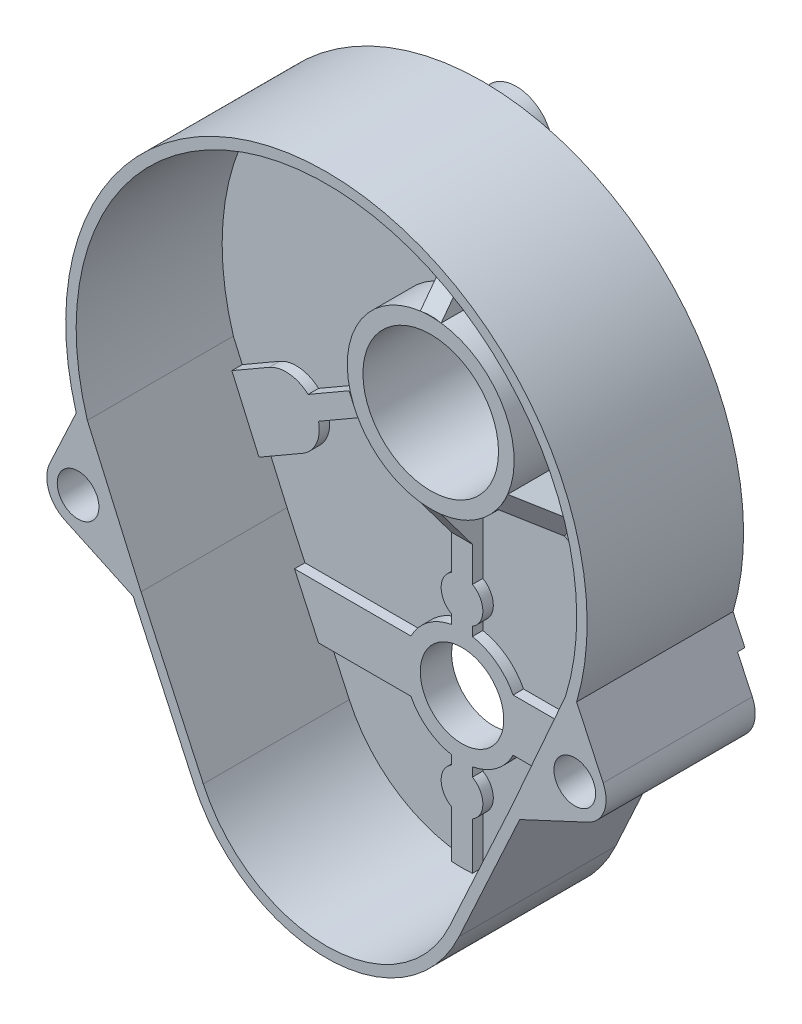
ISO-10303-21;
HEADER;
FILE_DESCRIPTION(('STEP AP214'),'2;1');
FILE_NAME('part.step','',(''),(''),'','','');
FILE_SCHEMA(('AUTOMOTIVE_DESIGN { 1 0 10303 214 1 1 1 1 }'));
ENDSEC;
DATA;
#1=APPLICATION_CONTEXT('core data for automotive mechanical design processes');
#2=APPLICATION_PROTOCOL_DEFINITION('international standard','automotive_design',2000,#1);
#3=PRODUCT_CONTEXT('',#1,'mechanical');
#4=PRODUCT('Part','Part','',(#3));
#5=PRODUCT_RELATED_PRODUCT_CATEGORY('part','',(#4));
#6=PRODUCT_DEFINITION_FORMATION('','',#4);
#7=PRODUCT_DEFINITION_CONTEXT('part definition',#1,'design');
#8=PRODUCT_DEFINITION('design','',#6,#7);
#9=PRODUCT_DEFINITION_SHAPE('','',#8);
#10=(LENGTH_UNIT() NAMED_UNIT(*) SI_UNIT(.MILLI.,.METRE.));
#11=(NAMED_UNIT(*) PLANE_ANGLE_UNIT() SI_UNIT($,.RADIAN.));
#12=(NAMED_UNIT(*) SI_UNIT($,.STERADIAN.) SOLID_ANGLE_UNIT());
#13=UNCERTAINTY_MEASURE_WITH_UNIT(LENGTH_MEASURE(1.E-05),#10,'distance_accuracy_value','');
#14=(GEOMETRIC_REPRESENTATION_CONTEXT(3) GLOBAL_UNCERTAINTY_ASSIGNED_CONTEXT((#13)) GLOBAL_UNIT_ASSIGNED_CONTEXT((#10,
#11,#12)) REPRESENTATION_CONTEXT('',''));
#15=CARTESIAN_POINT('',(0.,0.,0.));
#16=DIRECTION('',(0.,0.,1.));
#17=DIRECTION('',(1.,0.,0.));
#18=AXIS2_PLACEMENT_3D('',#15,#16,#17);
#19=CARTESIAN_POINT('',(0.,0.,5.));
#20=DIRECTION('',(0.,0.,-1.));
#21=DIRECTION('',(-1.,0.,0.));
#22=AXIS2_PLACEMENT_3D('',#19,#20,#21);
#23=CYLINDRICAL_SURFACE('',#22,8.);
#24=DIRECTION('',(0.,0.,-1.));
#25=VECTOR('',#24,1.);
#26=CARTESIAN_POINT('',(-0.999999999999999,-7.93725393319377,2.));
#27=LINE('',#26,#25);
#28=CARTESIAN_POINT('',(-0.999999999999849,-7.93725393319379,5.));
#29=VERTEX_POINT('',#28);
#30=CARTESIAN_POINT('',(-0.999999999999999,-7.93725393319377,1.));
#31=VERTEX_POINT('',#30);
#32=EDGE_CURVE('E52',#29,#31,#27,.T.);
#33=ORIENTED_EDGE('',*,*,#32,.F.);
#34=CARTESIAN_POINT('',(0.,0.,5.));
#35=DIRECTION('',(0.,0.,1.));
#36=DIRECTION('',(1.,0.,0.));
#37=AXIS2_PLACEMENT_3D('',#34,#35,#36);
#38=CIRCLE('',#37,8.);
#39=CARTESIAN_POINT('',(-6.3738635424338,-4.83465237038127,5.));
#40=VERTEX_POINT('',#39);
#41=EDGE_CURVE('E1249',#40,#29,#38,.T.);
#42=ORIENTED_EDGE('',*,*,#41,.F.);
#43=DIRECTION('',(0.,0.,-1.));
#44=VECTOR('',#43,1.);
#45=CARTESIAN_POINT('',(-6.3738635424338,-4.83465237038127,2.));
#46=LINE('',#45,#44);
#47=CARTESIAN_POINT('',(-6.3738635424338,-4.83465237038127,1.));
#48=VERTEX_POINT('',#47);
#49=EDGE_CURVE('E770',#40,#48,#46,.T.);
#50=ORIENTED_EDGE('',*,*,#49,.T.);
#51=CARTESIAN_POINT('',(0.,0.,1.));
#52=DIRECTION('',(0.,0.,1.));
#53=DIRECTION('',(1.,0.,0.));
#54=AXIS2_PLACEMENT_3D('',#51,#52,#53);
#55=CIRCLE('',#54,8.);
#56=EDGE_CURVE('E893',#48,#31,#55,.T.);
#57=ORIENTED_EDGE('',*,*,#56,.T.);
#58=EDGE_LOOP('',(#33,#42,#50,#57));
#59=FACE_BOUND('',#58,.T.);
#60=ADVANCED_FACE('F29',(#59),#23,.T.);
#61=CARTESIAN_POINT('',(0.,0.,10.9529404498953));
#62=DIRECTION('',(0.,0.6,-0.8));
#63=DIRECTION('',(0.,-0.8,-0.6));
#64=AXIS2_PLACEMENT_3D('',#61,#62,#63);
#65=ELLIPSE('',#64,10.,8.);
#66=CARTESIAN_POINT('',(1.00000000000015,-7.93725393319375,5.));
#67=VERTEX_POINT('',#66);
#68=EDGE_CURVE('E522',#67,#29,#65,.T.);
#69=ORIENTED_EDGE('',*,*,#68,.F.);
#70=EDGE_CURVE('E1252',#29,#67,#38,.T.);
#71=ORIENTED_EDGE('',*,*,#70,.F.);
#72=EDGE_LOOP('',(#69,#71));
#73=FACE_BOUND('',#72,.T.);
#74=ADVANCED_FACE('F1389',(#73),#23,.T.);
#75=CARTESIAN_POINT('',(0.,-25.,2.));
#76=DIRECTION('',(0.,0.,1.));
#77=DIRECTION('',(1.,0.,0.));
#78=AXIS2_PLACEMENT_3D('',#75,#76,#77);
#79=PLANE('',#78);
#80=CARTESIAN_POINT('',(0.,-25.,2.));
#81=DIRECTION('',(0.,0.,1.));
#82=DIRECTION('',(1.,0.,0.));
#83=AXIS2_PLACEMENT_3D('',#80,#81,#82);
#84=CIRCLE('',#83,4.);
#85=CARTESIAN_POINT('',(4.,-25.,2.));
#86=VERTEX_POINT('',#85);
#87=EDGE_CURVE('E567',#86,#86,#84,.T.);
#88=ORIENTED_EDGE('',*,*,#87,.F.);
#89=EDGE_LOOP('',(#88));
#90=FACE_BOUND('',#89,.T.);
#91=DIRECTION('',(0.,1.,0.));
#92=VECTOR('',#91,1.);
#93=CARTESIAN_POINT('',(1.,-7.93725393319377,2.));
#94=LINE('',#93,#92);
#95=CARTESIAN_POINT('',(1.,-15.2679491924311,2.));
#96=VERTEX_POINT('',#95);
#97=CARTESIAN_POINT('',(1.,-11.9372539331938,2.));
#98=VERTEX_POINT('',#97);
#99=EDGE_CURVE('E514',#96,#98,#94,.T.);
#100=ORIENTED_EDGE('',*,*,#99,.T.);
#101=DIRECTION('',(1.,0.,0.));
#102=VECTOR('',#101,1.);
#103=CARTESIAN_POINT('',(-0.999999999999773,-11.9372539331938,2.));
#104=LINE('',#103,#102);
#105=CARTESIAN_POINT('',(-0.999999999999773,-11.9372539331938,2.));
#106=VERTEX_POINT('',#105);
#107=EDGE_CURVE('E517',#106,#98,#104,.T.);
#108=ORIENTED_EDGE('',*,*,#107,.F.);
#109=DIRECTION('',(0.,-1.,0.));
#110=VECTOR('',#109,1.);
#111=CARTESIAN_POINT('',(-0.999999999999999,-7.93725393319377,2.));
#112=LINE('',#111,#110);
#113=CARTESIAN_POINT('',(-1.,-15.2679491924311,2.));
#114=VERTEX_POINT('',#113);
#115=EDGE_CURVE('E504',#106,#114,#112,.T.);
#116=ORIENTED_EDGE('',*,*,#115,.T.);
#117=CARTESIAN_POINT('',(0.,-17.,2.));
#118=DIRECTION('',(0.,0.,1.));
#119=DIRECTION('',(1.,0.,0.));
#120=AXIS2_PLACEMENT_3D('',#117,#118,#119);
#121=CIRCLE('',#120,2.);
#122=CARTESIAN_POINT('',(-0.999999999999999,-18.7320508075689,2.));
#123=VERTEX_POINT('',#122);
#124=EDGE_CURVE('E513',#114,#123,#121,.T.);
#125=ORIENTED_EDGE('',*,*,#124,.T.);
#126=DIRECTION('',(0.,-1.,0.));
#127=VECTOR('',#126,1.);
#128=CARTESIAN_POINT('',(-0.999999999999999,-18.7320508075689,2.));
#129=LINE('',#128,#127);
#130=CARTESIAN_POINT('',(-0.999999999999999,-19.591673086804,2.));
#131=VERTEX_POINT('',#130);
#132=EDGE_CURVE('E620',#123,#131,#129,.T.);
#133=ORIENTED_EDGE('',*,*,#132,.T.);
#134=CARTESIAN_POINT('',(0.,-25.,2.));
#135=DIRECTION('',(0.,0.,1.));
#136=DIRECTION('',(1.,0.,0.));
#137=AXIS2_PLACEMENT_3D('',#134,#135,#136);
#138=CIRCLE('',#137,5.5);
#139=CARTESIAN_POINT('',(-4.89897948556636,-22.5,2.));
#140=VERTEX_POINT('',#139);
#141=EDGE_CURVE('E622',#131,#140,#138,.T.);
#142=ORIENTED_EDGE('',*,*,#141,.T.);
#143=DIRECTION('',(-1.,0.,0.));
#144=VECTOR('',#143,1.);
#145=CARTESIAN_POINT('',(-16.0617058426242,-22.5,2.));
#146=LINE('',#145,#144);
#147=CARTESIAN_POINT('',(-16.0617058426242,-22.5,2.));
#148=VERTEX_POINT('',#147);
#149=EDGE_CURVE('E624',#140,#148,#146,.T.);
#150=ORIENTED_EDGE('',*,*,#149,.T.);
#151=DIRECTION('',(0.41825095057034,-0.908331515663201,0.));
#152=VECTOR('',#151,1.);
#153=CARTESIAN_POINT('',(-16.0617058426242,-22.5,2.));
#154=LINE('',#153,#152);
#155=CARTESIAN_POINT('',(-13.759402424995,-27.5,2.));
#156=VERTEX_POINT('',#155);
#157=EDGE_CURVE('E626',#148,#156,#154,.T.);
#158=ORIENTED_EDGE('',*,*,#157,.T.);
#159=DIRECTION('',(1.,0.,0.));
#160=VECTOR('',#159,1.);
#161=CARTESIAN_POINT('',(-13.759402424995,-27.5,2.));
#162=LINE('',#161,#160);
#163=CARTESIAN_POINT('',(-4.89897948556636,-27.5,2.));
#164=VERTEX_POINT('',#163);
#165=EDGE_CURVE('E629',#156,#164,#162,.T.);
#166=ORIENTED_EDGE('',*,*,#165,.T.);
#167=CARTESIAN_POINT('',(0.,-25.,2.));
#168=DIRECTION('',(0.,0.,1.));
#169=DIRECTION('',(1.,0.,0.));
#170=AXIS2_PLACEMENT_3D('',#167,#168,#169);
#171=CIRCLE('',#170,5.50000000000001);
#172=CARTESIAN_POINT('',(-0.999999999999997,-30.408326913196,2.));
#173=VERTEX_POINT('',#172);
#174=EDGE_CURVE('E631',#164,#173,#171,.T.);
#175=ORIENTED_EDGE('',*,*,#174,.T.);
#176=DIRECTION('',(0.,-1.,0.));
#177=VECTOR('',#176,1.);
#178=CARTESIAN_POINT('',(-0.999999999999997,-30.408326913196,2.));
#179=LINE('',#178,#177);
#180=CARTESIAN_POINT('',(-0.999999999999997,-31.2679491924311,2.));
#181=VERTEX_POINT('',#180);
#182=EDGE_CURVE('E633',#173,#181,#179,.T.);
#183=ORIENTED_EDGE('',*,*,#182,.T.);
#184=CARTESIAN_POINT('',(0.,-33.,2.));
#185=DIRECTION('',(0.,0.,1.));
#186=DIRECTION('',(1.,0.,0.));
#187=AXIS2_PLACEMENT_3D('',#184,#185,#186);
#188=CIRCLE('',#187,2.);
#189=CARTESIAN_POINT('',(-0.999999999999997,-34.7320508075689,2.));
#190=VERTEX_POINT('',#189);
#191=EDGE_CURVE('E635',#181,#190,#188,.T.);
#192=ORIENTED_EDGE('',*,*,#191,.T.);
#193=DIRECTION('',(0.,-1.,0.));
#194=VECTOR('',#193,1.);
#195=CARTESIAN_POINT('',(-0.999999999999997,-34.7320508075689,2.));
#196=LINE('',#195,#194);
#197=CARTESIAN_POINT('',(-1.,-39.2614813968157,2.));
#198=VERTEX_POINT('',#197);
#199=EDGE_CURVE('E637',#190,#198,#196,.T.);
#200=ORIENTED_EDGE('',*,*,#199,.T.);
#201=CARTESIAN_POINT('',(0.,-26.3,2.));
#202=DIRECTION('',(0.,0.,1.));
#203=DIRECTION('',(1.,0.,0.));
#204=AXIS2_PLACEMENT_3D('',#201,#202,#203);
#205=CIRCLE('',#204,13.);
#206=CARTESIAN_POINT('',(1.,-39.2614813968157,2.));
#207=VERTEX_POINT('',#206);
#208=EDGE_CURVE('E639',#198,#207,#205,.T.);
#209=ORIENTED_EDGE('',*,*,#208,.T.);
#210=DIRECTION('',(0.,1.,0.));
#211=VECTOR('',#210,1.);
#212=CARTESIAN_POINT('',(1.,-34.7320508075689,2.));
#213=LINE('',#212,#211);
#214=CARTESIAN_POINT('',(1.,-34.7320508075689,2.));
#215=VERTEX_POINT('',#214);
#216=EDGE_CURVE('E641',#207,#215,#213,.T.);
#217=ORIENTED_EDGE('',*,*,#216,.T.);
#218=CARTESIAN_POINT('',(0.,-33.,2.));
#219=DIRECTION('',(0.,0.,1.));
#220=DIRECTION('',(1.,0.,0.));
#221=AXIS2_PLACEMENT_3D('',#218,#219,#220);
#222=CIRCLE('',#221,2.);
#223=CARTESIAN_POINT('',(1.,-31.2679491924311,2.));
#224=VERTEX_POINT('',#223);
#225=EDGE_CURVE('E643',#215,#224,#222,.T.);
#226=ORIENTED_EDGE('',*,*,#225,.T.);
#227=DIRECTION('',(0.,1.,0.));
#228=VECTOR('',#227,1.);
#229=CARTESIAN_POINT('',(1.,-30.408326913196,2.));
#230=LINE('',#229,#228);
#231=CARTESIAN_POINT('',(1.,-30.408326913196,2.));
#232=VERTEX_POINT('',#231);
#233=EDGE_CURVE('E645',#224,#232,#230,.T.);
#234=ORIENTED_EDGE('',*,*,#233,.T.);
#235=CARTESIAN_POINT('',(0.,-25.,2.));
#236=DIRECTION('',(0.,0.,1.));
#237=DIRECTION('',(1.,0.,0.));
#238=AXIS2_PLACEMENT_3D('',#235,#236,#237);
#239=CIRCLE('',#238,5.5);
#240=CARTESIAN_POINT('',(4.89897948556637,-27.5,2.));
#241=VERTEX_POINT('',#240);
#242=EDGE_CURVE('E647',#232,#241,#239,.T.);
#243=ORIENTED_EDGE('',*,*,#242,.T.);
#244=DIRECTION('',(1.,0.,0.));
#245=VECTOR('',#244,1.);
#246=CARTESIAN_POINT('',(4.89897948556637,-27.5,2.));
#247=LINE('',#246,#245);
#248=CARTESIAN_POINT('',(13.759402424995,-27.5,2.));
#249=VERTEX_POINT('',#248);
#250=EDGE_CURVE('E649',#241,#249,#247,.T.);
#251=ORIENTED_EDGE('',*,*,#250,.T.);
#252=DIRECTION('',(0.41825095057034,0.9083315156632,0.));
#253=VECTOR('',#252,1.);
#254=CARTESIAN_POINT('',(13.759402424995,-27.5,2.));
#255=LINE('',#254,#253);
#256=CARTESIAN_POINT('',(16.0617058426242,-22.5,2.));
#257=VERTEX_POINT('',#256);
#258=EDGE_CURVE('E651',#249,#257,#255,.T.);
#259=ORIENTED_EDGE('',*,*,#258,.T.);
#260=DIRECTION('',(-1.,0.,0.));
#261=VECTOR('',#260,1.);
#262=CARTESIAN_POINT('',(4.89897948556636,-22.5,2.));
#263=LINE('',#262,#261);
#264=CARTESIAN_POINT('',(4.89897948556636,-22.5,2.));
#265=VERTEX_POINT('',#264);
#266=EDGE_CURVE('E653',#257,#265,#263,.T.);
#267=ORIENTED_EDGE('',*,*,#266,.T.);
#268=CARTESIAN_POINT('',(0.,-25.,2.));
#269=DIRECTION('',(0.,0.,1.));
#270=DIRECTION('',(1.,0.,0.));
#271=AXIS2_PLACEMENT_3D('',#268,#269,#270);
#272=CIRCLE('',#271,5.5);
#273=CARTESIAN_POINT('',(1.,-19.591673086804,2.));
#274=VERTEX_POINT('',#273);
#275=EDGE_CURVE('E611',#265,#274,#272,.T.);
#276=ORIENTED_EDGE('',*,*,#275,.T.);
#277=DIRECTION('',(0.,1.,0.));
#278=VECTOR('',#277,1.);
#279=CARTESIAN_POINT('',(1.,-18.7320508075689,2.));
#280=LINE('',#279,#278);
#281=CARTESIAN_POINT('',(1.,-18.7320508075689,2.));
#282=VERTEX_POINT('',#281);
#283=EDGE_CURVE('E614',#274,#282,#280,.T.);
#284=ORIENTED_EDGE('',*,*,#283,.T.);
#285=CARTESIAN_POINT('',(0.,-17.,2.));
#286=DIRECTION('',(0.,0.,1.));
#287=DIRECTION('',(1.,0.,0.));
#288=AXIS2_PLACEMENT_3D('',#285,#286,#287);
#289=CIRCLE('',#288,2.);
#290=EDGE_CURVE('E616',#282,#96,#289,.T.);
#291=ORIENTED_EDGE('',*,*,#290,.T.);
#292=EDGE_LOOP('',(#100,#108,#116,#125,#133,#142,#150,#158,#166,#175,#183,#192,#200,#209,#217,
#226,#234,#243,#251,#259,#267,#276,#284,#291));
#293=FACE_BOUND('',#292,.T.);
#294=ADVANCED_FACE('F518',(#90,#293),#79,.T.);
#295=DIRECTION('',(0.,0.,-1.));
#296=VECTOR('',#295,1.);
#297=CARTESIAN_POINT('',(-7.37386354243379,-3.10260156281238,2.));
#298=LINE('',#297,#296);
#299=CARTESIAN_POINT('',(-7.37386354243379,-3.10260156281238,5.));
#300=VERTEX_POINT('',#299);
#301=CARTESIAN_POINT('',(-7.37386354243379,-3.10260156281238,1.));
#302=VERTEX_POINT('',#301);
#303=EDGE_CURVE('E785',#300,#302,#298,.T.);
#304=ORIENTED_EDGE('',*,*,#303,.F.);
#305=CARTESIAN_POINT('',(-1.,7.93725393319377,5.));
#306=VERTEX_POINT('',#305);
#307=EDGE_CURVE('E899',#306,#300,#38,.T.);
#308=ORIENTED_EDGE('',*,*,#307,.F.);
#309=DIRECTION('',(0.,0.,-1.));
#310=VECTOR('',#309,1.);
#311=CARTESIAN_POINT('',(-0.999999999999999,7.93725393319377,2.));
#312=LINE('',#311,#310);
#313=CARTESIAN_POINT('',(-0.999999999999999,7.93725393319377,1.));
#314=VERTEX_POINT('',#313);
#315=EDGE_CURVE('E862',#306,#314,#312,.T.);
#316=ORIENTED_EDGE('',*,*,#315,.T.);
#317=EDGE_CURVE('E889',#314,#302,#55,.T.);
#318=ORIENTED_EDGE('',*,*,#317,.T.);
#319=EDGE_LOOP('',(#304,#308,#316,#318));
#320=FACE_BOUND('',#319,.T.);
#321=ADVANCED_FACE('F1224',(#320),#23,.T.);
#322=CARTESIAN_POINT('',(0.,0.,10.9529404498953));
#323=DIRECTION('',(0.519615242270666,0.299999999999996,-0.8));
#324=DIRECTION('',(-0.692820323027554,-0.399999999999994,-0.6));
#325=AXIS2_PLACEMENT_3D('',#322,#323,#324);
#326=ELLIPSE('',#325,10.,8.);
#327=EDGE_CURVE('E540',#40,#300,#326,.T.);
#328=ORIENTED_EDGE('',*,*,#327,.F.);
#329=EDGE_CURVE('E1247',#300,#40,#38,.T.);
#330=ORIENTED_EDGE('',*,*,#329,.F.);
#331=EDGE_LOOP('',(#328,#330));
#332=FACE_BOUND('',#331,.T.);
#333=ADVANCED_FACE('F1245',(#332),#23,.T.);
#334=CARTESIAN_POINT('',(0.,0.,2.));
#335=DIRECTION('',(0.,0.,1.));
#336=DIRECTION('',(-0.499999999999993,0.866025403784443,0.));
#337=AXIS2_PLACEMENT_3D('',#334,#335,#336);
#338=PLANE('',#337);
#339=DIRECTION('',(0.866025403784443,0.499999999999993,0.));
#340=VECTOR('',#339,1.);
#341=CARTESIAN_POINT('',(-13.755006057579,-9.09615698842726,2.));
#342=LINE('',#341,#340);
#343=CARTESIAN_POINT('',(-13.755006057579,-9.09615698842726,2.));
#344=VERTEX_POINT('',#343);
#345=CARTESIAN_POINT('',(-9.83796515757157,-6.83465237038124,2.));
#346=VERTEX_POINT('',#345);
#347=EDGE_CURVE('E768',#344,#346,#342,.T.);
#348=ORIENTED_EDGE('',*,*,#347,.T.);
#349=DIRECTION('',(0.499999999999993,-0.866025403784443,0.));
#350=VECTOR('',#349,1.);
#351=CARTESIAN_POINT('',(-10.8379651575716,-5.10260156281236,2.));
#352=LINE('',#351,#350);
#353=CARTESIAN_POINT('',(-10.8379651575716,-5.10260156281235,2.));
#354=VERTEX_POINT('',#353);
#355=EDGE_CURVE('E537',#354,#346,#352,.T.);
#356=ORIENTED_EDGE('',*,*,#355,.F.);
#357=DIRECTION('',(-0.866025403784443,-0.499999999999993,0.));
#358=VECTOR('',#357,1.);
#359=CARTESIAN_POINT('',(-14.755006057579,-7.36410618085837,2.));
#360=LINE('',#359,#358);
#361=CARTESIAN_POINT('',(-14.755006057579,-7.36410618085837,2.));
#362=VERTEX_POINT('',#361);
#363=EDGE_CURVE('E757',#354,#362,#360,.T.);
#364=ORIENTED_EDGE('',*,*,#363,.T.);
#365=CARTESIAN_POINT('',(-16.8874953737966,-9.74999999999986,2.));
#366=DIRECTION('',(0.,0.,1.));
#367=DIRECTION('',(-0.499999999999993,0.866025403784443,0.));
#368=AXIS2_PLACEMENT_3D('',#365,#366,#367);
#369=CIRCLE('',#368,3.2);
#370=CARTESIAN_POINT('',(-18.4874953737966,-6.97871870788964,2.));
#371=VERTEX_POINT('',#370);
#372=EDGE_CURVE('E759',#362,#371,#369,.T.);
#373=ORIENTED_EDGE('',*,*,#372,.T.);
#374=DIRECTION('',(-0.866025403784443,-0.499999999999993,0.));
#375=VECTOR('',#374,1.);
#376=CARTESIAN_POINT('',(-18.4874953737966,-6.97871870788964,2.));
#377=LINE('',#376,#375);
#378=CARTESIAN_POINT('',(-22.0681426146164,-9.04600635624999,2.));
#379=VERTEX_POINT('',#378);
#380=EDGE_CURVE('E761',#371,#379,#377,.T.);
#381=ORIENTED_EDGE('',*,*,#380,.T.);
#382=DIRECTION('',(0.403558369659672,-0.914953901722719,0.));
#383=VECTOR('',#382,1.);
#384=CARTESIAN_POINT('',(-21.8142620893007,-9.62160828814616,2.));
#385=LINE('',#384,#383);
#386=CARTESIAN_POINT('',(-19.4701774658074,-14.9361539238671,2.));
#387=VERTEX_POINT('',#386);
#388=EDGE_CURVE('E724',#379,#387,#385,.T.);
#389=ORIENTED_EDGE('',*,*,#388,.T.);
#390=DIRECTION('',(0.866025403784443,0.499999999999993,0.));
#391=VECTOR('',#390,1.);
#392=CARTESIAN_POINT('',(-15.2874953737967,-12.5212812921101,2.));
#393=LINE('',#392,#391);
#394=CARTESIAN_POINT('',(-15.2874953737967,-12.5212812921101,2.));
#395=VERTEX_POINT('',#394);
#396=EDGE_CURVE('E764',#387,#395,#393,.T.);
#397=ORIENTED_EDGE('',*,*,#396,.T.);
#398=CARTESIAN_POINT('',(-16.8874953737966,-9.74999999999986,2.));
#399=DIRECTION('',(0.,0.,1.));
#400=DIRECTION('',(-0.499999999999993,0.866025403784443,0.));
#401=AXIS2_PLACEMENT_3D('',#398,#399,#400);
#402=CIRCLE('',#401,3.2);
#403=EDGE_CURVE('E766',#395,#344,#402,.T.);
#404=ORIENTED_EDGE('',*,*,#403,.T.);
#405=EDGE_LOOP('',(#348,#356,#364,#373,#381,#389,#397,#404));
#406=FACE_BOUND('',#405,.T.);
#407=ADVANCED_FACE('F1237',(#406),#338,.T.);
#408=CARTESIAN_POINT('',(6.37386354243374,-4.83465237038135,5.));
#409=VERTEX_POINT('',#408);
#410=EDGE_CURVE('E900',#67,#409,#38,.T.);
#411=ORIENTED_EDGE('',*,*,#410,.F.);
#412=DIRECTION('',(0.,0.,-1.));
#413=VECTOR('',#412,1.);
#414=CARTESIAN_POINT('',(0.999999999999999,-7.93725393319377,2.));
#415=LINE('',#414,#413);
#416=CARTESIAN_POINT('',(0.999999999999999,-7.93725393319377,1.));
#417=VERTEX_POINT('',#416);
#418=EDGE_CURVE('E44',#67,#417,#415,.T.);
#419=ORIENTED_EDGE('',*,*,#418,.T.);
#420=CARTESIAN_POINT('',(6.37386354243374,-4.83465237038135,1.));
#421=VERTEX_POINT('',#420);
#422=EDGE_CURVE('E894',#417,#421,#55,.T.);
#423=ORIENTED_EDGE('',*,*,#422,.T.);
#424=DIRECTION('',(0.,0.,-1.));
#425=VECTOR('',#424,1.);
#426=CARTESIAN_POINT('',(6.37386354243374,-4.83465237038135,2.));
#427=LINE('',#426,#425);
#428=EDGE_CURVE('E831',#409,#421,#427,.T.);
#429=ORIENTED_EDGE('',*,*,#428,.F.);
#430=EDGE_LOOP('',(#411,#419,#423,#429));
#431=FACE_BOUND('',#430,.T.);
#432=ADVANCED_FACE('F1408',(#431),#23,.T.);
#433=CARTESIAN_POINT('',(0.,0.,10.9529404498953));
#434=DIRECTION('',(-0.519615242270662,0.300000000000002,-0.8));
#435=DIRECTION('',(0.692820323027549,-0.400000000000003,-0.6));
#436=AXIS2_PLACEMENT_3D('',#433,#434,#435);
#437=ELLIPSE('',#436,10.,8.);
#438=CARTESIAN_POINT('',(7.37386354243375,-3.10260156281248,5.));
#439=VERTEX_POINT('',#438);
#440=EDGE_CURVE('E552',#439,#409,#437,.T.);
#441=ORIENTED_EDGE('',*,*,#440,.F.);
#442=EDGE_CURVE('E1255',#409,#439,#38,.T.);
#443=ORIENTED_EDGE('',*,*,#442,.F.);
#444=EDGE_LOOP('',(#441,#443));
#445=FACE_BOUND('',#444,.T.);
#446=ADVANCED_FACE('F1402',(#445),#23,.T.);
#447=CARTESIAN_POINT('',(0.,0.,2.));
#448=DIRECTION('',(0.,0.,1.));
#449=DIRECTION('',(-0.500000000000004,-0.866025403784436,0.));
#450=AXIS2_PLACEMENT_3D('',#447,#448,#449);
#451=PLANE('',#450);
#452=DIRECTION('',(-0.866025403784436,0.500000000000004,0.));
#453=VECTOR('',#452,1.);
#454=CARTESIAN_POINT('',(14.7550060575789,-7.36410618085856,2.));
#455=LINE('',#454,#453);
#456=CARTESIAN_POINT('',(14.7550060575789,-7.36410618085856,2.));
#457=VERTEX_POINT('',#456);
#458=CARTESIAN_POINT('',(10.8379651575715,-5.10260156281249,2.));
#459=VERTEX_POINT('',#458);
#460=EDGE_CURVE('E814',#457,#459,#455,.T.);
#461=ORIENTED_EDGE('',*,*,#460,.T.);
#462=DIRECTION('',(0.500000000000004,0.866025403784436,0.));
#463=VECTOR('',#462,1.);
#464=CARTESIAN_POINT('',(9.83796515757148,-6.83465237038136,2.));
#465=LINE('',#464,#463);
#466=CARTESIAN_POINT('',(9.83796515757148,-6.83465237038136,2.));
#467=VERTEX_POINT('',#466);
#468=EDGE_CURVE('E549',#467,#459,#465,.T.);
#469=ORIENTED_EDGE('',*,*,#468,.F.);
#470=DIRECTION('',(0.866025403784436,-0.500000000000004,0.));
#471=VECTOR('',#470,1.);
#472=CARTESIAN_POINT('',(13.7550060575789,-9.09615698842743,2.));
#473=LINE('',#472,#471);
#474=CARTESIAN_POINT('',(13.7550060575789,-9.09615698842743,2.));
#475=VERTEX_POINT('',#474);
#476=EDGE_CURVE('E803',#467,#475,#473,.T.);
#477=ORIENTED_EDGE('',*,*,#476,.T.);
#478=CARTESIAN_POINT('',(16.8874953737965,-9.75000000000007,2.));
#479=DIRECTION('',(0.,0.,1.));
#480=DIRECTION('',(-0.500000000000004,-0.866025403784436,0.));
#481=AXIS2_PLACEMENT_3D('',#478,#479,#480);
#482=CIRCLE('',#481,3.2);
#483=CARTESIAN_POINT('',(15.2874953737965,-12.5212812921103,2.));
#484=VERTEX_POINT('',#483);
#485=EDGE_CURVE('E805',#475,#484,#482,.T.);
#486=ORIENTED_EDGE('',*,*,#485,.T.);
#487=DIRECTION('',(0.866025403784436,-0.500000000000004,0.));
#488=VECTOR('',#487,1.);
#489=CARTESIAN_POINT('',(15.2874953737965,-12.5212812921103,2.));
#490=LINE('',#489,#488);
#491=CARTESIAN_POINT('',(19.4701774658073,-14.9361539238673,2.));
#492=VERTEX_POINT('',#491);
#493=EDGE_CURVE('E807',#484,#492,#490,.T.);
#494=ORIENTED_EDGE('',*,*,#493,.T.);
#495=DIRECTION('',(-0.403558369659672,-0.91495390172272,0.));
#496=VECTOR('',#495,1.);
#497=CARTESIAN_POINT('',(22.9240566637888,-7.10546452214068,2.));
#498=LINE('',#497,#496);
#499=CARTESIAN_POINT('',(22.0681426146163,-9.04600635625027,2.));
#500=VERTEX_POINT('',#499);
#501=EDGE_CURVE('E733',#500,#492,#498,.T.);
#502=ORIENTED_EDGE('',*,*,#501,.F.);
#503=DIRECTION('',(-0.866025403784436,0.500000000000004,0.));
#504=VECTOR('',#503,1.);
#505=CARTESIAN_POINT('',(18.4874953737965,-6.97871870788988,2.));
#506=LINE('',#505,#504);
#507=CARTESIAN_POINT('',(18.4874953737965,-6.97871870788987,2.));
#508=VERTEX_POINT('',#507);
#509=EDGE_CURVE('E810',#500,#508,#506,.T.);
#510=ORIENTED_EDGE('',*,*,#509,.T.);
#511=CARTESIAN_POINT('',(16.8874953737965,-9.75000000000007,2.));
#512=DIRECTION('',(0.,0.,1.));
#513=DIRECTION('',(-0.500000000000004,-0.866025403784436,0.));
#514=AXIS2_PLACEMENT_3D('',#511,#512,#513);
#515=CIRCLE('',#514,3.2);
#516=EDGE_CURVE('E812',#508,#457,#515,.T.);
#517=ORIENTED_EDGE('',*,*,#516,.T.);
#518=EDGE_LOOP('',(#461,#469,#477,#486,#494,#502,#510,#517));
#519=FACE_BOUND('',#518,.T.);
#520=ADVANCED_FACE('F1397',(#519),#451,.T.);
#521=CARTESIAN_POINT('',(1.,7.93725393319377,5.));
#522=VERTEX_POINT('',#521);
#523=EDGE_CURVE('E892',#439,#522,#38,.T.);
#524=ORIENTED_EDGE('',*,*,#523,.F.);
#525=DIRECTION('',(0.,0.,-1.));
#526=VECTOR('',#525,1.);
#527=CARTESIAN_POINT('',(7.37386354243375,-3.10260156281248,2.));
#528=LINE('',#527,#526);
#529=CARTESIAN_POINT('',(7.37386354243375,-3.10260156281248,1.));
#530=VERTEX_POINT('',#529);
#531=EDGE_CURVE('E816',#439,#530,#528,.T.);
#532=ORIENTED_EDGE('',*,*,#531,.T.);
#533=CARTESIAN_POINT('',(1.,7.93725393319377,1.));
#534=VERTEX_POINT('',#533);
#535=EDGE_CURVE('E888',#530,#534,#55,.T.);
#536=ORIENTED_EDGE('',*,*,#535,.T.);
#537=DIRECTION('',(0.,0.,-1.));
#538=VECTOR('',#537,1.);
#539=CARTESIAN_POINT('',(1.,7.93725393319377,2.));
#540=LINE('',#539,#538);
#541=EDGE_CURVE('E877',#522,#534,#540,.T.);
#542=ORIENTED_EDGE('',*,*,#541,.F.);
#543=EDGE_LOOP('',(#524,#532,#536,#542));
#544=FACE_BOUND('',#543,.T.);
#545=ADVANCED_FACE('F1210',(#544),#23,.T.);
#546=CARTESIAN_POINT('',(0.,0.,10.9529404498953));
#547=DIRECTION('',(0.,-0.6,-0.8));
#548=DIRECTION('',(0.,0.8,-0.6));
#549=AXIS2_PLACEMENT_3D('',#546,#547,#548);
#550=ELLIPSE('',#549,10.,8.);
#551=EDGE_CURVE('E564',#306,#522,#550,.T.);
#552=ORIENTED_EDGE('',*,*,#551,.F.);
#553=EDGE_CURVE('E895',#522,#306,#38,.T.);
#554=ORIENTED_EDGE('',*,*,#553,.F.);
#555=EDGE_LOOP('',(#552,#554));
#556=FACE_BOUND('',#555,.T.);
#557=ADVANCED_FACE('F1214',(#556),#23,.T.);
#558=CARTESIAN_POINT('',(0.,0.,2.));
#559=DIRECTION('',(0.,0.,1.));
#560=DIRECTION('',(1.,0.,0.));
#561=AXIS2_PLACEMENT_3D('',#558,#559,#560);
#562=PLANE('',#561);
#563=DIRECTION('',(0.,-1.,0.));
#564=VECTOR('',#563,1.);
#565=CARTESIAN_POINT('',(-1.,16.4602631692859,2.));
#566=LINE('',#565,#564);
#567=CARTESIAN_POINT('',(-1.,16.4602631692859,2.));
#568=VERTEX_POINT('',#567);
#569=CARTESIAN_POINT('',(-1.,11.9372539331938,2.));
#570=VERTEX_POINT('',#569);
#571=EDGE_CURVE('E860',#568,#570,#566,.T.);
#572=ORIENTED_EDGE('',*,*,#571,.T.);
#573=DIRECTION('',(-1.,0.,0.));
#574=VECTOR('',#573,1.);
#575=CARTESIAN_POINT('',(1.,11.9372539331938,2.));
#576=LINE('',#575,#574);
#577=CARTESIAN_POINT('',(1.,11.9372539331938,2.));
#578=VERTEX_POINT('',#577);
#579=EDGE_CURVE('E561',#578,#570,#576,.T.);
#580=ORIENTED_EDGE('',*,*,#579,.F.);
#581=DIRECTION('',(0.,1.,0.));
#582=VECTOR('',#581,1.);
#583=CARTESIAN_POINT('',(1.,16.4602631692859,2.));
#584=LINE('',#583,#582);
#585=CARTESIAN_POINT('',(0.999999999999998,16.4602631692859,2.));
#586=VERTEX_POINT('',#585);
#587=EDGE_CURVE('E849',#578,#586,#584,.T.);
#588=ORIENTED_EDGE('',*,*,#587,.T.);
#589=CARTESIAN_POINT('',(0.,19.5,2.));
#590=DIRECTION('',(0.,0.,1.));
#591=DIRECTION('',(1.,0.,0.));
#592=AXIS2_PLACEMENT_3D('',#589,#590,#591);
#593=CIRCLE('',#592,3.2);
#594=CARTESIAN_POINT('',(3.2,19.5,2.));
#595=VERTEX_POINT('',#594);
#596=EDGE_CURVE('E851',#586,#595,#593,.T.);
#597=ORIENTED_EDGE('',*,*,#596,.T.);
#598=DIRECTION('',(0.,1.,0.));
#599=VECTOR('',#598,1.);
#600=CARTESIAN_POINT('',(3.2,19.5,2.));
#601=LINE('',#600,#599);
#602=CARTESIAN_POINT('',(3.2,23.7857099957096,2.));
#603=VERTEX_POINT('',#602);
#604=EDGE_CURVE('E853',#595,#603,#601,.T.);
#605=ORIENTED_EDGE('',*,*,#604,.T.);
#606=CARTESIAN_POINT('',(0.,0.,2.));
#607=DIRECTION('',(0.,0.,1.));
#608=DIRECTION('',(1.,0.,0.));
#609=AXIS2_PLACEMENT_3D('',#606,#607,#608);
#610=CIRCLE('',#609,24.);
#611=CARTESIAN_POINT('',(-3.2,23.7857099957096,2.));
#612=VERTEX_POINT('',#611);
#613=EDGE_CURVE('E883',#603,#612,#610,.T.);
#614=ORIENTED_EDGE('',*,*,#613,.T.);
#615=DIRECTION('',(0.,-1.,0.));
#616=VECTOR('',#615,1.);
#617=CARTESIAN_POINT('',(-3.2,19.5,2.));
#618=LINE('',#617,#616);
#619=CARTESIAN_POINT('',(-3.2,19.5,2.));
#620=VERTEX_POINT('',#619);
#621=EDGE_CURVE('E856',#612,#620,#618,.T.);
#622=ORIENTED_EDGE('',*,*,#621,.T.);
#623=CARTESIAN_POINT('',(0.,19.5,2.));
#624=DIRECTION('',(0.,0.,1.));
#625=DIRECTION('',(1.,0.,0.));
#626=AXIS2_PLACEMENT_3D('',#623,#624,#625);
#627=CIRCLE('',#626,3.2);
#628=EDGE_CURVE('E858',#620,#568,#627,.T.);
#629=ORIENTED_EDGE('',*,*,#628,.T.);
#630=EDGE_LOOP('',(#572,#580,#588,#597,#605,#614,#622,#629));
#631=FACE_BOUND('',#630,.T.);
#632=ADVANCED_FACE('F1191',(#631),#562,.T.);
#633=CARTESIAN_POINT('',(0.,-26.3,1.));
#634=DIRECTION('',(0.,0.,1.));
#635=DIRECTION('',(1.,0.,0.));
#636=AXIS2_PLACEMENT_3D('',#633,#634,#635);
#637=PLANE('',#636);
#638=CARTESIAN_POINT('',(0.,-17.,1.));
#639=DIRECTION('',(0.,0.,1.));
#640=DIRECTION('',(1.,0.,0.));
#641=AXIS2_PLACEMENT_3D('',#638,#639,#640);
#642=CIRCLE('',#641,2.);
#643=CARTESIAN_POINT('',(-1.,-15.2679491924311,1.));
#644=VERTEX_POINT('',#643);
#645=CARTESIAN_POINT('',(-0.999999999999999,-18.7320508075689,1.));
#646=VERTEX_POINT('',#645);
#647=EDGE_CURVE('E581',#644,#646,#642,.T.);
#648=ORIENTED_EDGE('',*,*,#647,.F.);
#649=DIRECTION('',(0.,-1.,0.));
#650=VECTOR('',#649,1.);
#651=CARTESIAN_POINT('',(-0.999999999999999,-7.93725393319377,1.));
#652=LINE('',#651,#650);
#653=EDGE_CURVE('E579',#31,#644,#652,.T.);
#654=ORIENTED_EDGE('',*,*,#653,.F.);
#655=ORIENTED_EDGE('',*,*,#56,.F.);
#656=DIRECTION('',(0.866025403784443,0.499999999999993,0.));
#657=VECTOR('',#656,1.);
#658=CARTESIAN_POINT('',(-13.755006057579,-9.09615698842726,1.));
#659=LINE('',#658,#657);
#660=CARTESIAN_POINT('',(-13.755006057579,-9.09615698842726,1.));
#661=VERTEX_POINT('',#660);
#662=EDGE_CURVE('E755',#661,#48,#659,.T.);
#663=ORIENTED_EDGE('',*,*,#662,.F.);
#664=CARTESIAN_POINT('',(-16.8874953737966,-9.74999999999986,1.));
#665=DIRECTION('',(0.,0.,1.));
#666=DIRECTION('',(-0.499999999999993,0.866025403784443,0.));
#667=AXIS2_PLACEMENT_3D('',#664,#665,#666);
#668=CIRCLE('',#667,3.2);
#669=CARTESIAN_POINT('',(-15.2874953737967,-12.5212812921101,1.));
#670=VERTEX_POINT('',#669);
#671=EDGE_CURVE('E753',#670,#661,#668,.T.);
#672=ORIENTED_EDGE('',*,*,#671,.F.);
#673=DIRECTION('',(0.866025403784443,0.499999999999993,0.));
#674=VECTOR('',#673,1.);
#675=CARTESIAN_POINT('',(-15.2874953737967,-12.5212812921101,1.));
#676=LINE('',#675,#674);
#677=CARTESIAN_POINT('',(-19.4701774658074,-14.9361539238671,1.));
#678=VERTEX_POINT('',#677);
#679=EDGE_CURVE('E751',#678,#670,#676,.T.);
#680=ORIENTED_EDGE('',*,*,#679,.F.);
#681=DIRECTION('',(-0.403558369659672,0.914953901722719,0.));
#682=VECTOR('',#681,1.);
#683=CARTESIAN_POINT('',(-22.9240566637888,-7.10546452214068,1.));
#684=LINE('',#683,#682);
#685=CARTESIAN_POINT('',(-17.7782800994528,-18.7720503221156,1.));
#686=VERTEX_POINT('',#685);
#687=EDGE_CURVE('E718',#686,#678,#684,.T.);
#688=ORIENTED_EDGE('',*,*,#687,.F.);
#689=DIRECTION('',(0.41825095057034,-0.9083315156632,0.));
#690=VECTOR('',#689,1.);
#691=CARTESIAN_POINT('',(-17.6249082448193,-19.1051338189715,1.));
#692=LINE('',#691,#690);
#693=CARTESIAN_POINT('',(-16.0617058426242,-22.5,1.));
#694=VERTEX_POINT('',#693);
#695=EDGE_CURVE('E1009',#686,#694,#692,.T.);
#696=ORIENTED_EDGE('',*,*,#695,.T.);
#697=DIRECTION('',(-1.,0.,0.));
#698=VECTOR('',#697,1.);
#699=CARTESIAN_POINT('',(-16.0617058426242,-22.5,1.));
#700=LINE('',#699,#698);
#701=CARTESIAN_POINT('',(-4.89897948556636,-22.5,1.));
#702=VERTEX_POINT('',#701);
#703=EDGE_CURVE('E587',#702,#694,#700,.T.);
#704=ORIENTED_EDGE('',*,*,#703,.F.);
#705=CARTESIAN_POINT('',(0.,-25.,1.));
#706=DIRECTION('',(0.,0.,1.));
#707=DIRECTION('',(1.,0.,0.));
#708=AXIS2_PLACEMENT_3D('',#705,#706,#707);
#709=CIRCLE('',#708,5.5);
#710=CARTESIAN_POINT('',(-0.999999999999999,-19.591673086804,1.));
#711=VERTEX_POINT('',#710);
#712=EDGE_CURVE('E585',#711,#702,#709,.T.);
#713=ORIENTED_EDGE('',*,*,#712,.F.);
#714=DIRECTION('',(0.,-1.,0.));
#715=VECTOR('',#714,1.);
#716=CARTESIAN_POINT('',(-0.999999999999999,-18.7320508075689,1.));
#717=LINE('',#716,#715);
#718=EDGE_CURVE('E583',#646,#711,#717,.T.);
#719=ORIENTED_EDGE('',*,*,#718,.F.);
#720=EDGE_LOOP('',(#648,#654,#655,#663,#672,#680,#688,#696,#704,#713,#719));
#721=FACE_BOUND('',#720,.T.);
#722=ADVANCED_FACE('F1277',(#721),#637,.T.);
#723=CARTESIAN_POINT('',(0.,-25.,1.));
#724=DIRECTION('',(0.,0.,1.));
#725=DIRECTION('',(1.,0.,0.));
#726=AXIS2_PLACEMENT_3D('',#723,#724,#725);
#727=CIRCLE('',#726,5.50000000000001);
#728=CARTESIAN_POINT('',(-4.89897948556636,-27.5,1.));
#729=VERTEX_POINT('',#728);
#730=CARTESIAN_POINT('',(-0.999999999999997,-30.408326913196,1.));
#731=VERTEX_POINT('',#730);
#732=EDGE_CURVE('E591',#729,#731,#727,.T.);
#733=ORIENTED_EDGE('',*,*,#732,.F.);
#734=DIRECTION('',(1.,0.,0.));
#735=VECTOR('',#734,1.);
#736=CARTESIAN_POINT('',(-13.759402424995,-27.5,1.));
#737=LINE('',#736,#735);
#738=CARTESIAN_POINT('',(-13.759402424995,-27.5,1.));
#739=VERTEX_POINT('',#738);
#740=EDGE_CURVE('E589',#739,#729,#737,.T.);
#741=ORIENTED_EDGE('',*,*,#740,.F.);
#742=CARTESIAN_POINT('',(-11.8083097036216,-31.7372623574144,1.));
#743=VERTEX_POINT('',#742);
#744=EDGE_CURVE('E1013',#739,#743,#692,.T.);
#745=ORIENTED_EDGE('',*,*,#744,.T.);
#746=CARTESIAN_POINT('',(0.,-26.3,1.));
#747=DIRECTION('',(0.,0.,1.));
#748=DIRECTION('',(1.,0.,0.));
#749=AXIS2_PLACEMENT_3D('',#746,#747,#748);
#750=CIRCLE('',#749,13.);
#751=CARTESIAN_POINT('',(-1.,-39.2614813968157,1.));
#752=VERTEX_POINT('',#751);
#753=EDGE_CURVE('E1005',#743,#752,#750,.T.);
#754=ORIENTED_EDGE('',*,*,#753,.T.);
#755=DIRECTION('',(0.,-1.,0.));
#756=VECTOR('',#755,1.);
#757=CARTESIAN_POINT('',(-0.999999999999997,-34.7320508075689,1.));
#758=LINE('',#757,#756);
#759=CARTESIAN_POINT('',(-0.999999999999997,-34.7320508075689,1.));
#760=VERTEX_POINT('',#759);
#761=EDGE_CURVE('E597',#760,#752,#758,.T.);
#762=ORIENTED_EDGE('',*,*,#761,.F.);
#763=CARTESIAN_POINT('',(0.,-33.,1.));
#764=DIRECTION('',(0.,0.,1.));
#765=DIRECTION('',(1.,0.,0.));
#766=AXIS2_PLACEMENT_3D('',#763,#764,#765);
#767=CIRCLE('',#766,2.);
#768=CARTESIAN_POINT('',(-0.999999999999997,-31.2679491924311,1.));
#769=VERTEX_POINT('',#768);
#770=EDGE_CURVE('E595',#769,#760,#767,.T.);
#771=ORIENTED_EDGE('',*,*,#770,.F.);
#772=DIRECTION('',(0.,-1.,0.));
#773=VECTOR('',#772,1.);
#774=CARTESIAN_POINT('',(-0.999999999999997,-30.408326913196,1.));
#775=LINE('',#774,#773);
#776=EDGE_CURVE('E593',#731,#769,#775,.T.);
#777=ORIENTED_EDGE('',*,*,#776,.F.);
#778=EDGE_LOOP('',(#733,#741,#745,#754,#762,#771,#777));
#779=FACE_BOUND('',#778,.T.);
#780=ADVANCED_FACE('F1308',(#779),#637,.T.);
#781=CARTESIAN_POINT('',(0.,-33.,1.));
#782=DIRECTION('',(0.,0.,1.));
#783=DIRECTION('',(1.,0.,0.));
#784=AXIS2_PLACEMENT_3D('',#781,#782,#783);
#785=CIRCLE('',#784,2.);
#786=CARTESIAN_POINT('',(1.,-34.7320508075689,1.));
#787=VERTEX_POINT('',#786);
#788=CARTESIAN_POINT('',(1.,-31.2679491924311,1.));
#789=VERTEX_POINT('',#788);
#790=EDGE_CURVE('E601',#787,#789,#785,.T.);
#791=ORIENTED_EDGE('',*,*,#790,.F.);
#792=DIRECTION('',(0.,1.,0.));
#793=VECTOR('',#792,1.);
#794=CARTESIAN_POINT('',(1.,-34.7320508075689,1.));
#795=LINE('',#794,#793);
#796=CARTESIAN_POINT('',(1.,-39.2614813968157,1.));
#797=VERTEX_POINT('',#796);
#798=EDGE_CURVE('E599',#797,#787,#795,.T.);
#799=ORIENTED_EDGE('',*,*,#798,.F.);
#800=CARTESIAN_POINT('',(11.8083097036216,-31.7372623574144,1.));
#801=VERTEX_POINT('',#800);
#802=EDGE_CURVE('E1004',#797,#801,#750,.T.);
#803=ORIENTED_EDGE('',*,*,#802,.T.);
#804=DIRECTION('',(0.41825095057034,0.908331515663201,0.));
#805=VECTOR('',#804,1.);
#806=CARTESIAN_POINT('',(17.6249082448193,-19.1051338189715,1.));
#807=LINE('',#806,#805);
#808=CARTESIAN_POINT('',(13.759402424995,-27.5,1.));
#809=VERTEX_POINT('',#808);
#810=EDGE_CURVE('E1018',#801,#809,#807,.T.);
#811=ORIENTED_EDGE('',*,*,#810,.T.);
#812=DIRECTION('',(1.,0.,0.));
#813=VECTOR('',#812,1.);
#814=CARTESIAN_POINT('',(4.89897948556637,-27.5,1.));
#815=LINE('',#814,#813);
#816=CARTESIAN_POINT('',(4.89897948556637,-27.5,1.));
#817=VERTEX_POINT('',#816);
#818=EDGE_CURVE('E607',#817,#809,#815,.T.);
#819=ORIENTED_EDGE('',*,*,#818,.F.);
#820=CARTESIAN_POINT('',(0.,-25.,1.));
#821=DIRECTION('',(0.,0.,1.));
#822=DIRECTION('',(1.,0.,0.));
#823=AXIS2_PLACEMENT_3D('',#820,#821,#822);
#824=CIRCLE('',#823,5.5);
#825=CARTESIAN_POINT('',(1.,-30.408326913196,1.));
#826=VERTEX_POINT('',#825);
#827=EDGE_CURVE('E605',#826,#817,#824,.T.);
#828=ORIENTED_EDGE('',*,*,#827,.F.);
#829=DIRECTION('',(0.,1.,0.));
#830=VECTOR('',#829,1.);
#831=CARTESIAN_POINT('',(1.,-30.408326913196,1.));
#832=LINE('',#831,#830);
#833=EDGE_CURVE('E603',#789,#826,#832,.T.);
#834=ORIENTED_EDGE('',*,*,#833,.F.);
#835=EDGE_LOOP('',(#791,#799,#803,#811,#819,#828,#834));
#836=FACE_BOUND('',#835,.T.);
#837=ADVANCED_FACE('F1796',(#836),#637,.T.);
#838=ORIENTED_EDGE('',*,*,#422,.F.);
#839=DIRECTION('',(0.,1.,0.));
#840=VECTOR('',#839,1.);
#841=CARTESIAN_POINT('',(1.,-7.93725393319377,1.));
#842=LINE('',#841,#840);
#843=CARTESIAN_POINT('',(1.,-15.2679491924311,1.));
#844=VERTEX_POINT('',#843);
#845=EDGE_CURVE('E577',#844,#417,#842,.T.);
#846=ORIENTED_EDGE('',*,*,#845,.F.);
#847=CARTESIAN_POINT('',(0.,-17.,1.));
#848=DIRECTION('',(0.,0.,1.));
#849=DIRECTION('',(1.,0.,0.));
#850=AXIS2_PLACEMENT_3D('',#847,#848,#849);
#851=CIRCLE('',#850,2.);
#852=CARTESIAN_POINT('',(1.,-18.7320508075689,1.));
#853=VERTEX_POINT('',#852);
#854=EDGE_CURVE('E575',#853,#844,#851,.T.);
#855=ORIENTED_EDGE('',*,*,#854,.F.);
#856=DIRECTION('',(0.,1.,0.));
#857=VECTOR('',#856,1.);
#858=CARTESIAN_POINT('',(1.,-18.7320508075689,1.));
#859=LINE('',#858,#857);
#860=CARTESIAN_POINT('',(1.,-19.591673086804,1.));
#861=VERTEX_POINT('',#860);
#862=EDGE_CURVE('E573',#861,#853,#859,.T.);
#863=ORIENTED_EDGE('',*,*,#862,.F.);
#864=CARTESIAN_POINT('',(0.,-25.,1.));
#865=DIRECTION('',(0.,0.,1.));
#866=DIRECTION('',(1.,0.,0.));
#867=AXIS2_PLACEMENT_3D('',#864,#865,#866);
#868=CIRCLE('',#867,5.5);
#869=CARTESIAN_POINT('',(4.89897948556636,-22.5,1.));
#870=VERTEX_POINT('',#869);
#871=EDGE_CURVE('E570',#870,#861,#868,.T.);
#872=ORIENTED_EDGE('',*,*,#871,.F.);
#873=DIRECTION('',(-1.,0.,0.));
#874=VECTOR('',#873,1.);
#875=CARTESIAN_POINT('',(4.89897948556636,-22.5,1.));
#876=LINE('',#875,#874);
#877=CARTESIAN_POINT('',(16.0617058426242,-22.5,1.));
#878=VERTEX_POINT('',#877);
#879=EDGE_CURVE('E609',#878,#870,#876,.T.);
#880=ORIENTED_EDGE('',*,*,#879,.F.);
#881=CARTESIAN_POINT('',(17.7782800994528,-18.7720503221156,1.));
#882=VERTEX_POINT('',#881);
#883=EDGE_CURVE('E1008',#878,#882,#807,.T.);
#884=ORIENTED_EDGE('',*,*,#883,.T.);
#885=DIRECTION('',(-0.403558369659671,-0.91495390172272,0.));
#886=VECTOR('',#885,1.);
#887=CARTESIAN_POINT('',(22.9240566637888,-7.10546452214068,1.));
#888=LINE('',#887,#886);
#889=CARTESIAN_POINT('',(19.4701774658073,-14.9361539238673,1.));
#890=VERTEX_POINT('',#889);
#891=EDGE_CURVE('E734',#890,#882,#888,.T.);
#892=ORIENTED_EDGE('',*,*,#891,.F.);
#893=DIRECTION('',(0.866025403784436,-0.500000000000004,0.));
#894=VECTOR('',#893,1.);
#895=CARTESIAN_POINT('',(15.2874953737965,-12.5212812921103,1.));
#896=LINE('',#895,#894);
#897=CARTESIAN_POINT('',(15.2874953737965,-12.5212812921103,1.));
#898=VERTEX_POINT('',#897);
#899=EDGE_CURVE('E794',#898,#890,#896,.T.);
#900=ORIENTED_EDGE('',*,*,#899,.F.);
#901=CARTESIAN_POINT('',(16.8874953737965,-9.75000000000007,1.));
#902=DIRECTION('',(0.,0.,1.));
#903=DIRECTION('',(-0.500000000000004,-0.866025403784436,0.));
#904=AXIS2_PLACEMENT_3D('',#901,#902,#903);
#905=CIRCLE('',#904,3.2);
#906=CARTESIAN_POINT('',(13.7550060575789,-9.09615698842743,1.));
#907=VERTEX_POINT('',#906);
#908=EDGE_CURVE('E792',#907,#898,#905,.T.);
#909=ORIENTED_EDGE('',*,*,#908,.F.);
#910=DIRECTION('',(0.866025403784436,-0.500000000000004,0.));
#911=VECTOR('',#910,1.);
#912=CARTESIAN_POINT('',(13.7550060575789,-9.09615698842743,1.));
#913=LINE('',#912,#911);
#914=EDGE_CURVE('E790',#421,#907,#913,.T.);
#915=ORIENTED_EDGE('',*,*,#914,.F.);
#916=EDGE_LOOP('',(#838,#846,#855,#863,#872,#880,#884,#892,#900,#909,#915));
#917=FACE_BOUND('',#916,.T.);
#918=ADVANCED_FACE('F1268',(#917),#637,.T.);
#919=CARTESIAN_POINT('',(0.,-26.3,15.));
#920=DIRECTION('',(0.,0.,-1.));
#921=DIRECTION('',(-1.,0.,0.));
#922=AXIS2_PLACEMENT_3D('',#919,#920,#921);
#923=CYLINDRICAL_SURFACE('',#922,13.);
#924=ORIENTED_EDGE('',*,*,#208,.F.);
#925=DIRECTION('',(0.,0.,-1.));
#926=VECTOR('',#925,1.);
#927=CARTESIAN_POINT('',(-1.,-39.2614813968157,2.));
#928=LINE('',#927,#926);
#929=EDGE_CURVE('E677',#198,#752,#928,.T.);
#930=ORIENTED_EDGE('',*,*,#929,.T.);
#931=ORIENTED_EDGE('',*,*,#753,.F.);
#932=DIRECTION('',(0.,0.,-1.));
#933=VECTOR('',#932,1.);
#934=CARTESIAN_POINT('',(-11.8083097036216,-31.7372623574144,15.));
#935=LINE('',#934,#933);
#936=CARTESIAN_POINT('',(-11.8083097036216,-31.7372623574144,15.));
#937=VERTEX_POINT('',#936);
#938=EDGE_CURVE('E1026',#937,#743,#935,.T.);
#939=ORIENTED_EDGE('',*,*,#938,.F.);
#940=CARTESIAN_POINT('',(0.,-26.3,15.));
#941=DIRECTION('',(0.,0.,1.));
#942=DIRECTION('',(1.,0.,0.));
#943=AXIS2_PLACEMENT_3D('',#940,#941,#942);
#944=CIRCLE('',#943,13.);
#945=CARTESIAN_POINT('',(11.8083097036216,-31.7372623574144,15.));
#946=VERTEX_POINT('',#945);
#947=EDGE_CURVE('E1012',#937,#946,#944,.T.);
#948=ORIENTED_EDGE('',*,*,#947,.T.);
#949=DIRECTION('',(0.,0.,1.));
#950=VECTOR('',#949,1.);
#951=CARTESIAN_POINT('',(11.8083097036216,-31.7372623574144,15.));
#952=LINE('',#951,#950);
#953=EDGE_CURVE('E1021',#946,#801,#952,.F.);
#954=ORIENTED_EDGE('',*,*,#953,.T.);
#955=ORIENTED_EDGE('',*,*,#802,.F.);
#956=DIRECTION('',(0.,0.,-1.));
#957=VECTOR('',#956,1.);
#958=CARTESIAN_POINT('',(1.,-39.2614813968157,2.));
#959=LINE('',#958,#957);
#960=EDGE_CURVE('E675',#207,#797,#959,.T.);
#961=ORIENTED_EDGE('',*,*,#960,.F.);
#962=EDGE_LOOP('',(#924,#930,#931,#939,#948,#954,#955,#961));
#963=FACE_BOUND('',#962,.T.);
#964=ADVANCED_FACE('F1332',(#963),#923,.F.);
#965=CARTESIAN_POINT('',(17.6249082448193,-19.1051338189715,15.));
#966=DIRECTION('',(-0.908331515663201,0.41825095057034,0.));
#967=DIRECTION('',(-0.41825095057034,-0.908331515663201,0.));
#968=AXIS2_PLACEMENT_3D('',#965,#966,#967);
#969=PLANE('',#968);
#970=ORIENTED_EDGE('',*,*,#258,.F.);
#971=DIRECTION('',(0.,0.,-1.));
#972=VECTOR('',#971,1.);
#973=CARTESIAN_POINT('',(13.759402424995,-27.5,2.));
#974=LINE('',#973,#972);
#975=EDGE_CURVE('E660',#249,#809,#974,.T.);
#976=ORIENTED_EDGE('',*,*,#975,.T.);
#977=ORIENTED_EDGE('',*,*,#810,.F.);
#978=ORIENTED_EDGE('',*,*,#953,.F.);
#979=DIRECTION('',(0.41825095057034,0.908331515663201,0.));
#980=VECTOR('',#979,1.);
#981=CARTESIAN_POINT('',(17.6249082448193,-19.1051338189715,15.));
#982=LINE('',#981,#980);
#983=CARTESIAN_POINT('',(17.7782800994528,-18.7720503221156,15.));
#984=VERTEX_POINT('',#983);
#985=EDGE_CURVE('E1043',#946,#984,#982,.T.);
#986=ORIENTED_EDGE('',*,*,#985,.T.);
#987=DIRECTION('',(0.,0.,-1.));
#988=VECTOR('',#987,1.);
#989=CARTESIAN_POINT('',(17.7782800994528,-18.7720503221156,15.));
#990=LINE('',#989,#988);
#991=EDGE_CURVE('E1025',#984,#882,#990,.T.);
#992=ORIENTED_EDGE('',*,*,#991,.T.);
#993=ORIENTED_EDGE('',*,*,#883,.F.);
#994=DIRECTION('',(0.,0.,-1.));
#995=VECTOR('',#994,1.);
#996=CARTESIAN_POINT('',(16.0617058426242,-22.5,2.));
#997=LINE('',#996,#995);
#998=EDGE_CURVE('E658',#257,#878,#997,.T.);
#999=ORIENTED_EDGE('',*,*,#998,.F.);
#1000=EDGE_LOOP('',(#970,#976,#977,#978,#986,#992,#993,#999));
#1001=FACE_BOUND('',#1000,.T.);
#1002=ADVANCED_FACE('F1369',(#1001),#969,.T.);
#1003=CARTESIAN_POINT('',(-17.6249082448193,-19.1051338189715,15.));
#1004=DIRECTION('',(0.9083315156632,0.41825095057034,0.));
#1005=DIRECTION('',(-0.41825095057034,0.9083315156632,0.));
#1006=AXIS2_PLACEMENT_3D('',#1003,#1004,#1005);
#1007=PLANE('',#1006);
#1008=ORIENTED_EDGE('',*,*,#157,.F.);
#1009=DIRECTION('',(0.,0.,-1.));
#1010=VECTOR('',#1009,1.);
#1011=CARTESIAN_POINT('',(-16.0617058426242,-22.5,2.));
#1012=LINE('',#1011,#1010);
#1013=EDGE_CURVE('E694',#148,#694,#1012,.T.);
#1014=ORIENTED_EDGE('',*,*,#1013,.T.);
#1015=ORIENTED_EDGE('',*,*,#695,.F.);
#1016=DIRECTION('',(0.,0.,-1.));
#1017=VECTOR('',#1016,1.);
#1018=CARTESIAN_POINT('',(-17.7782800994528,-18.7720503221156,15.));
#1019=LINE('',#1018,#1017);
#1020=CARTESIAN_POINT('',(-17.7782800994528,-18.7720503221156,15.));
#1021=VERTEX_POINT('',#1020);
#1022=EDGE_CURVE('E1029',#1021,#686,#1019,.T.);
#1023=ORIENTED_EDGE('',*,*,#1022,.F.);
#1024=DIRECTION('',(0.41825095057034,-0.9083315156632,0.));
#1025=VECTOR('',#1024,1.);
#1026=CARTESIAN_POINT('',(-17.6249082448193,-19.1051338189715,15.));
#1027=LINE('',#1026,#1025);
#1028=EDGE_CURVE('E1030',#1021,#937,#1027,.T.);
#1029=ORIENTED_EDGE('',*,*,#1028,.T.);
#1030=ORIENTED_EDGE('',*,*,#938,.T.);
#1031=ORIENTED_EDGE('',*,*,#744,.F.);
#1032=DIRECTION('',(0.,0.,-1.));
#1033=VECTOR('',#1032,1.);
#1034=CARTESIAN_POINT('',(-13.759402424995,-27.5,2.));
#1035=LINE('',#1034,#1033);
#1036=EDGE_CURVE('E692',#156,#739,#1035,.T.);
#1037=ORIENTED_EDGE('',*,*,#1036,.F.);
#1038=EDGE_LOOP('',(#1008,#1014,#1015,#1023,#1029,#1030,#1031,#1037));
#1039=FACE_BOUND('',#1038,.T.);
#1040=ADVANCED_FACE('F1302',(#1039),#1007,.T.);
#1041=CARTESIAN_POINT('',(0.,0.,1.));
#1042=DIRECTION('',(0.,0.,1.));
#1043=DIRECTION('',(1.,0.,0.));
#1044=AXIS2_PLACEMENT_3D('',#1041,#1042,#1043);
#1045=CIRCLE('',#1044,24.);
#1046=CARTESIAN_POINT('',(-3.2,23.7857099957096,1.));
#1047=VERTEX_POINT('',#1046);
#1048=CARTESIAN_POINT('',(-22.9240566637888,-7.10546452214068,1.));
#1049=VERTEX_POINT('',#1048);
#1050=EDGE_CURVE('E1017',#1047,#1049,#1045,.T.);
#1051=ORIENTED_EDGE('',*,*,#1050,.T.);
#1052=CARTESIAN_POINT('',(-22.0681426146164,-9.04600635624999,1.));
#1053=VERTEX_POINT('',#1052);
#1054=EDGE_CURVE('E717',#1053,#1049,#684,.T.);
#1055=ORIENTED_EDGE('',*,*,#1054,.F.);
#1056=DIRECTION('',(-0.866025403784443,-0.499999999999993,0.));
#1057=VECTOR('',#1056,1.);
#1058=CARTESIAN_POINT('',(-18.4874953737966,-6.97871870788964,1.));
#1059=LINE('',#1058,#1057);
#1060=CARTESIAN_POINT('',(-18.4874953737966,-6.97871870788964,1.));
#1061=VERTEX_POINT('',#1060);
#1062=EDGE_CURVE('E748',#1061,#1053,#1059,.T.);
#1063=ORIENTED_EDGE('',*,*,#1062,.F.);
#1064=CARTESIAN_POINT('',(-16.8874953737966,-9.74999999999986,1.));
#1065=DIRECTION('',(0.,0.,1.));
#1066=DIRECTION('',(-0.499999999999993,0.866025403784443,0.));
#1067=AXIS2_PLACEMENT_3D('',#1064,#1065,#1066);
#1068=CIRCLE('',#1067,3.2);
#1069=CARTESIAN_POINT('',(-14.755006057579,-7.36410618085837,1.));
#1070=VERTEX_POINT('',#1069);
#1071=EDGE_CURVE('E746',#1070,#1061,#1068,.T.);
#1072=ORIENTED_EDGE('',*,*,#1071,.F.);
#1073=DIRECTION('',(-0.866025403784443,-0.499999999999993,0.));
#1074=VECTOR('',#1073,1.);
#1075=CARTESIAN_POINT('',(-14.755006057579,-7.36410618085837,1.));
#1076=LINE('',#1075,#1074);
#1077=EDGE_CURVE('E744',#302,#1070,#1076,.T.);
#1078=ORIENTED_EDGE('',*,*,#1077,.F.);
#1079=ORIENTED_EDGE('',*,*,#317,.F.);
#1080=DIRECTION('',(0.,-1.,0.));
#1081=VECTOR('',#1080,1.);
#1082=CARTESIAN_POINT('',(-1.,16.4602631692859,1.));
#1083=LINE('',#1082,#1081);
#1084=CARTESIAN_POINT('',(-1.,16.4602631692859,1.));
#1085=VERTEX_POINT('',#1084);
#1086=EDGE_CURVE('E847',#1085,#314,#1083,.T.);
#1087=ORIENTED_EDGE('',*,*,#1086,.F.);
#1088=CARTESIAN_POINT('',(0.,19.5,1.));
#1089=DIRECTION('',(0.,0.,1.));
#1090=DIRECTION('',(1.,0.,0.));
#1091=AXIS2_PLACEMENT_3D('',#1088,#1089,#1090);
#1092=CIRCLE('',#1091,3.2);
#1093=CARTESIAN_POINT('',(-3.2,19.5,1.));
#1094=VERTEX_POINT('',#1093);
#1095=EDGE_CURVE('E845',#1094,#1085,#1092,.T.);
#1096=ORIENTED_EDGE('',*,*,#1095,.F.);
#1097=DIRECTION('',(0.,-1.,0.));
#1098=VECTOR('',#1097,1.);
#1099=CARTESIAN_POINT('',(-3.2,19.5,1.));
#1100=LINE('',#1099,#1098);
#1101=EDGE_CURVE('E843',#1047,#1094,#1100,.T.);
#1102=ORIENTED_EDGE('',*,*,#1101,.F.);
#1103=EDGE_LOOP('',(#1051,#1055,#1063,#1072,#1078,#1079,#1087,#1096,#1102));
#1104=FACE_BOUND('',#1103,.T.);
#1105=ADVANCED_FACE('F1177',(#1104),#637,.T.);
#1106=CARTESIAN_POINT('',(-18.4874953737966,-6.97871870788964,2.));
#1107=DIRECTION('',(0.499999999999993,-0.866025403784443,0.));
#1108=DIRECTION('',(0.866025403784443,0.499999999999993,0.));
#1109=AXIS2_PLACEMENT_3D('',#1106,#1107,#1108);
#1110=PLANE('',#1109);
#1111=DIRECTION('',(0.,0.,-1.));
#1112=VECTOR('',#1111,1.);
#1113=CARTESIAN_POINT('',(-22.0681426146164,-9.04600635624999,2.));
#1114=LINE('',#1113,#1112);
#1115=EDGE_CURVE('E727',#379,#1053,#1114,.T.);
#1116=ORIENTED_EDGE('',*,*,#1115,.F.);
#1117=ORIENTED_EDGE('',*,*,#380,.F.);
#1118=DIRECTION('',(0.,0.,-1.));
#1119=VECTOR('',#1118,1.);
#1120=CARTESIAN_POINT('',(-18.4874953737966,-6.97871870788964,2.));
#1121=LINE('',#1120,#1119);
#1122=EDGE_CURVE('E779',#371,#1061,#1121,.T.);
#1123=ORIENTED_EDGE('',*,*,#1122,.T.);
#1124=ORIENTED_EDGE('',*,*,#1062,.T.);
#1125=EDGE_LOOP('',(#1116,#1117,#1123,#1124));
#1126=FACE_BOUND('',#1125,.T.);
#1127=ADVANCED_FACE('F1762',(#1126),#1110,.F.);
#1128=CARTESIAN_POINT('',(-15.2874953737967,-12.5212812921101,2.));
#1129=DIRECTION('',(-0.499999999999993,0.866025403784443,0.));
#1130=DIRECTION('',(-0.866025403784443,-0.499999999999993,0.));
#1131=AXIS2_PLACEMENT_3D('',#1128,#1129,#1130);
#1132=PLANE('',#1131);
#1133=DIRECTION('',(0.,0.,1.));
#1134=VECTOR('',#1133,1.);
#1135=CARTESIAN_POINT('',(-19.4701774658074,-14.9361539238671,2.));
#1136=LINE('',#1135,#1134);
#1137=EDGE_CURVE('E11',#678,#387,#1136,.T.);
#1138=ORIENTED_EDGE('',*,*,#1137,.F.);
#1139=ORIENTED_EDGE('',*,*,#679,.T.);
#1140=DIRECTION('',(0.,0.,-1.));
#1141=VECTOR('',#1140,1.);
#1142=CARTESIAN_POINT('',(-15.2874953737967,-12.5212812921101,2.));
#1143=LINE('',#1142,#1141);
#1144=EDGE_CURVE('E776',#395,#670,#1143,.T.);
#1145=ORIENTED_EDGE('',*,*,#1144,.F.);
#1146=ORIENTED_EDGE('',*,*,#396,.F.);
#1147=EDGE_LOOP('',(#1138,#1139,#1145,#1146));
#1148=FACE_BOUND('',#1147,.T.);
#1149=ADVANCED_FACE('F1755',(#1148),#1132,.F.);
#1150=DIRECTION('',(-0.866025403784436,0.500000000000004,0.));
#1151=VECTOR('',#1150,1.);
#1152=CARTESIAN_POINT('',(18.4874953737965,-6.97871870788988,1.));
#1153=LINE('',#1152,#1151);
#1154=CARTESIAN_POINT('',(22.0681426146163,-9.04600635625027,1.));
#1155=VERTEX_POINT('',#1154);
#1156=CARTESIAN_POINT('',(18.4874953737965,-6.97871870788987,1.));
#1157=VERTEX_POINT('',#1156);
#1158=EDGE_CURVE('E797',#1155,#1157,#1153,.T.);
#1159=ORIENTED_EDGE('',*,*,#1158,.F.);
#1160=CARTESIAN_POINT('',(22.9240566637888,-7.10546452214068,1.));
#1161=VERTEX_POINT('',#1160);
#1162=EDGE_CURVE('E730',#1161,#1155,#888,.T.);
#1163=ORIENTED_EDGE('',*,*,#1162,.F.);
#1164=CARTESIAN_POINT('',(3.2,23.7857099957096,1.));
#1165=VERTEX_POINT('',#1164);
#1166=EDGE_CURVE('E1014',#1161,#1165,#1045,.T.);
#1167=ORIENTED_EDGE('',*,*,#1166,.T.);
#1168=DIRECTION('',(0.,1.,0.));
#1169=VECTOR('',#1168,1.);
#1170=CARTESIAN_POINT('',(3.2,19.5,1.));
#1171=LINE('',#1170,#1169);
#1172=CARTESIAN_POINT('',(3.2,19.5,1.));
#1173=VERTEX_POINT('',#1172);
#1174=EDGE_CURVE('E841',#1173,#1165,#1171,.T.);
#1175=ORIENTED_EDGE('',*,*,#1174,.F.);
#1176=CARTESIAN_POINT('',(0.,19.5,1.));
#1177=DIRECTION('',(0.,0.,1.));
#1178=DIRECTION('',(1.,0.,0.));
#1179=AXIS2_PLACEMENT_3D('',#1176,#1177,#1178);
#1180=CIRCLE('',#1179,3.2);
#1181=CARTESIAN_POINT('',(0.999999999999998,16.4602631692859,1.));
#1182=VERTEX_POINT('',#1181);
#1183=EDGE_CURVE('E839',#1182,#1173,#1180,.T.);
#1184=ORIENTED_EDGE('',*,*,#1183,.F.);
#1185=DIRECTION('',(0.,1.,0.));
#1186=VECTOR('',#1185,1.);
#1187=CARTESIAN_POINT('',(1.,16.4602631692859,1.));
#1188=LINE('',#1187,#1186);
#1189=EDGE_CURVE('E837',#534,#1182,#1188,.T.);
#1190=ORIENTED_EDGE('',*,*,#1189,.F.);
#1191=ORIENTED_EDGE('',*,*,#535,.F.);
#1192=DIRECTION('',(-0.866025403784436,0.500000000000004,0.));
#1193=VECTOR('',#1192,1.);
#1194=CARTESIAN_POINT('',(14.7550060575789,-7.36410618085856,1.));
#1195=LINE('',#1194,#1193);
#1196=CARTESIAN_POINT('',(14.7550060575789,-7.36410618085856,1.));
#1197=VERTEX_POINT('',#1196);
#1198=EDGE_CURVE('E801',#1197,#530,#1195,.T.);
#1199=ORIENTED_EDGE('',*,*,#1198,.F.);
#1200=CARTESIAN_POINT('',(16.8874953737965,-9.75000000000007,1.));
#1201=DIRECTION('',(0.,0.,1.));
#1202=DIRECTION('',(-0.500000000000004,-0.866025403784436,0.));
#1203=AXIS2_PLACEMENT_3D('',#1200,#1201,#1202);
#1204=CIRCLE('',#1203,3.2);
#1205=EDGE_CURVE('E799',#1157,#1197,#1204,.T.);
#1206=ORIENTED_EDGE('',*,*,#1205,.F.);
#1207=EDGE_LOOP('',(#1159,#1163,#1167,#1175,#1184,#1190,#1191,#1199,#1206));
#1208=FACE_BOUND('',#1207,.T.);
#1209=ADVANCED_FACE('F1153',(#1208),#637,.T.);
#1210=CARTESIAN_POINT('',(15.2874953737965,-12.5212812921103,2.));
#1211=DIRECTION('',(0.500000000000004,0.866025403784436,0.));
#1212=DIRECTION('',(-0.866025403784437,0.500000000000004,0.));
#1213=AXIS2_PLACEMENT_3D('',#1210,#1211,#1212);
#1214=PLANE('',#1213);
#1215=DIRECTION('',(0.,0.,1.));
#1216=VECTOR('',#1215,1.);
#1217=CARTESIAN_POINT('',(19.4701774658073,-14.9361539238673,15.001));
#1218=LINE('',#1217,#1216);
#1219=EDGE_CURVE('E737',#890,#492,#1218,.T.);
#1220=ORIENTED_EDGE('',*,*,#1219,.T.);
#1221=ORIENTED_EDGE('',*,*,#493,.F.);
#1222=DIRECTION('',(0.,0.,-1.));
#1223=VECTOR('',#1222,1.);
#1224=CARTESIAN_POINT('',(15.2874953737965,-12.5212812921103,2.));
#1225=LINE('',#1224,#1223);
#1226=EDGE_CURVE('E825',#484,#898,#1225,.T.);
#1227=ORIENTED_EDGE('',*,*,#1226,.T.);
#1228=ORIENTED_EDGE('',*,*,#899,.T.);
#1229=EDGE_LOOP('',(#1220,#1221,#1227,#1228));
#1230=FACE_BOUND('',#1229,.T.);
#1231=ADVANCED_FACE('F1427',(#1230),#1214,.F.);
#1232=CARTESIAN_POINT('',(18.4874953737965,-6.97871870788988,2.));
#1233=DIRECTION('',(-0.500000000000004,-0.866025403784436,0.));
#1234=DIRECTION('',(0.866025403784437,-0.500000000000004,0.));
#1235=AXIS2_PLACEMENT_3D('',#1232,#1233,#1234);
#1236=PLANE('',#1235);
#1237=DIRECTION('',(0.,0.,-1.));
#1238=VECTOR('',#1237,1.);
#1239=CARTESIAN_POINT('',(22.0681426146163,-9.04600635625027,15.001));
#1240=LINE('',#1239,#1238);
#1241=EDGE_CURVE('E739',#500,#1155,#1240,.T.);
#1242=ORIENTED_EDGE('',*,*,#1241,.T.);
#1243=ORIENTED_EDGE('',*,*,#1158,.T.);
#1244=DIRECTION('',(0.,0.,-1.));
#1245=VECTOR('',#1244,1.);
#1246=CARTESIAN_POINT('',(18.4874953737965,-6.97871870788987,2.));
#1247=LINE('',#1246,#1245);
#1248=EDGE_CURVE('E822',#508,#1157,#1247,.T.);
#1249=ORIENTED_EDGE('',*,*,#1248,.F.);
#1250=ORIENTED_EDGE('',*,*,#509,.F.);
#1251=EDGE_LOOP('',(#1242,#1243,#1249,#1250));
#1252=FACE_BOUND('',#1251,.T.);
#1253=ADVANCED_FACE('F1424',(#1252),#1236,.F.);
#1254=CARTESIAN_POINT('',(0.,0.,15.));
#1255=DIRECTION('',(0.,0.,-1.));
#1256=DIRECTION('',(-1.,0.,0.));
#1257=AXIS2_PLACEMENT_3D('',#1254,#1255,#1256);
#1258=CYLINDRICAL_SURFACE('',#1257,24.);
#1259=ORIENTED_EDGE('',*,*,#613,.F.);
#1260=DIRECTION('',(0.,0.,-1.));
#1261=VECTOR('',#1260,1.);
#1262=CARTESIAN_POINT('',(3.2,23.7857099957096,15.));
#1263=LINE('',#1262,#1261);
#1264=EDGE_CURVE('E37',#603,#1165,#1263,.T.);
#1265=ORIENTED_EDGE('',*,*,#1264,.T.);
#1266=ORIENTED_EDGE('',*,*,#1166,.F.);
#1267=DIRECTION('',(0.,0.,-1.));
#1268=VECTOR('',#1267,1.);
#1269=CARTESIAN_POINT('',(22.9240566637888,-7.10546452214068,15.));
#1270=LINE('',#1269,#1268);
#1271=CARTESIAN_POINT('',(22.9240566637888,-7.10546452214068,15.));
#1272=VERTEX_POINT('',#1271);
#1273=EDGE_CURVE('E1033',#1272,#1161,#1270,.T.);
#1274=ORIENTED_EDGE('',*,*,#1273,.F.);
#1275=CARTESIAN_POINT('',(0.,0.,15.));
#1276=DIRECTION('',(0.,0.,1.));
#1277=DIRECTION('',(1.,0.,0.));
#1278=AXIS2_PLACEMENT_3D('',#1275,#1276,#1277);
#1279=CIRCLE('',#1278,24.);
#1280=CARTESIAN_POINT('',(-22.9240566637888,-7.10546452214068,15.));
#1281=VERTEX_POINT('',#1280);
#1282=EDGE_CURVE('E1045',#1272,#1281,#1279,.T.);
#1283=ORIENTED_EDGE('',*,*,#1282,.T.);
#1284=DIRECTION('',(0.,0.,-1.));
#1285=VECTOR('',#1284,1.);
#1286=CARTESIAN_POINT('',(-22.9240566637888,-7.10546452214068,15.));
#1287=LINE('',#1286,#1285);
#1288=EDGE_CURVE('E1036',#1281,#1049,#1287,.T.);
#1289=ORIENTED_EDGE('',*,*,#1288,.T.);
#1290=ORIENTED_EDGE('',*,*,#1050,.F.);
#1291=DIRECTION('',(0.,0.,-1.));
#1292=VECTOR('',#1291,1.);
#1293=CARTESIAN_POINT('',(-3.2,23.7857099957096,15.));
#1294=LINE('',#1293,#1292);
#1295=EDGE_CURVE('E1141',#1047,#612,#1294,.F.);
#1296=ORIENTED_EDGE('',*,*,#1295,.T.);
#1297=EDGE_LOOP('',(#1259,#1265,#1266,#1274,#1283,#1289,#1290,#1296));
#1298=FACE_BOUND('',#1297,.T.);
#1299=ADVANCED_FACE('F1147',(#1298),#1258,.F.);
#1300=CARTESIAN_POINT('',(0.,-26.3,0.));
#1301=DIRECTION('',(0.,0.,1.));
#1302=DIRECTION('',(1.,0.,0.));
#1303=AXIS2_PLACEMENT_3D('',#1300,#1301,#1302);
#1304=PLANE('',#1303);
#1305=DIRECTION('',(0.,1.,0.));
#1306=VECTOR('',#1305,1.);
#1307=CARTESIAN_POINT('',(-20.3156986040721,-13.7499999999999,0.));
#1308=LINE('',#1307,#1306);
#1309=CARTESIAN_POINT('',(-20.3156986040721,-18.6922105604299,0.));
#1310=VERTEX_POINT('',#1309);
#1311=CARTESIAN_POINT('',(-20.3156986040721,-13.7499999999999,0.));
#1312=VERTEX_POINT('',#1311);
#1313=EDGE_CURVE('E927',#1310,#1312,#1308,.T.);
#1314=ORIENTED_EDGE('',*,*,#1313,.T.);
#1315=CARTESIAN_POINT('',(-23.8156986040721,-13.7499999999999,0.));
#1316=DIRECTION('',(0.,0.,1.));
#1317=DIRECTION('',(1.,0.,0.));
#1318=AXIS2_PLACEMENT_3D('',#1315,#1316,#1317);
#1319=CIRCLE('',#1318,3.5);
#1320=CARTESIAN_POINT('',(-22.5158312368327,-10.5003315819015,0.));
#1321=VERTEX_POINT('',#1320);
#1322=EDGE_CURVE('E924',#1312,#1321,#1319,.T.);
#1323=ORIENTED_EDGE('',*,*,#1322,.T.);
#1324=DIRECTION('',(-0.92847669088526,0.371390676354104,0.));
#1325=VECTOR('',#1324,1.);
#1326=CARTESIAN_POINT('',(-22.5158312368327,-10.5003315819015,0.));
#1327=LINE('',#1326,#1325);
#1328=CARTESIAN_POINT('',(-25.1240029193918,-9.45706290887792,0.));
#1329=VERTEX_POINT('',#1328);
#1330=EDGE_CURVE('E921',#1321,#1329,#1327,.T.);
#1331=ORIENTED_EDGE('',*,*,#1330,.T.);
#1332=DIRECTION('',(-0.422618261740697,-0.906307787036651,0.));
#1333=VECTOR('',#1332,1.);
#1334=CARTESIAN_POINT('',(-26.5346219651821,-12.4821452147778,0.));
#1335=LINE('',#1334,#1333);
#1336=CARTESIAN_POINT('',(-23.9916214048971,-7.02866291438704,0.));
#1337=VERTEX_POINT('',#1336);
#1338=EDGE_CURVE('E1065',#1337,#1329,#1335,.T.);
#1339=ORIENTED_EDGE('',*,*,#1338,.F.);
#1340=CARTESIAN_POINT('',(0.,0.,0.));
#1341=DIRECTION('',(0.,0.,1.));
#1342=DIRECTION('',(1.,0.,0.));
#1343=AXIS2_PLACEMENT_3D('',#1340,#1341,#1342);
#1344=CIRCLE('',#1343,25.);
#1345=CARTESIAN_POINT('',(23.9916214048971,-7.02866291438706,0.));
#1346=VERTEX_POINT('',#1345);
#1347=EDGE_CURVE('E1063',#1346,#1337,#1344,.T.);
#1348=ORIENTED_EDGE('',*,*,#1347,.F.);
#1349=DIRECTION('',(-0.422618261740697,0.906307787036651,0.));
#1350=VECTOR('',#1349,1.);
#1351=CARTESIAN_POINT('',(26.5346219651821,-12.4821452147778,0.));
#1352=LINE('',#1351,#1350);
#1353=CARTESIAN_POINT('',(25.1240029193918,-9.45706290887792,0.));
#1354=VERTEX_POINT('',#1353);
#1355=EDGE_CURVE('E1061',#1354,#1346,#1352,.T.);
#1356=ORIENTED_EDGE('',*,*,#1355,.F.);
#1357=DIRECTION('',(0.92847669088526,0.371390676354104,0.));
#1358=VECTOR('',#1357,1.);
#1359=CARTESIAN_POINT('',(22.5158312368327,-10.5003315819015,0.));
#1360=LINE('',#1359,#1358);
#1361=CARTESIAN_POINT('',(22.5158312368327,-10.5003315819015,0.));
#1362=VERTEX_POINT('',#1361);
#1363=EDGE_CURVE('E963',#1362,#1354,#1360,.T.);
#1364=ORIENTED_EDGE('',*,*,#1363,.F.);
#1365=CARTESIAN_POINT('',(23.8156986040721,-13.7499999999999,0.));
#1366=DIRECTION('',(0.,0.,-1.));
#1367=DIRECTION('',(-1.,0.,0.));
#1368=AXIS2_PLACEMENT_3D('',#1365,#1366,#1367);
#1369=CIRCLE('',#1368,3.5);
#1370=CARTESIAN_POINT('',(20.3156986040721,-13.7499999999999,0.));
#1371=VERTEX_POINT('',#1370);
#1372=EDGE_CURVE('E960',#1371,#1362,#1369,.T.);
#1373=ORIENTED_EDGE('',*,*,#1372,.F.);
#1374=DIRECTION('',(0.,1.,0.));
#1375=VECTOR('',#1374,1.);
#1376=CARTESIAN_POINT('',(20.3156986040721,-13.7499999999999,0.));
#1377=LINE('',#1376,#1375);
#1378=CARTESIAN_POINT('',(20.3156986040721,-18.6922105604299,0.));
#1379=VERTEX_POINT('',#1378);
#1380=EDGE_CURVE('E957',#1379,#1371,#1377,.T.);
#1381=ORIENTED_EDGE('',*,*,#1380,.F.);
#1382=DIRECTION('',(0.906307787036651,0.422618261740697,0.));
#1383=VECTOR('',#1382,1.);
#1384=CARTESIAN_POINT('',(25.0835533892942,-16.4689233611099,0.));
#1385=LINE('',#1384,#1383);
#1386=CARTESIAN_POINT('',(18.5332397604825,-19.5233847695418,0.));
#1387=VERTEX_POINT('',#1386);
#1388=EDGE_CURVE('E1058',#1387,#1379,#1385,.T.);
#1389=ORIENTED_EDGE('',*,*,#1388,.F.);
#1390=DIRECTION('',(0.41825095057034,0.908331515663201,0.));
#1391=VECTOR('',#1390,1.);
#1392=CARTESIAN_POINT('',(18.5332397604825,-19.5233847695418,0.));
#1393=LINE('',#1392,#1391);
#1394=CARTESIAN_POINT('',(12.7166412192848,-32.1555133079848,0.));
#1395=VERTEX_POINT('',#1394);
#1396=EDGE_CURVE('E1056',#1395,#1387,#1393,.T.);
#1397=ORIENTED_EDGE('',*,*,#1396,.F.);
#1398=CARTESIAN_POINT('',(0.,-26.3,0.));
#1399=DIRECTION('',(0.,0.,1.));
#1400=DIRECTION('',(1.,0.,0.));
#1401=AXIS2_PLACEMENT_3D('',#1398,#1399,#1400);
#1402=CIRCLE('',#1401,14.);
#1403=CARTESIAN_POINT('',(-12.7166412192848,-32.1555133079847,0.));
#1404=VERTEX_POINT('',#1403);
#1405=EDGE_CURVE('E1053',#1404,#1395,#1402,.T.);
#1406=ORIENTED_EDGE('',*,*,#1405,.F.);
#1407=DIRECTION('',(0.41825095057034,-0.9083315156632,0.));
#1408=VECTOR('',#1407,1.);
#1409=CARTESIAN_POINT('',(-18.5332397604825,-19.5233847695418,0.));
#1410=LINE('',#1409,#1408);
#1411=CARTESIAN_POINT('',(-18.5332397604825,-19.5233847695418,0.));
#1412=VERTEX_POINT('',#1411);
#1413=EDGE_CURVE('E1070',#1412,#1404,#1410,.T.);
#1414=ORIENTED_EDGE('',*,*,#1413,.F.);
#1415=DIRECTION('',(0.906307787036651,-0.422618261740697,0.));
#1416=VECTOR('',#1415,1.);
#1417=CARTESIAN_POINT('',(-25.0835533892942,-16.4689233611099,0.));
#1418=LINE('',#1417,#1416);
#1419=EDGE_CURVE('E1068',#1310,#1412,#1418,.T.);
#1420=ORIENTED_EDGE('',*,*,#1419,.F.);
#1421=EDGE_LOOP('',(#1314,#1323,#1331,#1339,#1348,#1356,#1364,#1373,#1381,#1389,#1397,#1406,
#1414,#1420));
#1422=FACE_BOUND('',#1421,.T.);
#1423=CARTESIAN_POINT('',(-16.8874953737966,-9.74999999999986,0.));
#1424=DIRECTION('',(0.,0.,1.));
#1425=DIRECTION('',(1.,0.,0.));
#1426=AXIS2_PLACEMENT_3D('',#1423,#1424,#1425);
#1427=CIRCLE('',#1426,3.5);
#1428=CARTESIAN_POINT('',(-13.3874953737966,-9.74999999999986,0.));
#1429=VERTEX_POINT('',#1428);
#1430=EDGE_CURVE('E1132',#1429,#1429,#1427,.F.);
#1431=ORIENTED_EDGE('',*,*,#1430,.F.);
#1432=EDGE_LOOP('',(#1431));
#1433=FACE_BOUND('',#1432,.T.);
#1434=CARTESIAN_POINT('',(0.,19.5,0.));
#1435=DIRECTION('',(0.,0.,1.));
#1436=DIRECTION('',(1.,0.,0.));
#1437=AXIS2_PLACEMENT_3D('',#1434,#1435,#1436);
#1438=CIRCLE('',#1437,3.5);
#1439=CARTESIAN_POINT('',(3.5,19.5,0.));
#1440=VERTEX_POINT('',#1439);
#1441=EDGE_CURVE('E1126',#1440,#1440,#1438,.F.);
#1442=ORIENTED_EDGE('',*,*,#1441,.F.);
#1443=EDGE_LOOP('',(#1442));
#1444=FACE_BOUND('',#1443,.T.);
#1445=CARTESIAN_POINT('',(0.,0.,0.));
#1446=DIRECTION('',(0.,0.,1.));
#1447=DIRECTION('',(1.,0.,0.));
#1448=AXIS2_PLACEMENT_3D('',#1445,#1446,#1447);
#1449=CIRCLE('',#1448,7.99999999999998);
#1450=CARTESIAN_POINT('',(7.99999999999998,0.,0.));
#1451=VERTEX_POINT('',#1450);
#1452=EDGE_CURVE('E1123',#1451,#1451,#1449,.F.);
#1453=ORIENTED_EDGE('',*,*,#1452,.F.);
#1454=EDGE_LOOP('',(#1453));
#1455=FACE_BOUND('',#1454,.T.);
#1456=CARTESIAN_POINT('',(16.8874953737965,-9.75000000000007,0.));
#1457=DIRECTION('',(0.,0.,1.));
#1458=DIRECTION('',(1.,0.,0.));
#1459=AXIS2_PLACEMENT_3D('',#1456,#1457,#1458);
#1460=CIRCLE('',#1459,3.5);
#1461=CARTESIAN_POINT('',(20.3874953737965,-9.75000000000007,0.));
#1462=VERTEX_POINT('',#1461);
#1463=EDGE_CURVE('E1129',#1462,#1462,#1460,.F.);
#1464=ORIENTED_EDGE('',*,*,#1463,.F.);
#1465=EDGE_LOOP('',(#1464));
#1466=FACE_BOUND('',#1465,.T.);
#1467=CARTESIAN_POINT('',(0.,-25.,0.));
#1468=DIRECTION('',(0.,0.,1.));
#1469=DIRECTION('',(1.,0.,0.));
#1470=AXIS2_PLACEMENT_3D('',#1467,#1468,#1469);
#1471=CIRCLE('',#1470,5.5);
#1472=CARTESIAN_POINT('',(5.5,-25.,0.));
#1473=VERTEX_POINT('',#1472);
#1474=EDGE_CURVE('E1135',#1473,#1473,#1471,.F.);
#1475=ORIENTED_EDGE('',*,*,#1474,.F.);
#1476=EDGE_LOOP('',(#1475));
#1477=FACE_BOUND('',#1476,.T.);
#1478=CARTESIAN_POINT('',(0.,-34.8,0.));
#1479=DIRECTION('',(0.,0.,1.));
#1480=DIRECTION('',(1.,0.,0.));
#1481=AXIS2_PLACEMENT_3D('',#1478,#1479,#1480);
#1482=CIRCLE('',#1481,1.4);
#1483=CARTESIAN_POINT('',(1.4,-34.8,0.));
#1484=VERTEX_POINT('',#1483);
#1485=EDGE_CURVE('E1138',#1484,#1484,#1482,.F.);
#1486=ORIENTED_EDGE('',*,*,#1485,.F.);
#1487=EDGE_LOOP('',(#1486));
#1488=FACE_BOUND('',#1487,.T.);
#1489=ADVANCED_FACE('F1570',(#1422,#1433,#1444,#1455,#1466,#1477,#1488),#1304,.F.);
#1490=CARTESIAN_POINT('',(-26.5346219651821,-12.4821452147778,15.));
#1491=DIRECTION('',(0.906307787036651,-0.422618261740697,0.));
#1492=DIRECTION('',(0.422618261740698,0.906307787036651,0.));
#1493=AXIS2_PLACEMENT_3D('',#1490,#1491,#1492);
#1494=PLANE('',#1493);
#1495=DIRECTION('',(-0.422618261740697,-0.906307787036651,0.));
#1496=VECTOR('',#1495,1.);
#1497=CARTESIAN_POINT('',(-26.5346219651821,-12.4821452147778,0.7));
#1498=LINE('',#1497,#1496);
#1499=CARTESIAN_POINT('',(-25.1240029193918,-9.45706290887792,0.7));
#1500=VERTEX_POINT('',#1499);
#1501=CARTESIAN_POINT('',(-26.5346219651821,-12.4821452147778,0.7));
#1502=VERTEX_POINT('',#1501);
#1503=EDGE_CURVE('E933',#1500,#1502,#1498,.T.);
#1504=ORIENTED_EDGE('',*,*,#1503,.T.);
#1505=DIRECTION('',(0.,0.,-1.));
#1506=VECTOR('',#1505,1.);
#1507=CARTESIAN_POINT('',(-26.5346219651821,-12.4821452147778,15.));
#1508=LINE('',#1507,#1506);
#1509=CARTESIAN_POINT('',(-26.5346219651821,-12.4821452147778,15.));
#1510=VERTEX_POINT('',#1509);
#1511=EDGE_CURVE('E1102',#1510,#1502,#1508,.T.);
#1512=ORIENTED_EDGE('',*,*,#1511,.F.);
#1513=DIRECTION('',(-0.422618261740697,-0.906307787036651,0.));
#1514=VECTOR('',#1513,1.);
#1515=CARTESIAN_POINT('',(-26.5346219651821,-12.4821452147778,15.));
#1516=LINE('',#1515,#1514);
#1517=CARTESIAN_POINT('',(-23.9916214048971,-7.02866291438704,15.));
#1518=VERTEX_POINT('',#1517);
#1519=EDGE_CURVE('E1085',#1518,#1510,#1516,.T.);
#1520=ORIENTED_EDGE('',*,*,#1519,.F.);
#1521=DIRECTION('',(0.,0.,-1.));
#1522=VECTOR('',#1521,1.);
#1523=CARTESIAN_POINT('',(-23.9916214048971,-7.02866291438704,15.));
#1524=LINE('',#1523,#1522);
#1525=EDGE_CURVE('E1105',#1518,#1337,#1524,.T.);
#1526=ORIENTED_EDGE('',*,*,#1525,.T.);
#1527=ORIENTED_EDGE('',*,*,#1338,.T.);
#1528=DIRECTION('',(0.,0.,-1.));
#1529=VECTOR('',#1528,1.);
#1530=CARTESIAN_POINT('',(-25.1240029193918,-9.45706290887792,0.7));
#1531=LINE('',#1530,#1529);
#1532=EDGE_CURVE('E945',#1500,#1329,#1531,.T.);
#1533=ORIENTED_EDGE('',*,*,#1532,.F.);
#1534=EDGE_LOOP('',(#1504,#1512,#1520,#1526,#1527,#1533));
#1535=FACE_BOUND('',#1534,.T.);
#1536=ADVANCED_FACE('F1585',(#1535),#1494,.F.);
#1537=CARTESIAN_POINT('',(-23.8156986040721,-13.7499999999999,15.));
#1538=DIRECTION('',(0.,0.,-1.));
#1539=DIRECTION('',(-1.,0.,0.));
#1540=AXIS2_PLACEMENT_3D('',#1537,#1538,#1539);
#1541=CYLINDRICAL_SURFACE('',#1540,3.);
#1542=CARTESIAN_POINT('',(-23.8156986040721,-13.7499999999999,0.7));
#1543=DIRECTION('',(0.,0.,1.));
#1544=DIRECTION('',(1.,0.,0.));
#1545=AXIS2_PLACEMENT_3D('',#1542,#1543,#1544);
#1546=CIRCLE('',#1545,3.);
#1547=CARTESIAN_POINT('',(-25.0835533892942,-16.4689233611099,0.7));
#1548=VERTEX_POINT('',#1547);
#1549=EDGE_CURVE('E930',#1502,#1548,#1546,.T.);
#1550=ORIENTED_EDGE('',*,*,#1549,.T.);
#1551=DIRECTION('',(0.,0.,-1.));
#1552=VECTOR('',#1551,1.);
#1553=CARTESIAN_POINT('',(-25.0835533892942,-16.4689233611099,15.));
#1554=LINE('',#1553,#1552);
#1555=CARTESIAN_POINT('',(-25.0835533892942,-16.4689233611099,15.));
#1556=VERTEX_POINT('',#1555);
#1557=EDGE_CURVE('E1099',#1556,#1548,#1554,.T.);
#1558=ORIENTED_EDGE('',*,*,#1557,.F.);
#1559=CARTESIAN_POINT('',(-23.8156986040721,-13.7499999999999,15.));
#1560=DIRECTION('',(0.,0.,1.));
#1561=DIRECTION('',(-1.,0.,0.));
#1562=AXIS2_PLACEMENT_3D('',#1559,#1560,#1561);
#1563=CIRCLE('',#1562,3.);
#1564=EDGE_CURVE('E1087',#1510,#1556,#1563,.T.);
#1565=ORIENTED_EDGE('',*,*,#1564,.F.);
#1566=ORIENTED_EDGE('',*,*,#1511,.T.);
#1567=EDGE_LOOP('',(#1550,#1558,#1565,#1566));
#1568=FACE_BOUND('',#1567,.T.);
#1569=ADVANCED_FACE('F1595',(#1568),#1541,.T.);
#1570=CARTESIAN_POINT('',(-25.0835533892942,-16.4689233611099,15.));
#1571=DIRECTION('',(0.422618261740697,0.906307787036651,0.));
#1572=DIRECTION('',(-0.906307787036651,0.422618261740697,0.));
#1573=AXIS2_PLACEMENT_3D('',#1570,#1571,#1572);
#1574=PLANE('',#1573);
#1575=DIRECTION('',(0.906307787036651,-0.422618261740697,0.));
#1576=VECTOR('',#1575,1.);
#1577=CARTESIAN_POINT('',(-20.3156986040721,-18.6922105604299,0.7));
#1578=LINE('',#1577,#1576);
#1579=CARTESIAN_POINT('',(-20.3156986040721,-18.6922105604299,0.7));
#1580=VERTEX_POINT('',#1579);
#1581=EDGE_CURVE('E942',#1548,#1580,#1578,.T.);
#1582=ORIENTED_EDGE('',*,*,#1581,.T.);
#1583=DIRECTION('',(0.,0.,-1.));
#1584=VECTOR('',#1583,1.);
#1585=CARTESIAN_POINT('',(-20.3156986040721,-18.6922105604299,0.7));
#1586=LINE('',#1585,#1584);
#1587=EDGE_CURVE('E946',#1580,#1310,#1586,.T.);
#1588=ORIENTED_EDGE('',*,*,#1587,.T.);
#1589=ORIENTED_EDGE('',*,*,#1419,.T.);
#1590=DIRECTION('',(0.,0.,-1.));
#1591=VECTOR('',#1590,1.);
#1592=CARTESIAN_POINT('',(-18.5332397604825,-19.5233847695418,15.));
#1593=LINE('',#1592,#1591);
#1594=CARTESIAN_POINT('',(-18.5332397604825,-19.5233847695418,15.));
#1595=VERTEX_POINT('',#1594);
#1596=EDGE_CURVE('E1096',#1595,#1412,#1593,.T.);
#1597=ORIENTED_EDGE('',*,*,#1596,.F.);
#1598=DIRECTION('',(0.906307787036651,-0.422618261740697,0.));
#1599=VECTOR('',#1598,1.);
#1600=CARTESIAN_POINT('',(-25.0835533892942,-16.4689233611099,15.));
#1601=LINE('',#1600,#1599);
#1602=EDGE_CURVE('E1089',#1556,#1595,#1601,.T.);
#1603=ORIENTED_EDGE('',*,*,#1602,.F.);
#1604=ORIENTED_EDGE('',*,*,#1557,.T.);
#1605=EDGE_LOOP('',(#1582,#1588,#1589,#1597,#1603,#1604));
#1606=FACE_BOUND('',#1605,.T.);
#1607=ADVANCED_FACE('F1577',(#1606),#1574,.F.);
#1608=CARTESIAN_POINT('',(-23.8156986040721,-13.7499999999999,15.));
#1609=DIRECTION('',(0.,0.,-1.));
#1610=DIRECTION('',(-1.,0.,0.));
#1611=AXIS2_PLACEMENT_3D('',#1608,#1609,#1610);
#1612=CYLINDRICAL_SURFACE('',#1611,2.);
#1613=CARTESIAN_POINT('',(-23.8156986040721,-13.7499999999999,15.));
#1614=DIRECTION('',(0.,0.,1.));
#1615=DIRECTION('',(-1.,0.,0.));
#1616=AXIS2_PLACEMENT_3D('',#1613,#1614,#1615);
#1617=CIRCLE('',#1616,2.);
#1618=CARTESIAN_POINT('',(-25.8156986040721,-13.7499999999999,15.));
#1619=VERTEX_POINT('',#1618);
#1620=EDGE_CURVE('E1024',#1619,#1619,#1617,.T.);
#1621=ORIENTED_EDGE('',*,*,#1620,.T.);
#1622=EDGE_LOOP('',(#1621));
#1623=FACE_BOUND('',#1622,.T.);
#1624=CARTESIAN_POINT('',(-23.8156986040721,-13.7499999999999,0.7));
#1625=DIRECTION('',(0.,0.,1.));
#1626=DIRECTION('',(1.,0.,0.));
#1627=AXIS2_PLACEMENT_3D('',#1624,#1625,#1626);
#1628=CIRCLE('',#1627,2.);
#1629=CARTESIAN_POINT('',(-21.8156986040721,-13.7499999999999,0.7));
#1630=VERTEX_POINT('',#1629);
#1631=EDGE_CURVE('E918',#1630,#1630,#1628,.T.);
#1632=ORIENTED_EDGE('',*,*,#1631,.F.);
#1633=EDGE_LOOP('',(#1632));
#1634=FACE_BOUND('',#1633,.T.);
#1635=ADVANCED_FACE('F1573',(#1623,#1634),#1612,.F.);
#1636=CARTESIAN_POINT('',(23.8156986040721,-13.7499999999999,15.));
#1637=DIRECTION('',(0.,0.,-1.));
#1638=DIRECTION('',(-1.,0.,0.));
#1639=AXIS2_PLACEMENT_3D('',#1636,#1637,#1638);
#1640=CYLINDRICAL_SURFACE('',#1639,3.);
#1641=CARTESIAN_POINT('',(23.8156986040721,-13.7499999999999,0.7));
#1642=DIRECTION('',(0.,0.,-1.));
#1643=DIRECTION('',(-1.,0.,0.));
#1644=AXIS2_PLACEMENT_3D('',#1641,#1642,#1643);
#1645=CIRCLE('',#1644,3.);
#1646=CARTESIAN_POINT('',(26.5346219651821,-12.4821452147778,0.7));
#1647=VERTEX_POINT('',#1646);
#1648=CARTESIAN_POINT('',(25.0835533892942,-16.4689233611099,0.7));
#1649=VERTEX_POINT('',#1648);
#1650=EDGE_CURVE('E965',#1647,#1649,#1645,.T.);
#1651=ORIENTED_EDGE('',*,*,#1650,.F.);
#1652=DIRECTION('',(0.,0.,-1.));
#1653=VECTOR('',#1652,1.);
#1654=CARTESIAN_POINT('',(26.5346219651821,-12.4821452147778,15.));
#1655=LINE('',#1654,#1653);
#1656=CARTESIAN_POINT('',(26.5346219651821,-12.4821452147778,15.));
#1657=VERTEX_POINT('',#1656);
#1658=EDGE_CURVE('E1111',#1657,#1647,#1655,.T.);
#1659=ORIENTED_EDGE('',*,*,#1658,.F.);
#1660=CARTESIAN_POINT('',(23.8156986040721,-13.7499999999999,15.));
#1661=DIRECTION('',(0.,0.,1.));
#1662=DIRECTION('',(1.,0.,0.));
#1663=AXIS2_PLACEMENT_3D('',#1660,#1661,#1662);
#1664=CIRCLE('',#1663,3.);
#1665=CARTESIAN_POINT('',(25.0835533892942,-16.4689233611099,15.));
#1666=VERTEX_POINT('',#1665);
#1667=EDGE_CURVE('E1079',#1666,#1657,#1664,.T.);
#1668=ORIENTED_EDGE('',*,*,#1667,.F.);
#1669=DIRECTION('',(0.,0.,-1.));
#1670=VECTOR('',#1669,1.);
#1671=CARTESIAN_POINT('',(25.0835533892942,-16.4689233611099,15.));
#1672=LINE('',#1671,#1670);
#1673=EDGE_CURVE('E1114',#1666,#1649,#1672,.T.);
#1674=ORIENTED_EDGE('',*,*,#1673,.T.);
#1675=EDGE_LOOP('',(#1651,#1659,#1668,#1674));
#1676=FACE_BOUND('',#1675,.T.);
#1677=ADVANCED_FACE('F1576',(#1676),#1640,.T.);
#1678=CARTESIAN_POINT('',(23.8156986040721,-13.7499999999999,15.));
#1679=DIRECTION('',(0.,0.,-1.));
#1680=DIRECTION('',(-1.,0.,0.));
#1681=AXIS2_PLACEMENT_3D('',#1678,#1679,#1680);
#1682=CYLINDRICAL_SURFACE('',#1681,2.);
#1683=CARTESIAN_POINT('',(23.8156986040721,-13.7499999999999,15.));
#1684=DIRECTION('',(0.,0.,1.));
#1685=DIRECTION('',(1.,0.,0.));
#1686=AXIS2_PLACEMENT_3D('',#1683,#1684,#1685);
#1687=CIRCLE('',#1686,2.);
#1688=CARTESIAN_POINT('',(25.8156986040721,-13.7499999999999,15.));
#1689=VERTEX_POINT('',#1688);
#1690=EDGE_CURVE('E1050',#1689,#1689,#1687,.T.);
#1691=ORIENTED_EDGE('',*,*,#1690,.T.);
#1692=EDGE_LOOP('',(#1691));
#1693=FACE_BOUND('',#1692,.T.);
#1694=CARTESIAN_POINT('',(23.8156986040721,-13.7499999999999,0.7));
#1695=DIRECTION('',(0.,0.,-1.));
#1696=DIRECTION('',(-1.,0.,0.));
#1697=AXIS2_PLACEMENT_3D('',#1694,#1695,#1696);
#1698=CIRCLE('',#1697,2.);
#1699=CARTESIAN_POINT('',(21.8156986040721,-13.7499999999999,0.7));
#1700=VERTEX_POINT('',#1699);
#1701=EDGE_CURVE('E949',#1700,#1700,#1698,.T.);
#1702=ORIENTED_EDGE('',*,*,#1701,.T.);
#1703=EDGE_LOOP('',(#1702));
#1704=FACE_BOUND('',#1703,.T.);
#1705=ADVANCED_FACE('F1579',(#1693,#1704),#1682,.F.);
#1706=CARTESIAN_POINT('',(0.,-26.3,15.));
#1707=DIRECTION('',(0.,0.,1.));
#1708=DIRECTION('',(1.,0.,0.));
#1709=AXIS2_PLACEMENT_3D('',#1706,#1707,#1708);
#1710=PLANE('',#1709);
#1711=DIRECTION('',(-0.403558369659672,-0.91495390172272,0.));
#1712=VECTOR('',#1711,1.);
#1713=CARTESIAN_POINT('',(22.9240566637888,-7.10546452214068,15.));
#1714=LINE('',#1713,#1712);
#1715=EDGE_CURVE('E741',#1272,#984,#1714,.T.);
#1716=ORIENTED_EDGE('',*,*,#1715,.T.);
#1717=ORIENTED_EDGE('',*,*,#985,.F.);
#1718=ORIENTED_EDGE('',*,*,#947,.F.);
#1719=ORIENTED_EDGE('',*,*,#1028,.F.);
#1720=DIRECTION('',(-0.403558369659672,0.914953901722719,0.));
#1721=VECTOR('',#1720,1.);
#1722=CARTESIAN_POINT('',(-22.9240566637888,-7.10546452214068,15.));
#1723=LINE('',#1722,#1721);
#1724=EDGE_CURVE('E721',#1021,#1281,#1723,.T.);
#1725=ORIENTED_EDGE('',*,*,#1724,.T.);
#1726=ORIENTED_EDGE('',*,*,#1282,.F.);
#1727=EDGE_LOOP('',(#1716,#1717,#1718,#1719,#1725,#1726));
#1728=FACE_BOUND('',#1727,.T.);
#1729=ORIENTED_EDGE('',*,*,#1690,.F.);
#1730=EDGE_LOOP('',(#1729));
#1731=FACE_BOUND('',#1730,.T.);
#1732=CARTESIAN_POINT('',(0.,-26.3,15.));
#1733=DIRECTION('',(0.,0.,1.));
#1734=DIRECTION('',(1.,0.,0.));
#1735=AXIS2_PLACEMENT_3D('',#1732,#1733,#1734);
#1736=CIRCLE('',#1735,14.);
#1737=CARTESIAN_POINT('',(-12.7166412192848,-32.1555133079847,15.));
#1738=VERTEX_POINT('',#1737);
#1739=CARTESIAN_POINT('',(12.7166412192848,-32.1555133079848,15.));
#1740=VERTEX_POINT('',#1739);
#1741=EDGE_CURVE('E1072',#1738,#1740,#1736,.T.);
#1742=ORIENTED_EDGE('',*,*,#1741,.T.);
#1743=DIRECTION('',(0.41825095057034,0.908331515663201,0.));
#1744=VECTOR('',#1743,1.);
#1745=CARTESIAN_POINT('',(18.5332397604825,-19.5233847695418,15.));
#1746=LINE('',#1745,#1744);
#1747=CARTESIAN_POINT('',(18.5332397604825,-19.5233847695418,15.));
#1748=VERTEX_POINT('',#1747);
#1749=EDGE_CURVE('E1075',#1740,#1748,#1746,.T.);
#1750=ORIENTED_EDGE('',*,*,#1749,.T.);
#1751=DIRECTION('',(0.906307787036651,0.422618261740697,0.));
#1752=VECTOR('',#1751,1.);
#1753=CARTESIAN_POINT('',(25.0835533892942,-16.4689233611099,15.));
#1754=LINE('',#1753,#1752);
#1755=EDGE_CURVE('E1077',#1748,#1666,#1754,.T.);
#1756=ORIENTED_EDGE('',*,*,#1755,.T.);
#1757=ORIENTED_EDGE('',*,*,#1667,.T.);
#1758=DIRECTION('',(-0.422618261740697,0.906307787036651,0.));
#1759=VECTOR('',#1758,1.);
#1760=CARTESIAN_POINT('',(26.5346219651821,-12.4821452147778,15.));
#1761=LINE('',#1760,#1759);
#1762=CARTESIAN_POINT('',(23.9916214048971,-7.02866291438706,15.));
#1763=VERTEX_POINT('',#1762);
#1764=EDGE_CURVE('E1081',#1657,#1763,#1761,.T.);
#1765=ORIENTED_EDGE('',*,*,#1764,.T.);
#1766=CARTESIAN_POINT('',(0.,0.,15.));
#1767=DIRECTION('',(0.,0.,1.));
#1768=DIRECTION('',(1.,0.,0.));
#1769=AXIS2_PLACEMENT_3D('',#1766,#1767,#1768);
#1770=CIRCLE('',#1769,25.);
#1771=EDGE_CURVE('E1083',#1763,#1518,#1770,.T.);
#1772=ORIENTED_EDGE('',*,*,#1771,.T.);
#1773=ORIENTED_EDGE('',*,*,#1519,.T.);
#1774=ORIENTED_EDGE('',*,*,#1564,.T.);
#1775=ORIENTED_EDGE('',*,*,#1602,.T.);
#1776=DIRECTION('',(0.41825095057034,-0.9083315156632,0.));
#1777=VECTOR('',#1776,1.);
#1778=CARTESIAN_POINT('',(-18.5332397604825,-19.5233847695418,15.));
#1779=LINE('',#1778,#1777);
#1780=EDGE_CURVE('E1091',#1595,#1738,#1779,.T.);
#1781=ORIENTED_EDGE('',*,*,#1780,.T.);
#1782=EDGE_LOOP('',(#1742,#1750,#1756,#1757,#1765,#1772,#1773,#1774,#1775,#1781));
#1783=FACE_BOUND('',#1782,.T.);
#1784=ORIENTED_EDGE('',*,*,#1620,.F.);
#1785=EDGE_LOOP('',(#1784));
#1786=FACE_BOUND('',#1785,.T.);
#1787=ADVANCED_FACE('F1163',(#1728,#1731,#1783,#1786),#1710,.T.);
#1788=CARTESIAN_POINT('',(0.,-26.3,15.));
#1789=DIRECTION('',(0.,0.,-1.));
#1790=DIRECTION('',(-1.,0.,0.));
#1791=AXIS2_PLACEMENT_3D('',#1788,#1789,#1790);
#1792=CYLINDRICAL_SURFACE('',#1791,14.);
#1793=ORIENTED_EDGE('',*,*,#1405,.T.);
#1794=DIRECTION('',(0.,0.,-1.));
#1795=VECTOR('',#1794,1.);
#1796=CARTESIAN_POINT('',(12.7166412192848,-32.1555133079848,15.));
#1797=LINE('',#1796,#1795);
#1798=EDGE_CURVE('E1120',#1740,#1395,#1797,.T.);
#1799=ORIENTED_EDGE('',*,*,#1798,.F.);
#1800=ORIENTED_EDGE('',*,*,#1741,.F.);
#1801=DIRECTION('',(0.,0.,-1.));
#1802=VECTOR('',#1801,1.);
#1803=CARTESIAN_POINT('',(-12.7166412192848,-32.1555133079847,15.));
#1804=LINE('',#1803,#1802);
#1805=EDGE_CURVE('E1093',#1738,#1404,#1804,.T.);
#1806=ORIENTED_EDGE('',*,*,#1805,.T.);
#1807=EDGE_LOOP('',(#1793,#1799,#1800,#1806));
#1808=FACE_BOUND('',#1807,.T.);
#1809=ADVANCED_FACE('F31',(#1808),#1792,.T.);
#1810=CARTESIAN_POINT('',(18.5332397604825,-19.5233847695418,15.));
#1811=DIRECTION('',(-0.908331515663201,0.41825095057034,0.));
#1812=DIRECTION('',(-0.41825095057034,-0.908331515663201,0.));
#1813=AXIS2_PLACEMENT_3D('',#1810,#1811,#1812);
#1814=PLANE('',#1813);
#1815=ORIENTED_EDGE('',*,*,#1396,.T.);
#1816=DIRECTION('',(0.,0.,-1.));
#1817=VECTOR('',#1816,1.);
#1818=CARTESIAN_POINT('',(18.5332397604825,-19.5233847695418,15.));
#1819=LINE('',#1818,#1817);
#1820=EDGE_CURVE('E1117',#1748,#1387,#1819,.T.);
#1821=ORIENTED_EDGE('',*,*,#1820,.F.);
#1822=ORIENTED_EDGE('',*,*,#1749,.F.);
#1823=ORIENTED_EDGE('',*,*,#1798,.T.);
#1824=EDGE_LOOP('',(#1815,#1821,#1822,#1823));
#1825=FACE_BOUND('',#1824,.T.);
#1826=ADVANCED_FACE('F1615',(#1825),#1814,.F.);
#1827=CARTESIAN_POINT('',(25.0835533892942,-16.4689233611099,15.));
#1828=DIRECTION('',(-0.422618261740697,0.906307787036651,0.));
#1829=DIRECTION('',(-0.906307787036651,-0.422618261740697,0.));
#1830=AXIS2_PLACEMENT_3D('',#1827,#1828,#1829);
#1831=PLANE('',#1830);
#1832=ORIENTED_EDGE('',*,*,#1388,.T.);
#1833=DIRECTION('',(0.,0.,-1.));
#1834=VECTOR('',#1833,1.);
#1835=CARTESIAN_POINT('',(20.3156986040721,-18.6922105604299,0.7));
#1836=LINE('',#1835,#1834);
#1837=CARTESIAN_POINT('',(20.3156986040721,-18.6922105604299,0.7));
#1838=VERTEX_POINT('',#1837);
#1839=EDGE_CURVE('E980',#1838,#1379,#1836,.T.);
#1840=ORIENTED_EDGE('',*,*,#1839,.F.);
#1841=DIRECTION('',(-0.906307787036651,-0.422618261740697,0.));
#1842=VECTOR('',#1841,1.);
#1843=CARTESIAN_POINT('',(20.3156986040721,-18.6922105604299,0.7));
#1844=LINE('',#1843,#1842);
#1845=EDGE_CURVE('E967',#1649,#1838,#1844,.T.);
#1846=ORIENTED_EDGE('',*,*,#1845,.F.);
#1847=ORIENTED_EDGE('',*,*,#1673,.F.);
#1848=ORIENTED_EDGE('',*,*,#1755,.F.);
#1849=ORIENTED_EDGE('',*,*,#1820,.T.);
#1850=EDGE_LOOP('',(#1832,#1840,#1846,#1847,#1848,#1849));
#1851=FACE_BOUND('',#1850,.T.);
#1852=ADVANCED_FACE('F1609',(#1851),#1831,.F.);
#1853=CARTESIAN_POINT('',(26.5346219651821,-12.4821452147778,15.));
#1854=DIRECTION('',(-0.906307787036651,-0.422618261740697,0.));
#1855=DIRECTION('',(0.422618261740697,-0.906307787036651,0.));
#1856=AXIS2_PLACEMENT_3D('',#1853,#1854,#1855);
#1857=PLANE('',#1856);
#1858=DIRECTION('',(0.422618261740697,-0.906307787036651,0.));
#1859=VECTOR('',#1858,1.);
#1860=CARTESIAN_POINT('',(26.5346219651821,-12.4821452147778,0.7));
#1861=LINE('',#1860,#1859);
#1862=CARTESIAN_POINT('',(25.1240029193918,-9.45706290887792,0.699999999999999));
#1863=VERTEX_POINT('',#1862);
#1864=EDGE_CURVE('E978',#1863,#1647,#1861,.T.);
#1865=ORIENTED_EDGE('',*,*,#1864,.F.);
#1866=DIRECTION('',(0.,0.,-1.));
#1867=VECTOR('',#1866,1.);
#1868=CARTESIAN_POINT('',(25.1240029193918,-9.45706290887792,0.7));
#1869=LINE('',#1868,#1867);
#1870=EDGE_CURVE('E981',#1863,#1354,#1869,.T.);
#1871=ORIENTED_EDGE('',*,*,#1870,.T.);
#1872=ORIENTED_EDGE('',*,*,#1355,.T.);
#1873=DIRECTION('',(0.,0.,-1.));
#1874=VECTOR('',#1873,1.);
#1875=CARTESIAN_POINT('',(23.9916214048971,-7.02866291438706,15.));
#1876=LINE('',#1875,#1874);
#1877=EDGE_CURVE('E1108',#1763,#1346,#1876,.T.);
#1878=ORIENTED_EDGE('',*,*,#1877,.F.);
#1879=ORIENTED_EDGE('',*,*,#1764,.F.);
#1880=ORIENTED_EDGE('',*,*,#1658,.T.);
#1881=EDGE_LOOP('',(#1865,#1871,#1872,#1878,#1879,#1880));
#1882=FACE_BOUND('',#1881,.T.);
#1883=ADVANCED_FACE('F1605',(#1882),#1857,.F.);
#1884=CARTESIAN_POINT('',(0.,0.,15.));
#1885=DIRECTION('',(0.,0.,-1.));
#1886=DIRECTION('',(-1.,0.,0.));
#1887=AXIS2_PLACEMENT_3D('',#1884,#1885,#1886);
#1888=CYLINDRICAL_SURFACE('',#1887,25.);
#1889=ORIENTED_EDGE('',*,*,#1347,.T.);
#1890=ORIENTED_EDGE('',*,*,#1525,.F.);
#1891=ORIENTED_EDGE('',*,*,#1771,.F.);
#1892=ORIENTED_EDGE('',*,*,#1877,.T.);
#1893=EDGE_LOOP('',(#1889,#1890,#1891,#1892));
#1894=FACE_BOUND('',#1893,.T.);
#1895=ADVANCED_FACE('F1591',(#1894),#1888,.T.);
#1896=CARTESIAN_POINT('',(-18.5332397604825,-19.5233847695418,15.));
#1897=DIRECTION('',(0.9083315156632,0.41825095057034,0.));
#1898=DIRECTION('',(-0.41825095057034,0.9083315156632,0.));
#1899=AXIS2_PLACEMENT_3D('',#1896,#1897,#1898);
#1900=PLANE('',#1899);
#1901=ORIENTED_EDGE('',*,*,#1413,.T.);
#1902=ORIENTED_EDGE('',*,*,#1805,.F.);
#1903=ORIENTED_EDGE('',*,*,#1780,.F.);
#1904=ORIENTED_EDGE('',*,*,#1596,.T.);
#1905=EDGE_LOOP('',(#1901,#1902,#1903,#1904));
#1906=FACE_BOUND('',#1905,.T.);
#1907=ADVANCED_FACE('F1560',(#1906),#1900,.F.);
#1908=CARTESIAN_POINT('',(0.,0.,-8.2));
#1909=DIRECTION('',(0.,0.,1.));
#1910=DIRECTION('',(1.,0.,0.));
#1911=AXIS2_PLACEMENT_3D('',#1908,#1909,#1910);
#1912=CYLINDRICAL_SURFACE('',#1911,7.99999999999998);
#1913=CARTESIAN_POINT('',(0.,0.,-8.2));
#1914=DIRECTION('',(0.,0.,-1.));
#1915=DIRECTION('',(-1.,0.,0.));
#1916=AXIS2_PLACEMENT_3D('',#1913,#1914,#1915);
#1917=CIRCLE('',#1916,7.99999999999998);
#1918=CARTESIAN_POINT('',(-7.99999999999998,0.,-8.2));
#1919=VERTEX_POINT('',#1918);
#1920=EDGE_CURVE('E1001',#1919,#1919,#1917,.T.);
#1921=ORIENTED_EDGE('',*,*,#1920,.F.);
#1922=EDGE_LOOP('',(#1921));
#1923=FACE_BOUND('',#1922,.T.);
#1924=ORIENTED_EDGE('',*,*,#1452,.T.);
#1925=EDGE_LOOP('',(#1924));
#1926=FACE_BOUND('',#1925,.T.);
#1927=ADVANCED_FACE('F1556',(#1923,#1926),#1912,.T.);
#1928=CARTESIAN_POINT('',(0.,0.,-8.2));
#1929=DIRECTION('',(0.,0.,-1.));
#1930=DIRECTION('',(-1.,0.,0.));
#1931=AXIS2_PLACEMENT_3D('',#1928,#1929,#1930);
#1932=PLANE('',#1931);
#1933=CARTESIAN_POINT('',(0.,0.,-8.2));
#1934=DIRECTION('',(0.,0.,-1.));
#1935=DIRECTION('',(-1.,0.,0.));
#1936=AXIS2_PLACEMENT_3D('',#1933,#1934,#1935);
#1937=CIRCLE('',#1936,6.5);
#1938=CARTESIAN_POINT('',(-6.5,0.,-8.2));
#1939=VERTEX_POINT('',#1938);
#1940=EDGE_CURVE('E903',#1939,#1939,#1937,.T.);
#1941=ORIENTED_EDGE('',*,*,#1940,.F.);
#1942=EDGE_LOOP('',(#1941));
#1943=FACE_BOUND('',#1942,.T.);
#1944=ORIENTED_EDGE('',*,*,#1920,.T.);
#1945=EDGE_LOOP('',(#1944));
#1946=FACE_BOUND('',#1945,.T.);
#1947=ADVANCED_FACE('F1552',(#1943,#1946),#1932,.T.);
#1948=CARTESIAN_POINT('',(0.,19.5,-3.2));
#1949=DIRECTION('',(0.,0.,1.));
#1950=DIRECTION('',(1.,0.,0.));
#1951=AXIS2_PLACEMENT_3D('',#1948,#1949,#1950);
#1952=CYLINDRICAL_SURFACE('',#1951,3.5);
#1953=CARTESIAN_POINT('',(0.,19.5,-3.2));
#1954=DIRECTION('',(0.,0.,-1.));
#1955=DIRECTION('',(-1.,0.,0.));
#1956=AXIS2_PLACEMENT_3D('',#1953,#1954,#1955);
#1957=CIRCLE('',#1956,3.5);
#1958=CARTESIAN_POINT('',(-3.5,19.5,-3.2));
#1959=VERTEX_POINT('',#1958);
#1960=EDGE_CURVE('E998',#1959,#1959,#1957,.T.);
#1961=ORIENTED_EDGE('',*,*,#1960,.F.);
#1962=EDGE_LOOP('',(#1961));
#1963=FACE_BOUND('',#1962,.T.);
#1964=ORIENTED_EDGE('',*,*,#1441,.T.);
#1965=EDGE_LOOP('',(#1964));
#1966=FACE_BOUND('',#1965,.T.);
#1967=ADVANCED_FACE('F1548',(#1963,#1966),#1952,.T.);
#1968=CARTESIAN_POINT('',(0.,19.5,-3.2));
#1969=DIRECTION('',(0.,0.,-1.));
#1970=DIRECTION('',(-1.,0.,0.));
#1971=AXIS2_PLACEMENT_3D('',#1968,#1969,#1970);
#1972=PLANE('',#1971);
#1973=CARTESIAN_POINT('',(0.,19.5,-3.2));
#1974=DIRECTION('',(0.,0.,-1.));
#1975=DIRECTION('',(-1.,0.,0.));
#1976=AXIS2_PLACEMENT_3D('',#1973,#1974,#1975);
#1977=CIRCLE('',#1976,1.24999999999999);
#1978=CARTESIAN_POINT('',(-1.24999999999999,19.5,-3.2));
#1979=VERTEX_POINT('',#1978);
#1980=EDGE_CURVE('E915',#1979,#1979,#1977,.T.);
#1981=ORIENTED_EDGE('',*,*,#1980,.F.);
#1982=EDGE_LOOP('',(#1981));
#1983=FACE_BOUND('',#1982,.T.);
#1984=ORIENTED_EDGE('',*,*,#1960,.T.);
#1985=EDGE_LOOP('',(#1984));
#1986=FACE_BOUND('',#1985,.T.);
#1987=ADVANCED_FACE('F1544',(#1983,#1986),#1972,.T.);
#1988=CARTESIAN_POINT('',(16.8874953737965,-9.75000000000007,-3.2));
#1989=DIRECTION('',(0.,0.,1.));
#1990=DIRECTION('',(1.,0.,0.));
#1991=AXIS2_PLACEMENT_3D('',#1988,#1989,#1990);
#1992=CYLINDRICAL_SURFACE('',#1991,3.5);
#1993=CARTESIAN_POINT('',(16.8874953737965,-9.75000000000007,-3.2));
#1994=DIRECTION('',(0.,0.,-1.));
#1995=DIRECTION('',(0.500000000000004,0.866025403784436,0.));
#1996=AXIS2_PLACEMENT_3D('',#1993,#1994,#1995);
#1997=CIRCLE('',#1996,3.5);
#1998=CARTESIAN_POINT('',(18.6374953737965,-6.71891108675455,-3.2));
#1999=VERTEX_POINT('',#1998);
#2000=EDGE_CURVE('E995',#1999,#1999,#1997,.T.);
#2001=ORIENTED_EDGE('',*,*,#2000,.F.);
#2002=EDGE_LOOP('',(#2001));
#2003=FACE_BOUND('',#2002,.T.);
#2004=ORIENTED_EDGE('',*,*,#1463,.T.);
#2005=EDGE_LOOP('',(#2004));
#2006=FACE_BOUND('',#2005,.T.);
#2007=ADVANCED_FACE('F1540',(#2003,#2006),#1992,.T.);
#2008=CARTESIAN_POINT('',(16.8874953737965,-9.75000000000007,-3.2));
#2009=DIRECTION('',(0.,0.,-1.));
#2010=DIRECTION('',(0.500000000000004,0.866025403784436,0.));
#2011=AXIS2_PLACEMENT_3D('',#2008,#2009,#2010);
#2012=PLANE('',#2011);
#2013=CARTESIAN_POINT('',(16.8874953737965,-9.75000000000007,-3.2));
#2014=DIRECTION('',(0.,0.,-1.));
#2015=DIRECTION('',(-1.,0.,0.));
#2016=AXIS2_PLACEMENT_3D('',#2013,#2014,#2015);
#2017=CIRCLE('',#2016,1.24999999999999);
#2018=CARTESIAN_POINT('',(15.6374953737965,-9.75000000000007,-3.2));
#2019=VERTEX_POINT('',#2018);
#2020=EDGE_CURVE('E912',#2019,#2019,#2017,.T.);
#2021=ORIENTED_EDGE('',*,*,#2020,.F.);
#2022=EDGE_LOOP('',(#2021));
#2023=FACE_BOUND('',#2022,.T.);
#2024=ORIENTED_EDGE('',*,*,#2000,.T.);
#2025=EDGE_LOOP('',(#2024));
#2026=FACE_BOUND('',#2025,.T.);
#2027=ADVANCED_FACE('F1536',(#2023,#2026),#2012,.T.);
#2028=CARTESIAN_POINT('',(-16.8874953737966,-9.74999999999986,-3.2));
#2029=DIRECTION('',(0.,0.,1.));
#2030=DIRECTION('',(1.,0.,0.));
#2031=AXIS2_PLACEMENT_3D('',#2028,#2029,#2030);
#2032=CYLINDRICAL_SURFACE('',#2031,3.5);
#2033=CARTESIAN_POINT('',(-16.8874953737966,-9.74999999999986,-3.2));
#2034=DIRECTION('',(0.,0.,-1.));
#2035=DIRECTION('',(0.499999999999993,-0.866025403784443,0.));
#2036=AXIS2_PLACEMENT_3D('',#2033,#2034,#2035);
#2037=CIRCLE('',#2036,3.5);
#2038=CARTESIAN_POINT('',(-15.1374953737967,-12.7810889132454,-3.2));
#2039=VERTEX_POINT('',#2038);
#2040=EDGE_CURVE('E992',#2039,#2039,#2037,.T.);
#2041=ORIENTED_EDGE('',*,*,#2040,.F.);
#2042=EDGE_LOOP('',(#2041));
#2043=FACE_BOUND('',#2042,.T.);
#2044=ORIENTED_EDGE('',*,*,#1430,.T.);
#2045=EDGE_LOOP('',(#2044));
#2046=FACE_BOUND('',#2045,.T.);
#2047=ADVANCED_FACE('F1532',(#2043,#2046),#2032,.T.);
#2048=CARTESIAN_POINT('',(-16.8874953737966,-9.74999999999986,-3.2));
#2049=DIRECTION('',(0.,0.,-1.));
#2050=DIRECTION('',(0.499999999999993,-0.866025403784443,0.));
#2051=AXIS2_PLACEMENT_3D('',#2048,#2049,#2050);
#2052=PLANE('',#2051);
#2053=CARTESIAN_POINT('',(-16.8874953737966,-9.74999999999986,-3.2));
#2054=DIRECTION('',(0.,0.,-1.));
#2055=DIRECTION('',(-1.,0.,0.));
#2056=AXIS2_PLACEMENT_3D('',#2053,#2054,#2055);
#2057=CIRCLE('',#2056,1.24999999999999);
#2058=CARTESIAN_POINT('',(-18.1374953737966,-9.74999999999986,-3.2));
#2059=VERTEX_POINT('',#2058);
#2060=EDGE_CURVE('E909',#2059,#2059,#2057,.T.);
#2061=ORIENTED_EDGE('',*,*,#2060,.F.);
#2062=EDGE_LOOP('',(#2061));
#2063=FACE_BOUND('',#2062,.T.);
#2064=ORIENTED_EDGE('',*,*,#2040,.T.);
#2065=EDGE_LOOP('',(#2064));
#2066=FACE_BOUND('',#2065,.T.);
#2067=ADVANCED_FACE('F1528',(#2063,#2066),#2052,.T.);
#2068=CARTESIAN_POINT('',(0.,-25.,-1.));
#2069=DIRECTION('',(0.,0.,1.));
#2070=DIRECTION('',(1.,0.,0.));
#2071=AXIS2_PLACEMENT_3D('',#2068,#2069,#2070);
#2072=CYLINDRICAL_SURFACE('',#2071,5.5);
#2073=CARTESIAN_POINT('',(0.,-25.,-1.));
#2074=DIRECTION('',(0.,0.,-1.));
#2075=DIRECTION('',(-1.,0.,0.));
#2076=AXIS2_PLACEMENT_3D('',#2073,#2074,#2075);
#2077=CIRCLE('',#2076,5.5);
#2078=CARTESIAN_POINT('',(-5.5,-25.,-1.));
#2079=VERTEX_POINT('',#2078);
#2080=EDGE_CURVE('E984',#2079,#2079,#2077,.T.);
#2081=ORIENTED_EDGE('',*,*,#2080,.F.);
#2082=EDGE_LOOP('',(#2081));
#2083=FACE_BOUND('',#2082,.T.);
#2084=ORIENTED_EDGE('',*,*,#1474,.T.);
#2085=EDGE_LOOP('',(#2084));
#2086=FACE_BOUND('',#2085,.T.);
#2087=ADVANCED_FACE('F1524',(#2083,#2086),#2072,.T.);
#2088=CARTESIAN_POINT('',(0.,-25.,-1.));
#2089=DIRECTION('',(0.,0.,-1.));
#2090=DIRECTION('',(-1.,0.,0.));
#2091=AXIS2_PLACEMENT_3D('',#2088,#2089,#2090);
#2092=PLANE('',#2091);
#2093=CARTESIAN_POINT('',(0.,-25.,-1.));
#2094=DIRECTION('',(0.,0.,-1.));
#2095=DIRECTION('',(-1.,0.,0.));
#2096=AXIS2_PLACEMENT_3D('',#2093,#2094,#2095);
#2097=CIRCLE('',#2096,3.99999999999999);
#2098=CARTESIAN_POINT('',(-3.99999999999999,-25.,-1.));
#2099=VERTEX_POINT('',#2098);
#2100=EDGE_CURVE('E906',#2099,#2099,#2097,.T.);
#2101=ORIENTED_EDGE('',*,*,#2100,.F.);
#2102=EDGE_LOOP('',(#2101));
#2103=FACE_BOUND('',#2102,.T.);
#2104=ORIENTED_EDGE('',*,*,#2080,.T.);
#2105=EDGE_LOOP('',(#2104));
#2106=FACE_BOUND('',#2105,.T.);
#2107=ADVANCED_FACE('F1514',(#2103,#2106),#2092,.T.);
#2108=CARTESIAN_POINT('',(22.5158312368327,-10.5003315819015,0.7));
#2109=DIRECTION('',(-0.371390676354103,0.92847669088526,0.));
#2110=DIRECTION('',(-0.92847669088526,-0.371390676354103,0.));
#2111=AXIS2_PLACEMENT_3D('',#2108,#2109,#2110);
#2112=PLANE('',#2111);
#2113=ORIENTED_EDGE('',*,*,#1363,.T.);
#2114=ORIENTED_EDGE('',*,*,#1870,.F.);
#2115=DIRECTION('',(0.92847669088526,0.371390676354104,0.));
#2116=VECTOR('',#2115,1.);
#2117=CARTESIAN_POINT('',(22.5158312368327,-10.5003315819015,0.7));
#2118=LINE('',#2117,#2116);
#2119=CARTESIAN_POINT('',(22.5158312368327,-10.5003315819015,0.7));
#2120=VERTEX_POINT('',#2119);
#2121=EDGE_CURVE('E976',#2120,#1863,#2118,.T.);
#2122=ORIENTED_EDGE('',*,*,#2121,.F.);
#2123=DIRECTION('',(0.,0.,-1.));
#2124=VECTOR('',#2123,1.);
#2125=CARTESIAN_POINT('',(22.5158312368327,-10.5003315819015,0.7));
#2126=LINE('',#2125,#2124);
#2127=EDGE_CURVE('E985',#2120,#1362,#2126,.T.);
#2128=ORIENTED_EDGE('',*,*,#2127,.T.);
#2129=EDGE_LOOP('',(#2113,#2114,#2122,#2128));
#2130=FACE_BOUND('',#2129,.T.);
#2131=ADVANCED_FACE('F1510',(#2130),#2112,.F.);
#2132=CARTESIAN_POINT('',(23.8156986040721,-13.7499999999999,0.7));
#2133=DIRECTION('',(0.,0.,-1.));
#2134=DIRECTION('',(-1.,0.,0.));
#2135=AXIS2_PLACEMENT_3D('',#2132,#2133,#2134);
#2136=CYLINDRICAL_SURFACE('',#2135,3.5);
#2137=ORIENTED_EDGE('',*,*,#1372,.T.);
#2138=ORIENTED_EDGE('',*,*,#2127,.F.);
#2139=CARTESIAN_POINT('',(23.8156986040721,-13.7499999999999,0.7));
#2140=DIRECTION('',(0.,0.,-1.));
#2141=DIRECTION('',(-1.,0.,0.));
#2142=AXIS2_PLACEMENT_3D('',#2139,#2140,#2141);
#2143=CIRCLE('',#2142,3.5);
#2144=CARTESIAN_POINT('',(20.3156986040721,-13.7499999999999,0.7));
#2145=VERTEX_POINT('',#2144);
#2146=EDGE_CURVE('E973',#2145,#2120,#2143,.T.);
#2147=ORIENTED_EDGE('',*,*,#2146,.F.);
#2148=DIRECTION('',(0.,0.,-1.));
#2149=VECTOR('',#2148,1.);
#2150=CARTESIAN_POINT('',(20.3156986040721,-13.7499999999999,0.7));
#2151=LINE('',#2150,#2149);
#2152=EDGE_CURVE('E987',#2145,#1371,#2151,.T.);
#2153=ORIENTED_EDGE('',*,*,#2152,.T.);
#2154=EDGE_LOOP('',(#2137,#2138,#2147,#2153));
#2155=FACE_BOUND('',#2154,.T.);
#2156=ADVANCED_FACE('F1513',(#2155),#2136,.F.);
#2157=CARTESIAN_POINT('',(20.3156986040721,-13.7499999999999,0.7));
#2158=DIRECTION('',(-1.,0.,0.));
#2159=DIRECTION('',(0.,0.,1.));
#2160=AXIS2_PLACEMENT_3D('',#2157,#2158,#2159);
#2161=PLANE('',#2160);
#2162=ORIENTED_EDGE('',*,*,#1380,.T.);
#2163=ORIENTED_EDGE('',*,*,#2152,.F.);
#2164=DIRECTION('',(0.,1.,0.));
#2165=VECTOR('',#2164,1.);
#2166=CARTESIAN_POINT('',(20.3156986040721,-13.7499999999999,0.7));
#2167=LINE('',#2166,#2165);
#2168=EDGE_CURVE('E970',#1838,#2145,#2167,.T.);
#2169=ORIENTED_EDGE('',*,*,#2168,.F.);
#2170=ORIENTED_EDGE('',*,*,#1839,.T.);
#2171=EDGE_LOOP('',(#2162,#2163,#2169,#2170));
#2172=FACE_BOUND('',#2171,.T.);
#2173=ADVANCED_FACE('F1508',(#2172),#2161,.F.);
#2174=CARTESIAN_POINT('',(23.8156986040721,-13.7499999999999,0.7));
#2175=DIRECTION('',(0.,0.,-1.));
#2176=DIRECTION('',(-1.,0.,0.));
#2177=AXIS2_PLACEMENT_3D('',#2174,#2175,#2176);
#2178=PLANE('',#2177);
#2179=ORIENTED_EDGE('',*,*,#1701,.F.);
#2180=EDGE_LOOP('',(#2179));
#2181=FACE_BOUND('',#2180,.T.);
#2182=ORIENTED_EDGE('',*,*,#1650,.T.);
#2183=ORIENTED_EDGE('',*,*,#1845,.T.);
#2184=ORIENTED_EDGE('',*,*,#2168,.T.);
#2185=ORIENTED_EDGE('',*,*,#2146,.T.);
#2186=ORIENTED_EDGE('',*,*,#2121,.T.);
#2187=ORIENTED_EDGE('',*,*,#1864,.T.);
#2188=EDGE_LOOP('',(#2182,#2183,#2184,#2185,#2186,#2187));
#2189=FACE_BOUND('',#2188,.T.);
#2190=ADVANCED_FACE('F1494',(#2181,#2189),#2178,.T.);
#2191=CARTESIAN_POINT('',(-23.8156986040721,-13.7499999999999,0.7));
#2192=DIRECTION('',(0.,0.,-1.));
#2193=DIRECTION('',(1.,0.,0.));
#2194=AXIS2_PLACEMENT_3D('',#2191,#2192,#2193);
#2195=PLANE('',#2194);
#2196=ORIENTED_EDGE('',*,*,#1549,.F.);
#2197=ORIENTED_EDGE('',*,*,#1503,.F.);
#2198=DIRECTION('',(-0.92847669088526,0.371390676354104,0.));
#2199=VECTOR('',#2198,1.);
#2200=CARTESIAN_POINT('',(-22.5158312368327,-10.5003315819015,0.7));
#2201=LINE('',#2200,#2199);
#2202=CARTESIAN_POINT('',(-22.5158312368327,-10.5003315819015,0.7));
#2203=VERTEX_POINT('',#2202);
#2204=EDGE_CURVE('E936',#2203,#1500,#2201,.T.);
#2205=ORIENTED_EDGE('',*,*,#2204,.F.);
#2206=CARTESIAN_POINT('',(-23.8156986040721,-13.7499999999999,0.7));
#2207=DIRECTION('',(0.,0.,1.));
#2208=DIRECTION('',(1.,0.,0.));
#2209=AXIS2_PLACEMENT_3D('',#2206,#2207,#2208);
#2210=CIRCLE('',#2209,3.5);
#2211=CARTESIAN_POINT('',(-20.3156986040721,-13.7499999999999,0.7));
#2212=VERTEX_POINT('',#2211);
#2213=EDGE_CURVE('E938',#2212,#2203,#2210,.T.);
#2214=ORIENTED_EDGE('',*,*,#2213,.F.);
#2215=DIRECTION('',(0.,1.,0.));
#2216=VECTOR('',#2215,1.);
#2217=CARTESIAN_POINT('',(-20.3156986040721,-13.7499999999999,0.7));
#2218=LINE('',#2217,#2216);
#2219=EDGE_CURVE('E940',#1580,#2212,#2218,.T.);
#2220=ORIENTED_EDGE('',*,*,#2219,.F.);
#2221=ORIENTED_EDGE('',*,*,#1581,.F.);
#2222=EDGE_LOOP('',(#2196,#2197,#2205,#2214,#2220,#2221));
#2223=FACE_BOUND('',#2222,.T.);
#2224=ORIENTED_EDGE('',*,*,#1631,.T.);
#2225=EDGE_LOOP('',(#2224));
#2226=FACE_BOUND('',#2225,.T.);
#2227=ADVANCED_FACE('F1490',(#2223,#2226),#2195,.T.);
#2228=CARTESIAN_POINT('',(-20.3156986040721,-13.7499999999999,0.7));
#2229=DIRECTION('',(-1.,0.,0.));
#2230=DIRECTION('',(0.,0.,1.));
#2231=AXIS2_PLACEMENT_3D('',#2228,#2229,#2230);
#2232=PLANE('',#2231);
#2233=ORIENTED_EDGE('',*,*,#1313,.F.);
#2234=ORIENTED_EDGE('',*,*,#1587,.F.);
#2235=ORIENTED_EDGE('',*,*,#2219,.T.);
#2236=DIRECTION('',(0.,0.,-1.));
#2237=VECTOR('',#2236,1.);
#2238=CARTESIAN_POINT('',(-20.3156986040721,-13.7499999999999,0.7));
#2239=LINE('',#2238,#2237);
#2240=EDGE_CURVE('E950',#2212,#1312,#2239,.T.);
#2241=ORIENTED_EDGE('',*,*,#2240,.T.);
#2242=EDGE_LOOP('',(#2233,#2234,#2235,#2241));
#2243=FACE_BOUND('',#2242,.T.);
#2244=ADVANCED_FACE('F1493',(#2243),#2232,.T.);
#2245=CARTESIAN_POINT('',(-23.8156986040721,-13.7499999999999,0.7));
#2246=DIRECTION('',(0.,0.,-1.));
#2247=DIRECTION('',(-1.,0.,0.));
#2248=AXIS2_PLACEMENT_3D('',#2245,#2246,#2247);
#2249=CYLINDRICAL_SURFACE('',#2248,3.5);
#2250=ORIENTED_EDGE('',*,*,#1322,.F.);
#2251=ORIENTED_EDGE('',*,*,#2240,.F.);
#2252=ORIENTED_EDGE('',*,*,#2213,.T.);
#2253=DIRECTION('',(0.,0.,-1.));
#2254=VECTOR('',#2253,1.);
#2255=CARTESIAN_POINT('',(-22.5158312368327,-10.5003315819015,0.7));
#2256=LINE('',#2255,#2254);
#2257=EDGE_CURVE('E952',#2203,#1321,#2256,.T.);
#2258=ORIENTED_EDGE('',*,*,#2257,.T.);
#2259=EDGE_LOOP('',(#2250,#2251,#2252,#2258));
#2260=FACE_BOUND('',#2259,.T.);
#2261=ADVANCED_FACE('F1498',(#2260),#2249,.F.);
#2262=CARTESIAN_POINT('',(-22.5158312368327,-10.5003315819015,0.7));
#2263=DIRECTION('',(-0.371390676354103,-0.92847669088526,0.));
#2264=DIRECTION('',(0.92847669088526,-0.371390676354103,0.));
#2265=AXIS2_PLACEMENT_3D('',#2262,#2263,#2264);
#2266=PLANE('',#2265);
#2267=ORIENTED_EDGE('',*,*,#1330,.F.);
#2268=ORIENTED_EDGE('',*,*,#2257,.F.);
#2269=ORIENTED_EDGE('',*,*,#2204,.T.);
#2270=ORIENTED_EDGE('',*,*,#1532,.T.);
#2271=EDGE_LOOP('',(#2267,#2268,#2269,#2270));
#2272=FACE_BOUND('',#2271,.T.);
#2273=ADVANCED_FACE('F1488',(#2272),#2266,.T.);
#2274=CARTESIAN_POINT('',(0.,19.5,-3.2));
#2275=DIRECTION('',(0.,0.,-1.));
#2276=DIRECTION('',(-1.,0.,0.));
#2277=AXIS2_PLACEMENT_3D('',#2274,#2275,#2276);
#2278=CYLINDRICAL_SURFACE('',#2277,1.24999999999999);
#2279=CARTESIAN_POINT('',(0.,19.5,1.));
#2280=DIRECTION('',(0.,0.,1.));
#2281=DIRECTION('',(1.,0.,0.));
#2282=AXIS2_PLACEMENT_3D('',#2279,#2280,#2281);
#2283=CIRCLE('',#2282,1.24999999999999);
#2284=CARTESIAN_POINT('',(1.24999999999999,19.5,1.));
#2285=VERTEX_POINT('',#2284);
#2286=EDGE_CURVE('E880',#2285,#2285,#2283,.F.);
#2287=ORIENTED_EDGE('',*,*,#2286,.F.);
#2288=EDGE_LOOP('',(#2287));
#2289=FACE_BOUND('',#2288,.T.);
#2290=ORIENTED_EDGE('',*,*,#1980,.T.);
#2291=EDGE_LOOP('',(#2290));
#2292=FACE_BOUND('',#2291,.T.);
#2293=ADVANCED_FACE('F1484',(#2289,#2292),#2278,.F.);
#2294=CARTESIAN_POINT('',(16.8874953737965,-9.75000000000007,-3.2));
#2295=DIRECTION('',(0.,0.,-1.));
#2296=DIRECTION('',(-1.,0.,0.));
#2297=AXIS2_PLACEMENT_3D('',#2294,#2295,#2296);
#2298=CYLINDRICAL_SURFACE('',#2297,1.24999999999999);
#2299=CARTESIAN_POINT('',(16.8874953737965,-9.75000000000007,1.));
#2300=DIRECTION('',(0.,0.,1.));
#2301=DIRECTION('',(1.,0.,0.));
#2302=AXIS2_PLACEMENT_3D('',#2299,#2300,#2301);
#2303=CIRCLE('',#2302,1.24999999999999);
#2304=CARTESIAN_POINT('',(18.1374953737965,-9.75000000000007,1.));
#2305=VERTEX_POINT('',#2304);
#2306=EDGE_CURVE('E834',#2305,#2305,#2303,.F.);
#2307=ORIENTED_EDGE('',*,*,#2306,.F.);
#2308=EDGE_LOOP('',(#2307));
#2309=FACE_BOUND('',#2308,.T.);
#2310=ORIENTED_EDGE('',*,*,#2020,.T.);
#2311=EDGE_LOOP('',(#2310));
#2312=FACE_BOUND('',#2311,.T.);
#2313=ADVANCED_FACE('F1480',(#2309,#2312),#2298,.F.);
#2314=CARTESIAN_POINT('',(-16.8874953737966,-9.74999999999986,-3.2));
#2315=DIRECTION('',(0.,0.,-1.));
#2316=DIRECTION('',(-1.,0.,0.));
#2317=AXIS2_PLACEMENT_3D('',#2314,#2315,#2316);
#2318=CYLINDRICAL_SURFACE('',#2317,1.24999999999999);
#2319=CARTESIAN_POINT('',(-16.8874953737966,-9.74999999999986,1.));
#2320=DIRECTION('',(0.,0.,1.));
#2321=DIRECTION('',(1.,0.,0.));
#2322=AXIS2_PLACEMENT_3D('',#2319,#2320,#2321);
#2323=CIRCLE('',#2322,1.24999999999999);
#2324=CARTESIAN_POINT('',(-15.6374953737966,-9.74999999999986,1.));
#2325=VERTEX_POINT('',#2324);
#2326=EDGE_CURVE('E787',#2325,#2325,#2323,.F.);
#2327=ORIENTED_EDGE('',*,*,#2326,.F.);
#2328=EDGE_LOOP('',(#2327));
#2329=FACE_BOUND('',#2328,.T.);
#2330=ORIENTED_EDGE('',*,*,#2060,.T.);
#2331=EDGE_LOOP('',(#2330));
#2332=FACE_BOUND('',#2331,.T.);
#2333=ADVANCED_FACE('F1476',(#2329,#2332),#2318,.F.);
#2334=CARTESIAN_POINT('',(0.,-25.,15.));
#2335=DIRECTION('',(0.,0.,-1.));
#2336=DIRECTION('',(-1.,0.,0.));
#2337=AXIS2_PLACEMENT_3D('',#2334,#2335,#2336);
#2338=CYLINDRICAL_SURFACE('',#2337,3.99999999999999);
#2339=ORIENTED_EDGE('',*,*,#2100,.T.);
#2340=EDGE_LOOP('',(#2339));
#2341=FACE_BOUND('',#2340,.T.);
#2342=ORIENTED_EDGE('',*,*,#87,.T.);
#2343=EDGE_LOOP('',(#2342));
#2344=FACE_BOUND('',#2343,.T.);
#2345=ADVANCED_FACE('F1472',(#2341,#2344),#2338,.F.);
#2346=CARTESIAN_POINT('',(0.,0.,15.));
#2347=DIRECTION('',(0.,0.,-1.));
#2348=DIRECTION('',(-1.,0.,0.));
#2349=AXIS2_PLACEMENT_3D('',#2346,#2347,#2348);
#2350=CYLINDRICAL_SURFACE('',#2349,6.5);
#2351=ORIENTED_EDGE('',*,*,#1940,.T.);
#2352=EDGE_LOOP('',(#2351));
#2353=FACE_BOUND('',#2352,.T.);
#2354=CARTESIAN_POINT('',(0.,0.,5.));
#2355=DIRECTION('',(0.,0.,1.));
#2356=DIRECTION('',(1.,0.,0.));
#2357=AXIS2_PLACEMENT_3D('',#2354,#2355,#2356);
#2358=CIRCLE('',#2357,6.49999999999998);
#2359=CARTESIAN_POINT('',(6.49999999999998,0.,5.));
#2360=VERTEX_POINT('',#2359);
#2361=EDGE_CURVE('E885',#2360,#2360,#2358,.T.);
#2362=ORIENTED_EDGE('',*,*,#2361,.T.);
#2363=EDGE_LOOP('',(#2362));
#2364=FACE_BOUND('',#2363,.T.);
#2365=ADVANCED_FACE('F1466',(#2353,#2364),#2350,.F.);
#2366=CARTESIAN_POINT('',(0.,-34.8,-3.8));
#2367=DIRECTION('',(0.,0.,1.));
#2368=DIRECTION('',(1.,0.,0.));
#2369=AXIS2_PLACEMENT_3D('',#2366,#2367,#2368);
#2370=CYLINDRICAL_SURFACE('',#2369,1.4);
#2371=CARTESIAN_POINT('',(0.,-34.8,-3.8));
#2372=DIRECTION('',(0.,0.,-1.));
#2373=DIRECTION('',(-1.,0.,0.));
#2374=AXIS2_PLACEMENT_3D('',#2371,#2372,#2373);
#2375=CIRCLE('',#2374,1.4);
#2376=CARTESIAN_POINT('',(1.4,-34.8,-3.8));
#2377=VERTEX_POINT('',#2376);
#2378=EDGE_CURVE('E898',#2377,#2377,#2375,.T.);
#2379=CARTESIAN_POINT('',(1.4,-34.8,-3.8));
#2380=CARTESIAN_POINT('',(1.4,-34.8,-3.76041666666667));
#2381=CARTESIAN_POINT('',(1.4,-34.8,-3.72083333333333));
#2382=CARTESIAN_POINT('',(1.4,-34.8,-3.64166666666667));
#2383=CARTESIAN_POINT('',(1.4,-34.8,-3.60208333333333));
#2384=CARTESIAN_POINT('',(1.4,-34.8,-3.52291666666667));
#2385=CARTESIAN_POINT('',(1.4,-34.8,-3.48333333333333));
#2386=CARTESIAN_POINT('',(1.4,-34.8,-3.40416666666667));
#2387=CARTESIAN_POINT('',(1.4,-34.8,-3.36458333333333));
#2388=CARTESIAN_POINT('',(1.4,-34.8,-3.28541666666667));
#2389=CARTESIAN_POINT('',(1.4,-34.8,-3.24583333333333));
#2390=CARTESIAN_POINT('',(1.4,-34.8,-3.16666666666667));
#2391=CARTESIAN_POINT('',(1.4,-34.8,-3.12708333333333));
#2392=CARTESIAN_POINT('',(1.4,-34.8,-3.04791666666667));
#2393=CARTESIAN_POINT('',(1.4,-34.8,-3.00833333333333));
#2394=CARTESIAN_POINT('',(1.4,-34.8,-2.92916666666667));
#2395=CARTESIAN_POINT('',(1.4,-34.8,-2.88958333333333));
#2396=CARTESIAN_POINT('',(1.4,-34.8,-2.81041666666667));
#2397=CARTESIAN_POINT('',(1.4,-34.8,-2.77083333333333));
#2398=CARTESIAN_POINT('',(1.4,-34.8,-2.69166666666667));
#2399=CARTESIAN_POINT('',(1.4,-34.8,-2.65208333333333));
#2400=CARTESIAN_POINT('',(1.4,-34.8,-2.57291666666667));
#2401=CARTESIAN_POINT('',(1.4,-34.8,-2.53333333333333));
#2402=CARTESIAN_POINT('',(1.4,-34.8,-2.45416666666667));
#2403=CARTESIAN_POINT('',(1.4,-34.8,-2.41458333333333));
#2404=CARTESIAN_POINT('',(1.4,-34.8,-2.33541666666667));
#2405=CARTESIAN_POINT('',(1.4,-34.8,-2.29583333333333));
#2406=CARTESIAN_POINT('',(1.4,-34.8,-2.21666666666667));
#2407=CARTESIAN_POINT('',(1.4,-34.8,-2.17708333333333));
#2408=CARTESIAN_POINT('',(1.4,-34.8,-2.09791666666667));
#2409=CARTESIAN_POINT('',(1.4,-34.8,-2.05833333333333));
#2410=CARTESIAN_POINT('',(1.4,-34.8,-1.97916666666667));
#2411=CARTESIAN_POINT('',(1.4,-34.8,-1.93958333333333));
#2412=CARTESIAN_POINT('',(1.4,-34.8,-1.86041666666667));
#2413=CARTESIAN_POINT('',(1.4,-34.8,-1.82083333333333));
#2414=CARTESIAN_POINT('',(1.4,-34.8,-1.74166666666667));
#2415=CARTESIAN_POINT('',(1.4,-34.8,-1.70208333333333));
#2416=CARTESIAN_POINT('',(1.4,-34.8,-1.62291666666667));
#2417=CARTESIAN_POINT('',(1.4,-34.8,-1.58333333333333));
#2418=CARTESIAN_POINT('',(1.4,-34.8,-1.50416666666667));
#2419=CARTESIAN_POINT('',(1.4,-34.8,-1.46458333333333));
#2420=CARTESIAN_POINT('',(1.4,-34.8,-1.38541666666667));
#2421=CARTESIAN_POINT('',(1.4,-34.8,-1.34583333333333));
#2422=CARTESIAN_POINT('',(1.4,-34.8,-1.26666666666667));
#2423=CARTESIAN_POINT('',(1.4,-34.8,-1.22708333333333));
#2424=CARTESIAN_POINT('',(1.4,-34.8,-1.14791666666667));
#2425=CARTESIAN_POINT('',(1.4,-34.8,-1.10833333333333));
#2426=CARTESIAN_POINT('',(1.4,-34.8,-1.02916666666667));
#2427=CARTESIAN_POINT('',(1.4,-34.8,-0.989583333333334));
#2428=CARTESIAN_POINT('',(1.4,-34.8,-0.910416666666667));
#2429=CARTESIAN_POINT('',(1.4,-34.8,-0.870833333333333));
#2430=CARTESIAN_POINT('',(1.4,-34.8,-0.791666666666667));
#2431=CARTESIAN_POINT('',(1.4,-34.8,-0.752083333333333));
#2432=CARTESIAN_POINT('',(1.4,-34.8,-0.672916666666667));
#2433=CARTESIAN_POINT('',(1.4,-34.8,-0.633333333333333));
#2434=CARTESIAN_POINT('',(1.4,-34.8,-0.554166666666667));
#2435=CARTESIAN_POINT('',(1.4,-34.8,-0.514583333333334));
#2436=CARTESIAN_POINT('',(1.4,-34.8,-0.435416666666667));
#2437=CARTESIAN_POINT('',(1.4,-34.8,-0.395833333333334));
#2438=CARTESIAN_POINT('',(1.4,-34.8,-0.316666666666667));
#2439=CARTESIAN_POINT('',(1.4,-34.8,-0.277083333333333));
#2440=CARTESIAN_POINT('',(1.4,-34.8,-0.197916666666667));
#2441=CARTESIAN_POINT('',(1.4,-34.8,-0.158333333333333));
#2442=CARTESIAN_POINT('',(1.4,-34.8,-0.0791666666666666));
#2443=CARTESIAN_POINT('',(1.4,-34.8,-0.0395833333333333));
#2444=CARTESIAN_POINT('',(1.4,-34.8,0.));
#2445=B_SPLINE_CURVE_WITH_KNOTS('',3,(#2379,#2380,#2381,#2382,#2383,#2384,#2385,#2386,#2387,
#2388,#2389,#2390,#2391,#2392,#2393,#2394,#2395,#2396,#2397,#2398,#2399,#2400,#2401,#2402,#2403,
#2404,#2405,#2406,#2407,#2408,#2409,#2410,#2411,#2412,#2413,#2414,#2415,#2416,#2417,#2418,#2419,
#2420,#2421,#2422,#2423,#2424,#2425,#2426,#2427,#2428,#2429,#2430,#2431,#2432,#2433,#2434,#2435,
#2436,#2437,#2438,#2439,#2440,#2441,#2442,#2443,#2444),.UNSPECIFIED.,.F.,.F.,(4,2,2,2,2,2,2,2,2,
2,2,2,2,2,2,2,2,2,2,2,2,2,2,2,2,2,2,2,2,2,2,2,4),(0.,0.11875,0.2375,0.35625,0.475,0.59375,
0.7125,0.83125,0.95,1.06875,1.1875,1.30625,1.425,1.54375,1.6625,1.78125,1.9,2.01875,2.1375,
2.25625,2.375,2.49375,2.6125,2.73125,2.85,2.96875,3.0875,3.20625,3.325,3.44375,3.5625,3.68125,
3.8),.UNSPECIFIED.);
#2446=EDGE_CURVE('BSEAM1461',#2377,#1484,#2445,.T.);
#2447=ORIENTED_EDGE('',*,*,#2378,.F.);
#2448=ORIENTED_EDGE('',*,*,#1485,.T.);
#2449=ORIENTED_EDGE('',*,*,#2446,.T.);
#2450=ORIENTED_EDGE('',*,*,#2446,.F.);
#2451=EDGE_LOOP('',(#2447,#2449,#2448,#2450));
#2452=FACE_BOUND('',#2451,.T.);
#2453=ADVANCED_FACE('F1461',(#2452),#2370,.T.);
#2454=CARTESIAN_POINT('',(0.,-34.8,-3.8));
#2455=DIRECTION('',(0.,0.,-1.));
#2456=DIRECTION('',(-1.,0.,0.));
#2457=AXIS2_PLACEMENT_3D('',#2454,#2455,#2456);
#2458=PLANE('',#2457);
#2459=ORIENTED_EDGE('',*,*,#2378,.T.);
#2460=EDGE_LOOP('',(#2459));
#2461=FACE_BOUND('',#2460,.T.);
#2462=ADVANCED_FACE('F1457',(#2461),#2458,.T.);
#2463=CARTESIAN_POINT('',(0.,0.,5.));
#2464=DIRECTION('',(0.,0.,1.));
#2465=DIRECTION('',(1.,0.,0.));
#2466=AXIS2_PLACEMENT_3D('',#2463,#2464,#2465);
#2467=PLANE('',#2466);
#2468=ORIENTED_EDGE('',*,*,#70,.T.);
#2469=ORIENTED_EDGE('',*,*,#410,.T.);
#2470=ORIENTED_EDGE('',*,*,#442,.T.);
#2471=ORIENTED_EDGE('',*,*,#523,.T.);
#2472=ORIENTED_EDGE('',*,*,#553,.T.);
#2473=ORIENTED_EDGE('',*,*,#307,.T.);
#2474=ORIENTED_EDGE('',*,*,#329,.T.);
#2475=ORIENTED_EDGE('',*,*,#41,.T.);
#2476=EDGE_LOOP('',(#2468,#2469,#2470,#2471,#2472,#2473,#2474,#2475));
#2477=FACE_BOUND('',#2476,.T.);
#2478=ORIENTED_EDGE('',*,*,#2361,.F.);
#2479=EDGE_LOOP('',(#2478));
#2480=FACE_BOUND('',#2479,.T.);
#2481=ADVANCED_FACE('F1253',(#2477,#2480),#2467,.T.);
#2482=CARTESIAN_POINT('',(-1.,16.4602631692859,2.));
#2483=DIRECTION('',(1.,0.,0.));
#2484=DIRECTION('',(0.,1.,0.));
#2485=AXIS2_PLACEMENT_3D('',#2482,#2483,#2484);
#2486=PLANE('',#2485);
#2487=ORIENTED_EDGE('',*,*,#1086,.T.);
#2488=ORIENTED_EDGE('',*,*,#315,.F.);
#2489=DIRECTION('',(0.,-0.8,0.6));
#2490=VECTOR('',#2489,1.);
#2491=CARTESIAN_POINT('',(-1.,7.93725393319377,5.));
#2492=LINE('',#2491,#2490);
#2493=EDGE_CURVE('E555',#570,#306,#2492,.T.);
#2494=ORIENTED_EDGE('',*,*,#2493,.F.);
#2495=ORIENTED_EDGE('',*,*,#571,.F.);
#2496=DIRECTION('',(0.,0.,-1.));
#2497=VECTOR('',#2496,1.);
#2498=CARTESIAN_POINT('',(-1.,16.4602631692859,2.));
#2499=LINE('',#2498,#2497);
#2500=EDGE_CURVE('E865',#568,#1085,#2499,.T.);
#2501=ORIENTED_EDGE('',*,*,#2500,.T.);
#2502=EDGE_LOOP('',(#2487,#2488,#2494,#2495,#2501));
#2503=FACE_BOUND('',#2502,.T.);
#2504=ADVANCED_FACE('F1221',(#2503),#2486,.F.);
#2505=CARTESIAN_POINT('',(1.,16.4602631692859,2.));
#2506=DIRECTION('',(-1.,0.,0.));
#2507=DIRECTION('',(0.,-1.,0.));
#2508=AXIS2_PLACEMENT_3D('',#2505,#2506,#2507);
#2509=PLANE('',#2508);
#2510=ORIENTED_EDGE('',*,*,#1189,.T.);
#2511=DIRECTION('',(0.,0.,-1.));
#2512=VECTOR('',#2511,1.);
#2513=CARTESIAN_POINT('',(0.999999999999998,16.4602631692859,2.));
#2514=LINE('',#2513,#2512);
#2515=EDGE_CURVE('E874',#586,#1182,#2514,.T.);
#2516=ORIENTED_EDGE('',*,*,#2515,.F.);
#2517=ORIENTED_EDGE('',*,*,#587,.F.);
#2518=DIRECTION('',(0.,-0.8,0.6));
#2519=VECTOR('',#2518,1.);
#2520=CARTESIAN_POINT('',(1.,7.93725393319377,5.));
#2521=LINE('',#2520,#2519);
#2522=EDGE_CURVE('E558',#578,#522,#2521,.T.);
#2523=ORIENTED_EDGE('',*,*,#2522,.T.);
#2524=ORIENTED_EDGE('',*,*,#541,.T.);
#2525=EDGE_LOOP('',(#2510,#2516,#2517,#2523,#2524));
#2526=FACE_BOUND('',#2525,.T.);
#2527=ADVANCED_FACE('F1204',(#2526),#2509,.F.);
#2528=CARTESIAN_POINT('',(-3.2,19.5,2.));
#2529=DIRECTION('',(1.,0.,0.));
#2530=DIRECTION('',(0.,0.,-1.));
#2531=AXIS2_PLACEMENT_3D('',#2528,#2529,#2530);
#2532=PLANE('',#2531);
#2533=ORIENTED_EDGE('',*,*,#1295,.F.);
#2534=ORIENTED_EDGE('',*,*,#1101,.T.);
#2535=DIRECTION('',(0.,0.,-1.));
#2536=VECTOR('',#2535,1.);
#2537=CARTESIAN_POINT('',(-3.2,19.5,2.));
#2538=LINE('',#2537,#2536);
#2539=EDGE_CURVE('E868',#620,#1094,#2538,.T.);
#2540=ORIENTED_EDGE('',*,*,#2539,.F.);
#2541=ORIENTED_EDGE('',*,*,#621,.F.);
#2542=EDGE_LOOP('',(#2533,#2534,#2540,#2541));
#2543=FACE_BOUND('',#2542,.T.);
#2544=ADVANCED_FACE('F1183',(#2543),#2532,.F.);
#2545=CARTESIAN_POINT('',(3.2,19.5,2.));
#2546=DIRECTION('',(-1.,0.,0.));
#2547=DIRECTION('',(0.,0.,1.));
#2548=AXIS2_PLACEMENT_3D('',#2545,#2546,#2547);
#2549=PLANE('',#2548);
#2550=ORIENTED_EDGE('',*,*,#1264,.F.);
#2551=ORIENTED_EDGE('',*,*,#604,.F.);
#2552=DIRECTION('',(0.,0.,-1.));
#2553=VECTOR('',#2552,1.);
#2554=CARTESIAN_POINT('',(3.2,19.5,2.));
#2555=LINE('',#2554,#2553);
#2556=EDGE_CURVE('E871',#595,#1173,#2555,.T.);
#2557=ORIENTED_EDGE('',*,*,#2556,.T.);
#2558=ORIENTED_EDGE('',*,*,#1174,.T.);
#2559=EDGE_LOOP('',(#2550,#2551,#2557,#2558));
#2560=FACE_BOUND('',#2559,.T.);
#2561=ADVANCED_FACE('F1196',(#2560),#2549,.F.);
#2562=CARTESIAN_POINT('',(0.,19.5,2.));
#2563=DIRECTION('',(0.,0.,-1.));
#2564=DIRECTION('',(-1.,0.,0.));
#2565=AXIS2_PLACEMENT_3D('',#2562,#2563,#2564);
#2566=CYLINDRICAL_SURFACE('',#2565,3.2);
#2567=ORIENTED_EDGE('',*,*,#1095,.T.);
#2568=ORIENTED_EDGE('',*,*,#2500,.F.);
#2569=ORIENTED_EDGE('',*,*,#628,.F.);
#2570=ORIENTED_EDGE('',*,*,#2539,.T.);
#2571=EDGE_LOOP('',(#2567,#2568,#2569,#2570));
#2572=FACE_BOUND('',#2571,.T.);
#2573=ADVANCED_FACE('F1187',(#2572),#2566,.T.);
#2574=CARTESIAN_POINT('',(0.,19.5,2.));
#2575=DIRECTION('',(0.,0.,-1.));
#2576=DIRECTION('',(-1.,0.,0.));
#2577=AXIS2_PLACEMENT_3D('',#2574,#2575,#2576);
#2578=CYLINDRICAL_SURFACE('',#2577,3.2);
#2579=ORIENTED_EDGE('',*,*,#1183,.T.);
#2580=ORIENTED_EDGE('',*,*,#2556,.F.);
#2581=ORIENTED_EDGE('',*,*,#596,.F.);
#2582=ORIENTED_EDGE('',*,*,#2515,.T.);
#2583=EDGE_LOOP('',(#2579,#2580,#2581,#2582));
#2584=FACE_BOUND('',#2583,.T.);
#2585=ADVANCED_FACE('F1198',(#2584),#2578,.T.);
#2586=CARTESIAN_POINT('',(0.,0.,1.));
#2587=DIRECTION('',(0.,0.,1.));
#2588=DIRECTION('',(1.,0.,0.));
#2589=AXIS2_PLACEMENT_3D('',#2586,#2587,#2588);
#2590=PLANE('',#2589);
#2591=ORIENTED_EDGE('',*,*,#2286,.T.);
#2592=EDGE_LOOP('',(#2591));
#2593=FACE_BOUND('',#2592,.T.);
#2594=ADVANCED_FACE('F1439',(#2593),#2590,.F.);
#2595=CARTESIAN_POINT('',(0.,0.,1.));
#2596=DIRECTION('',(0.,0.,1.));
#2597=DIRECTION('',(-0.500000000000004,-0.866025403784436,0.));
#2598=AXIS2_PLACEMENT_3D('',#2595,#2596,#2597);
#2599=PLANE('',#2598);
#2600=ORIENTED_EDGE('',*,*,#2306,.T.);
#2601=EDGE_LOOP('',(#2600));
#2602=FACE_BOUND('',#2601,.T.);
#2603=ADVANCED_FACE('F1412',(#2602),#2599,.F.);
#2604=CARTESIAN_POINT('',(13.7550060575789,-9.09615698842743,2.));
#2605=DIRECTION('',(0.500000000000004,0.866025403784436,0.));
#2606=DIRECTION('',(-0.866025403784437,0.500000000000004,0.));
#2607=AXIS2_PLACEMENT_3D('',#2604,#2605,#2606);
#2608=PLANE('',#2607);
#2609=ORIENTED_EDGE('',*,*,#914,.T.);
#2610=DIRECTION('',(0.,0.,-1.));
#2611=VECTOR('',#2610,1.);
#2612=CARTESIAN_POINT('',(13.7550060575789,-9.09615698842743,2.));
#2613=LINE('',#2612,#2611);
#2614=EDGE_CURVE('E828',#475,#907,#2613,.T.);
#2615=ORIENTED_EDGE('',*,*,#2614,.F.);
#2616=ORIENTED_EDGE('',*,*,#476,.F.);
#2617=DIRECTION('',(-0.692820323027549,0.400000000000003,0.6));
#2618=VECTOR('',#2617,1.);
#2619=CARTESIAN_POINT('',(6.37386354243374,-4.83465237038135,5.));
#2620=LINE('',#2619,#2618);
#2621=EDGE_CURVE('E546',#467,#409,#2620,.T.);
#2622=ORIENTED_EDGE('',*,*,#2621,.T.);
#2623=ORIENTED_EDGE('',*,*,#428,.T.);
#2624=EDGE_LOOP('',(#2609,#2615,#2616,#2622,#2623));
#2625=FACE_BOUND('',#2624,.T.);
#2626=ADVANCED_FACE('F1434',(#2625),#2608,.F.);
#2627=CARTESIAN_POINT('',(16.8874953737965,-9.75000000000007,2.));
#2628=DIRECTION('',(0.,0.,-1.));
#2629=DIRECTION('',(-1.,0.,0.));
#2630=AXIS2_PLACEMENT_3D('',#2627,#2628,#2629);
#2631=CYLINDRICAL_SURFACE('',#2630,3.2);
#2632=ORIENTED_EDGE('',*,*,#908,.T.);
#2633=ORIENTED_EDGE('',*,*,#1226,.F.);
#2634=ORIENTED_EDGE('',*,*,#485,.F.);
#2635=ORIENTED_EDGE('',*,*,#2614,.T.);
#2636=EDGE_LOOP('',(#2632,#2633,#2634,#2635));
#2637=FACE_BOUND('',#2636,.T.);
#2638=ADVANCED_FACE('F1422',(#2637),#2631,.T.);
#2639=CARTESIAN_POINT('',(16.8874953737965,-9.75000000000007,2.));
#2640=DIRECTION('',(0.,0.,-1.));
#2641=DIRECTION('',(-1.,0.,0.));
#2642=AXIS2_PLACEMENT_3D('',#2639,#2640,#2641);
#2643=CYLINDRICAL_SURFACE('',#2642,3.2);
#2644=ORIENTED_EDGE('',*,*,#1205,.T.);
#2645=DIRECTION('',(0.,0.,-1.));
#2646=VECTOR('',#2645,1.);
#2647=CARTESIAN_POINT('',(14.7550060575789,-7.36410618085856,2.));
#2648=LINE('',#2647,#2646);
#2649=EDGE_CURVE('E819',#457,#1197,#2648,.T.);
#2650=ORIENTED_EDGE('',*,*,#2649,.F.);
#2651=ORIENTED_EDGE('',*,*,#516,.F.);
#2652=ORIENTED_EDGE('',*,*,#1248,.T.);
#2653=EDGE_LOOP('',(#2644,#2650,#2651,#2652));
#2654=FACE_BOUND('',#2653,.T.);
#2655=ADVANCED_FACE('F1418',(#2654),#2643,.T.);
#2656=CARTESIAN_POINT('',(14.7550060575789,-7.36410618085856,2.));
#2657=DIRECTION('',(-0.500000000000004,-0.866025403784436,0.));
#2658=DIRECTION('',(0.866025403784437,-0.500000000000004,0.));
#2659=AXIS2_PLACEMENT_3D('',#2656,#2657,#2658);
#2660=PLANE('',#2659);
#2661=ORIENTED_EDGE('',*,*,#1198,.T.);
#2662=ORIENTED_EDGE('',*,*,#531,.F.);
#2663=DIRECTION('',(-0.692820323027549,0.400000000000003,0.6));
#2664=VECTOR('',#2663,1.);
#2665=CARTESIAN_POINT('',(7.37386354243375,-3.10260156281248,5.));
#2666=LINE('',#2665,#2664);
#2667=EDGE_CURVE('E543',#459,#439,#2666,.T.);
#2668=ORIENTED_EDGE('',*,*,#2667,.F.);
#2669=ORIENTED_EDGE('',*,*,#460,.F.);
#2670=ORIENTED_EDGE('',*,*,#2649,.T.);
#2671=EDGE_LOOP('',(#2661,#2662,#2668,#2669,#2670));
#2672=FACE_BOUND('',#2671,.T.);
#2673=ADVANCED_FACE('F1414',(#2672),#2660,.F.);
#2674=CARTESIAN_POINT('',(0.,0.,1.));
#2675=DIRECTION('',(0.,0.,1.));
#2676=DIRECTION('',(-0.499999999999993,0.866025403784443,0.));
#2677=AXIS2_PLACEMENT_3D('',#2674,#2675,#2676);
#2678=PLANE('',#2677);
#2679=ORIENTED_EDGE('',*,*,#2326,.T.);
#2680=EDGE_LOOP('',(#2679));
#2681=FACE_BOUND('',#2680,.T.);
#2682=ADVANCED_FACE('F1417',(#2681),#2678,.F.);
#2683=CARTESIAN_POINT('',(-14.755006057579,-7.36410618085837,2.));
#2684=DIRECTION('',(0.499999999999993,-0.866025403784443,0.));
#2685=DIRECTION('',(0.866025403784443,0.499999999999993,0.));
#2686=AXIS2_PLACEMENT_3D('',#2683,#2684,#2685);
#2687=PLANE('',#2686);
#2688=ORIENTED_EDGE('',*,*,#1077,.T.);
#2689=DIRECTION('',(0.,0.,-1.));
#2690=VECTOR('',#2689,1.);
#2691=CARTESIAN_POINT('',(-14.755006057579,-7.36410618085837,2.));
#2692=LINE('',#2691,#2690);
#2693=EDGE_CURVE('E782',#362,#1070,#2692,.T.);
#2694=ORIENTED_EDGE('',*,*,#2693,.F.);
#2695=ORIENTED_EDGE('',*,*,#363,.F.);
#2696=DIRECTION('',(0.692820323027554,0.399999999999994,0.6));
#2697=VECTOR('',#2696,1.);
#2698=CARTESIAN_POINT('',(-7.37386354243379,-3.10260156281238,5.));
#2699=LINE('',#2698,#2697);
#2700=EDGE_CURVE('E534',#354,#300,#2699,.T.);
#2701=ORIENTED_EDGE('',*,*,#2700,.T.);
#2702=ORIENTED_EDGE('',*,*,#303,.T.);
#2703=EDGE_LOOP('',(#2688,#2694,#2695,#2701,#2702));
#2704=FACE_BOUND('',#2703,.T.);
#2705=ADVANCED_FACE('F1229',(#2704),#2687,.F.);
#2706=CARTESIAN_POINT('',(-16.8874953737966,-9.74999999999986,2.));
#2707=DIRECTION('',(0.,0.,-1.));
#2708=DIRECTION('',(-1.,0.,0.));
#2709=AXIS2_PLACEMENT_3D('',#2706,#2707,#2708);
#2710=CYLINDRICAL_SURFACE('',#2709,3.2);
#2711=ORIENTED_EDGE('',*,*,#1071,.T.);
#2712=ORIENTED_EDGE('',*,*,#1122,.F.);
#2713=ORIENTED_EDGE('',*,*,#372,.F.);
#2714=ORIENTED_EDGE('',*,*,#2693,.T.);
#2715=EDGE_LOOP('',(#2711,#2712,#2713,#2714));
#2716=FACE_BOUND('',#2715,.T.);
#2717=ADVANCED_FACE('F1233',(#2716),#2710,.T.);
#2718=CARTESIAN_POINT('',(-16.8874953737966,-9.74999999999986,2.));
#2719=DIRECTION('',(0.,0.,-1.));
#2720=DIRECTION('',(-1.,0.,0.));
#2721=AXIS2_PLACEMENT_3D('',#2718,#2719,#2720);
#2722=CYLINDRICAL_SURFACE('',#2721,3.2);
#2723=ORIENTED_EDGE('',*,*,#671,.T.);
#2724=DIRECTION('',(0.,0.,-1.));
#2725=VECTOR('',#2724,1.);
#2726=CARTESIAN_POINT('',(-13.755006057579,-9.09615698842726,2.));
#2727=LINE('',#2726,#2725);
#2728=EDGE_CURVE('E773',#344,#661,#2727,.T.);
#2729=ORIENTED_EDGE('',*,*,#2728,.F.);
#2730=ORIENTED_EDGE('',*,*,#403,.F.);
#2731=ORIENTED_EDGE('',*,*,#1144,.T.);
#2732=EDGE_LOOP('',(#2723,#2729,#2730,#2731));
#2733=FACE_BOUND('',#2732,.T.);
#2734=ADVANCED_FACE('F1912',(#2733),#2722,.T.);
#2735=CARTESIAN_POINT('',(-13.755006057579,-9.09615698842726,2.));
#2736=DIRECTION('',(-0.499999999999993,0.866025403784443,0.));
#2737=DIRECTION('',(-0.866025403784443,-0.499999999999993,0.));
#2738=AXIS2_PLACEMENT_3D('',#2735,#2736,#2737);
#2739=PLANE('',#2738);
#2740=ORIENTED_EDGE('',*,*,#662,.T.);
#2741=ORIENTED_EDGE('',*,*,#49,.F.);
#2742=DIRECTION('',(0.692820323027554,0.399999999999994,0.6));
#2743=VECTOR('',#2742,1.);
#2744=CARTESIAN_POINT('',(-6.3738635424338,-4.83465237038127,5.));
#2745=LINE('',#2744,#2743);
#2746=EDGE_CURVE('E531',#346,#40,#2745,.T.);
#2747=ORIENTED_EDGE('',*,*,#2746,.F.);
#2748=ORIENTED_EDGE('',*,*,#347,.F.);
#2749=ORIENTED_EDGE('',*,*,#2728,.T.);
#2750=EDGE_LOOP('',(#2740,#2741,#2747,#2748,#2749));
#2751=FACE_BOUND('',#2750,.T.);
#2752=ADVANCED_FACE('F1906',(#2751),#2739,.F.);
#2753=CARTESIAN_POINT('',(22.9240566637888,-7.10546452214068,15.001));
#2754=DIRECTION('',(0.91495390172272,-0.403558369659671,0.));
#2755=DIRECTION('',(0.403558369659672,0.91495390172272,0.));
#2756=AXIS2_PLACEMENT_3D('',#2753,#2754,#2755);
#2757=PLANE('',#2756);
#2758=ORIENTED_EDGE('',*,*,#1715,.F.);
#2759=ORIENTED_EDGE('',*,*,#1273,.T.);
#2760=ORIENTED_EDGE('',*,*,#1162,.T.);
#2761=ORIENTED_EDGE('',*,*,#1241,.F.);
#2762=ORIENTED_EDGE('',*,*,#501,.T.);
#2763=ORIENTED_EDGE('',*,*,#1219,.F.);
#2764=ORIENTED_EDGE('',*,*,#891,.T.);
#2765=ORIENTED_EDGE('',*,*,#991,.F.);
#2766=EDGE_LOOP('',(#2758,#2759,#2760,#2761,#2762,#2763,#2764,#2765));
#2767=FACE_BOUND('',#2766,.T.);
#2768=ADVANCED_FACE('F1159',(#2767),#2757,.F.);
#2769=CARTESIAN_POINT('',(-22.9240566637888,-7.10546452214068,15.));
#2770=DIRECTION('',(-0.91495390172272,-0.403558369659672,0.));
#2771=DIRECTION('',(0.403558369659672,-0.914953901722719,0.));
#2772=AXIS2_PLACEMENT_3D('',#2769,#2770,#2771);
#2773=PLANE('',#2772);
#2774=ORIENTED_EDGE('',*,*,#388,.F.);
#2775=ORIENTED_EDGE('',*,*,#1115,.T.);
#2776=ORIENTED_EDGE('',*,*,#1054,.T.);
#2777=ORIENTED_EDGE('',*,*,#1288,.F.);
#2778=ORIENTED_EDGE('',*,*,#1724,.F.);
#2779=ORIENTED_EDGE('',*,*,#1022,.T.);
#2780=ORIENTED_EDGE('',*,*,#687,.T.);
#2781=ORIENTED_EDGE('',*,*,#1137,.T.);
#2782=EDGE_LOOP('',(#2774,#2775,#2776,#2777,#2778,#2779,#2780,#2781));
#2783=FACE_BOUND('',#2782,.T.);
#2784=ADVANCED_FACE('F1173',(#2783),#2773,.F.);
#2785=CARTESIAN_POINT('',(0.,-25.,2.));
#2786=DIRECTION('',(0.,0.,-1.));
#2787=DIRECTION('',(-1.,0.,0.));
#2788=AXIS2_PLACEMENT_3D('',#2785,#2786,#2787);
#2789=CYLINDRICAL_SURFACE('',#2788,5.5);
#2790=ORIENTED_EDGE('',*,*,#871,.T.);
#2791=DIRECTION('',(0.,0.,-1.));
#2792=VECTOR('',#2791,1.);
#2793=CARTESIAN_POINT('',(1.,-19.591673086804,2.));
#2794=LINE('',#2793,#2792);
#2795=EDGE_CURVE('E715',#274,#861,#2794,.T.);
#2796=ORIENTED_EDGE('',*,*,#2795,.F.);
#2797=ORIENTED_EDGE('',*,*,#275,.F.);
#2798=DIRECTION('',(0.,0.,-1.));
#2799=VECTOR('',#2798,1.);
#2800=CARTESIAN_POINT('',(4.89897948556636,-22.5,2.));
#2801=LINE('',#2800,#2799);
#2802=EDGE_CURVE('E655',#265,#870,#2801,.T.);
#2803=ORIENTED_EDGE('',*,*,#2802,.T.);
#2804=EDGE_LOOP('',(#2790,#2796,#2797,#2803));
#2805=FACE_BOUND('',#2804,.T.);
#2806=ADVANCED_FACE('F1374',(#2805),#2789,.T.);
#2807=CARTESIAN_POINT('',(1.,-18.7320508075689,2.));
#2808=DIRECTION('',(-1.,0.,0.));
#2809=DIRECTION('',(0.,-1.,0.));
#2810=AXIS2_PLACEMENT_3D('',#2807,#2808,#2809);
#2811=PLANE('',#2810);
#2812=ORIENTED_EDGE('',*,*,#862,.T.);
#2813=DIRECTION('',(0.,0.,-1.));
#2814=VECTOR('',#2813,1.);
#2815=CARTESIAN_POINT('',(1.,-18.7320508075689,2.));
#2816=LINE('',#2815,#2814);
#2817=EDGE_CURVE('E712',#282,#853,#2816,.T.);
#2818=ORIENTED_EDGE('',*,*,#2817,.F.);
#2819=ORIENTED_EDGE('',*,*,#283,.F.);
#2820=ORIENTED_EDGE('',*,*,#2795,.T.);
#2821=EDGE_LOOP('',(#2812,#2818,#2819,#2820));
#2822=FACE_BOUND('',#2821,.T.);
#2823=ADVANCED_FACE('F1378',(#2822),#2811,.F.);
#2824=CARTESIAN_POINT('',(0.,-17.,2.));
#2825=DIRECTION('',(0.,0.,-1.));
#2826=DIRECTION('',(-1.,0.,0.));
#2827=AXIS2_PLACEMENT_3D('',#2824,#2825,#2826);
#2828=CYLINDRICAL_SURFACE('',#2827,2.);
#2829=ORIENTED_EDGE('',*,*,#854,.T.);
#2830=DIRECTION('',(0.,0.,-1.));
#2831=VECTOR('',#2830,1.);
#2832=CARTESIAN_POINT('',(1.,-15.2679491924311,2.));
#2833=LINE('',#2832,#2831);
#2834=EDGE_CURVE('E709',#96,#844,#2833,.T.);
#2835=ORIENTED_EDGE('',*,*,#2834,.F.);
#2836=ORIENTED_EDGE('',*,*,#290,.F.);
#2837=ORIENTED_EDGE('',*,*,#2817,.T.);
#2838=EDGE_LOOP('',(#2829,#2835,#2836,#2837));
#2839=FACE_BOUND('',#2838,.T.);
#2840=ADVANCED_FACE('F1379',(#2839),#2828,.T.);
#2841=CARTESIAN_POINT('',(1.,-7.93725393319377,2.));
#2842=DIRECTION('',(-1.,0.,0.));
#2843=DIRECTION('',(0.,-1.,0.));
#2844=AXIS2_PLACEMENT_3D('',#2841,#2842,#2843);
#2845=PLANE('',#2844);
#2846=ORIENTED_EDGE('',*,*,#845,.T.);
#2847=ORIENTED_EDGE('',*,*,#418,.F.);
#2848=DIRECTION('',(0.,0.8,0.6));
#2849=VECTOR('',#2848,1.);
#2850=CARTESIAN_POINT('',(1.00000000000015,-7.93725393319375,5.));
#2851=LINE('',#2850,#2849);
#2852=EDGE_CURVE('E526',#98,#67,#2851,.T.);
#2853=ORIENTED_EDGE('',*,*,#2852,.F.);
#2854=ORIENTED_EDGE('',*,*,#99,.F.);
#2855=ORIENTED_EDGE('',*,*,#2834,.T.);
#2856=EDGE_LOOP('',(#2846,#2847,#2853,#2854,#2855));
#2857=FACE_BOUND('',#2856,.T.);
#2858=ADVANCED_FACE('F1260',(#2857),#2845,.F.);
#2859=CARTESIAN_POINT('',(-0.999999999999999,-7.93725393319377,2.));
#2860=DIRECTION('',(1.,0.,0.));
#2861=DIRECTION('',(0.,1.,0.));
#2862=AXIS2_PLACEMENT_3D('',#2859,#2860,#2861);
#2863=PLANE('',#2862);
#2864=ORIENTED_EDGE('',*,*,#653,.T.);
#2865=DIRECTION('',(0.,0.,-1.));
#2866=VECTOR('',#2865,1.);
#2867=CARTESIAN_POINT('',(-1.,-15.2679491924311,2.));
#2868=LINE('',#2867,#2866);
#2869=EDGE_CURVE('E510',#114,#644,#2868,.T.);
#2870=ORIENTED_EDGE('',*,*,#2869,.F.);
#2871=ORIENTED_EDGE('',*,*,#115,.F.);
#2872=DIRECTION('',(0.,0.8,0.6));
#2873=VECTOR('',#2872,1.);
#2874=CARTESIAN_POINT('',(-0.999999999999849,-7.93725393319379,5.));
#2875=LINE('',#2874,#2873);
#2876=EDGE_CURVE('E508',#106,#29,#2875,.T.);
#2877=ORIENTED_EDGE('',*,*,#2876,.T.);
#2878=ORIENTED_EDGE('',*,*,#32,.T.);
#2879=EDGE_LOOP('',(#2864,#2870,#2871,#2877,#2878));
#2880=FACE_BOUND('',#2879,.T.);
#2881=ADVANCED_FACE('F506',(#2880),#2863,.F.);
#2882=CARTESIAN_POINT('',(0.,-17.,2.));
#2883=DIRECTION('',(0.,0.,-1.));
#2884=DIRECTION('',(-1.,0.,0.));
#2885=AXIS2_PLACEMENT_3D('',#2882,#2883,#2884);
#2886=CYLINDRICAL_SURFACE('',#2885,2.);
#2887=ORIENTED_EDGE('',*,*,#647,.T.);
#2888=DIRECTION('',(0.,0.,-1.));
#2889=VECTOR('',#2888,1.);
#2890=CARTESIAN_POINT('',(-0.999999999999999,-18.7320508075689,2.));
#2891=LINE('',#2890,#2889);
#2892=EDGE_CURVE('E703',#123,#646,#2891,.T.);
#2893=ORIENTED_EDGE('',*,*,#2892,.F.);
#2894=ORIENTED_EDGE('',*,*,#124,.F.);
#2895=ORIENTED_EDGE('',*,*,#2869,.T.);
#2896=EDGE_LOOP('',(#2887,#2893,#2894,#2895));
#2897=FACE_BOUND('',#2896,.T.);
#2898=ADVANCED_FACE('F1281',(#2897),#2886,.T.);
#2899=CARTESIAN_POINT('',(-0.999999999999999,-18.7320508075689,2.));
#2900=DIRECTION('',(1.,0.,0.));
#2901=DIRECTION('',(0.,1.,0.));
#2902=AXIS2_PLACEMENT_3D('',#2899,#2900,#2901);
#2903=PLANE('',#2902);
#2904=ORIENTED_EDGE('',*,*,#718,.T.);
#2905=DIRECTION('',(0.,0.,-1.));
#2906=VECTOR('',#2905,1.);
#2907=CARTESIAN_POINT('',(-0.999999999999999,-19.591673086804,2.));
#2908=LINE('',#2907,#2906);
#2909=EDGE_CURVE('E700',#131,#711,#2908,.T.);
#2910=ORIENTED_EDGE('',*,*,#2909,.F.);
#2911=ORIENTED_EDGE('',*,*,#132,.F.);
#2912=ORIENTED_EDGE('',*,*,#2892,.T.);
#2913=EDGE_LOOP('',(#2904,#2910,#2911,#2912));
#2914=FACE_BOUND('',#2913,.T.);
#2915=ADVANCED_FACE('F1288',(#2914),#2903,.F.);
#2916=CARTESIAN_POINT('',(0.,-25.,2.));
#2917=DIRECTION('',(0.,0.,-1.));
#2918=DIRECTION('',(-1.,0.,0.));
#2919=AXIS2_PLACEMENT_3D('',#2916,#2917,#2918);
#2920=CYLINDRICAL_SURFACE('',#2919,5.5);
#2921=ORIENTED_EDGE('',*,*,#712,.T.);
#2922=DIRECTION('',(0.,0.,-1.));
#2923=VECTOR('',#2922,1.);
#2924=CARTESIAN_POINT('',(-4.89897948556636,-22.5,2.));
#2925=LINE('',#2924,#2923);
#2926=EDGE_CURVE('E697',#140,#702,#2925,.T.);
#2927=ORIENTED_EDGE('',*,*,#2926,.F.);
#2928=ORIENTED_EDGE('',*,*,#141,.F.);
#2929=ORIENTED_EDGE('',*,*,#2909,.T.);
#2930=EDGE_LOOP('',(#2921,#2927,#2928,#2929));
#2931=FACE_BOUND('',#2930,.T.);
#2932=ADVANCED_FACE('F1291',(#2931),#2920,.T.);
#2933=CARTESIAN_POINT('',(-16.0617058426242,-22.5,2.));
#2934=DIRECTION('',(0.,-1.,0.));
#2935=DIRECTION('',(1.,0.,0.));
#2936=AXIS2_PLACEMENT_3D('',#2933,#2934,#2935);
#2937=PLANE('',#2936);
#2938=ORIENTED_EDGE('',*,*,#703,.T.);
#2939=ORIENTED_EDGE('',*,*,#1013,.F.);
#2940=ORIENTED_EDGE('',*,*,#149,.F.);
#2941=ORIENTED_EDGE('',*,*,#2926,.T.);
#2942=EDGE_LOOP('',(#2938,#2939,#2940,#2941));
#2943=FACE_BOUND('',#2942,.T.);
#2944=ADVANCED_FACE('F1296',(#2943),#2937,.F.);
#2945=CARTESIAN_POINT('',(-13.759402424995,-27.5,2.));
#2946=DIRECTION('',(0.,1.,0.));
#2947=DIRECTION('',(0.,0.,1.));
#2948=AXIS2_PLACEMENT_3D('',#2945,#2946,#2947);
#2949=PLANE('',#2948);
#2950=ORIENTED_EDGE('',*,*,#740,.T.);
#2951=DIRECTION('',(0.,0.,-1.));
#2952=VECTOR('',#2951,1.);
#2953=CARTESIAN_POINT('',(-4.89897948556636,-27.5,2.));
#2954=LINE('',#2953,#2952);
#2955=EDGE_CURVE('E689',#164,#729,#2954,.T.);
#2956=ORIENTED_EDGE('',*,*,#2955,.F.);
#2957=ORIENTED_EDGE('',*,*,#165,.F.);
#2958=ORIENTED_EDGE('',*,*,#1036,.T.);
#2959=EDGE_LOOP('',(#2950,#2956,#2957,#2958));
#2960=FACE_BOUND('',#2959,.T.);
#2961=ADVANCED_FACE('F1305',(#2960),#2949,.F.);
#2962=CARTESIAN_POINT('',(0.,-25.,2.));
#2963=DIRECTION('',(0.,0.,-1.));
#2964=DIRECTION('',(-1.,0.,0.));
#2965=AXIS2_PLACEMENT_3D('',#2962,#2963,#2964);
#2966=CYLINDRICAL_SURFACE('',#2965,5.50000000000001);
#2967=ORIENTED_EDGE('',*,*,#732,.T.);
#2968=DIRECTION('',(0.,0.,-1.));
#2969=VECTOR('',#2968,1.);
#2970=CARTESIAN_POINT('',(-0.999999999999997,-30.408326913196,2.));
#2971=LINE('',#2970,#2969);
#2972=EDGE_CURVE('E686',#173,#731,#2971,.T.);
#2973=ORIENTED_EDGE('',*,*,#2972,.F.);
#2974=ORIENTED_EDGE('',*,*,#174,.F.);
#2975=ORIENTED_EDGE('',*,*,#2955,.T.);
#2976=EDGE_LOOP('',(#2967,#2973,#2974,#2975));
#2977=FACE_BOUND('',#2976,.T.);
#2978=ADVANCED_FACE('F1313',(#2977),#2966,.T.);
#2979=CARTESIAN_POINT('',(-0.999999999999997,-30.408326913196,2.));
#2980=DIRECTION('',(1.,0.,0.));
#2981=DIRECTION('',(0.,1.,0.));
#2982=AXIS2_PLACEMENT_3D('',#2979,#2980,#2981);
#2983=PLANE('',#2982);
#2984=ORIENTED_EDGE('',*,*,#776,.T.);
#2985=DIRECTION('',(0.,0.,-1.));
#2986=VECTOR('',#2985,1.);
#2987=CARTESIAN_POINT('',(-0.999999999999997,-31.2679491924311,2.));
#2988=LINE('',#2987,#2986);
#2989=EDGE_CURVE('E683',#181,#769,#2988,.T.);
#2990=ORIENTED_EDGE('',*,*,#2989,.F.);
#2991=ORIENTED_EDGE('',*,*,#182,.F.);
#2992=ORIENTED_EDGE('',*,*,#2972,.T.);
#2993=EDGE_LOOP('',(#2984,#2990,#2991,#2992));
#2994=FACE_BOUND('',#2993,.T.);
#2995=ADVANCED_FACE('F1317',(#2994),#2983,.F.);
#2996=CARTESIAN_POINT('',(0.,-33.,2.));
#2997=DIRECTION('',(0.,0.,-1.));
#2998=DIRECTION('',(-1.,0.,0.));
#2999=AXIS2_PLACEMENT_3D('',#2996,#2997,#2998);
#3000=CYLINDRICAL_SURFACE('',#2999,2.);
#3001=ORIENTED_EDGE('',*,*,#770,.T.);
#3002=DIRECTION('',(0.,0.,-1.));
#3003=VECTOR('',#3002,1.);
#3004=CARTESIAN_POINT('',(-0.999999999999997,-34.7320508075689,2.));
#3005=LINE('',#3004,#3003);
#3006=EDGE_CURVE('E680',#190,#760,#3005,.T.);
#3007=ORIENTED_EDGE('',*,*,#3006,.F.);
#3008=ORIENTED_EDGE('',*,*,#191,.F.);
#3009=ORIENTED_EDGE('',*,*,#2989,.T.);
#3010=EDGE_LOOP('',(#3001,#3007,#3008,#3009));
#3011=FACE_BOUND('',#3010,.T.);
#3012=ADVANCED_FACE('F1324',(#3011),#3000,.T.);
#3013=CARTESIAN_POINT('',(-0.999999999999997,-34.7320508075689,2.));
#3014=DIRECTION('',(1.,0.,0.));
#3015=DIRECTION('',(0.,1.,0.));
#3016=AXIS2_PLACEMENT_3D('',#3013,#3014,#3015);
#3017=PLANE('',#3016);
#3018=ORIENTED_EDGE('',*,*,#761,.T.);
#3019=ORIENTED_EDGE('',*,*,#929,.F.);
#3020=ORIENTED_EDGE('',*,*,#199,.F.);
#3021=ORIENTED_EDGE('',*,*,#3006,.T.);
#3022=EDGE_LOOP('',(#3018,#3019,#3020,#3021));
#3023=FACE_BOUND('',#3022,.T.);
#3024=ADVANCED_FACE('F1327',(#3023),#3017,.F.);
#3025=CARTESIAN_POINT('',(1.,-34.7320508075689,2.));
#3026=DIRECTION('',(-1.,0.,0.));
#3027=DIRECTION('',(0.,-1.,0.));
#3028=AXIS2_PLACEMENT_3D('',#3025,#3026,#3027);
#3029=PLANE('',#3028);
#3030=ORIENTED_EDGE('',*,*,#798,.T.);
#3031=DIRECTION('',(0.,0.,-1.));
#3032=VECTOR('',#3031,1.);
#3033=CARTESIAN_POINT('',(1.,-34.7320508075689,2.));
#3034=LINE('',#3033,#3032);
#3035=EDGE_CURVE('E672',#215,#787,#3034,.T.);
#3036=ORIENTED_EDGE('',*,*,#3035,.F.);
#3037=ORIENTED_EDGE('',*,*,#216,.F.);
#3038=ORIENTED_EDGE('',*,*,#960,.T.);
#3039=EDGE_LOOP('',(#3030,#3036,#3037,#3038));
#3040=FACE_BOUND('',#3039,.T.);
#3041=ADVANCED_FACE('F1337',(#3040),#3029,.F.);
#3042=CARTESIAN_POINT('',(0.,-33.,2.));
#3043=DIRECTION('',(0.,0.,-1.));
#3044=DIRECTION('',(-1.,0.,0.));
#3045=AXIS2_PLACEMENT_3D('',#3042,#3043,#3044);
#3046=CYLINDRICAL_SURFACE('',#3045,2.);
#3047=ORIENTED_EDGE('',*,*,#790,.T.);
#3048=DIRECTION('',(0.,0.,-1.));
#3049=VECTOR('',#3048,1.);
#3050=CARTESIAN_POINT('',(1.,-31.2679491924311,2.));
#3051=LINE('',#3050,#3049);
#3052=EDGE_CURVE('E669',#224,#789,#3051,.T.);
#3053=ORIENTED_EDGE('',*,*,#3052,.F.);
#3054=ORIENTED_EDGE('',*,*,#225,.F.);
#3055=ORIENTED_EDGE('',*,*,#3035,.T.);
#3056=EDGE_LOOP('',(#3047,#3053,#3054,#3055));
#3057=FACE_BOUND('',#3056,.T.);
#3058=ADVANCED_FACE('F1343',(#3057),#3046,.T.);
#3059=CARTESIAN_POINT('',(1.,-30.408326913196,2.));
#3060=DIRECTION('',(-1.,0.,0.));
#3061=DIRECTION('',(0.,-1.,0.));
#3062=AXIS2_PLACEMENT_3D('',#3059,#3060,#3061);
#3063=PLANE('',#3062);
#3064=ORIENTED_EDGE('',*,*,#833,.T.);
#3065=DIRECTION('',(0.,0.,-1.));
#3066=VECTOR('',#3065,1.);
#3067=CARTESIAN_POINT('',(1.,-30.408326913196,2.));
#3068=LINE('',#3067,#3066);
#3069=EDGE_CURVE('E666',#232,#826,#3068,.T.);
#3070=ORIENTED_EDGE('',*,*,#3069,.F.);
#3071=ORIENTED_EDGE('',*,*,#233,.F.);
#3072=ORIENTED_EDGE('',*,*,#3052,.T.);
#3073=EDGE_LOOP('',(#3064,#3070,#3071,#3072));
#3074=FACE_BOUND('',#3073,.T.);
#3075=ADVANCED_FACE('F1349',(#3074),#3063,.F.);
#3076=CARTESIAN_POINT('',(0.,-25.,2.));
#3077=DIRECTION('',(0.,0.,-1.));
#3078=DIRECTION('',(-1.,0.,0.));
#3079=AXIS2_PLACEMENT_3D('',#3076,#3077,#3078);
#3080=CYLINDRICAL_SURFACE('',#3079,5.5);
#3081=ORIENTED_EDGE('',*,*,#827,.T.);
#3082=DIRECTION('',(0.,0.,-1.));
#3083=VECTOR('',#3082,1.);
#3084=CARTESIAN_POINT('',(4.89897948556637,-27.5,2.));
#3085=LINE('',#3084,#3083);
#3086=EDGE_CURVE('E663',#241,#817,#3085,.T.);
#3087=ORIENTED_EDGE('',*,*,#3086,.F.);
#3088=ORIENTED_EDGE('',*,*,#242,.F.);
#3089=ORIENTED_EDGE('',*,*,#3069,.T.);
#3090=EDGE_LOOP('',(#3081,#3087,#3088,#3089));
#3091=FACE_BOUND('',#3090,.T.);
#3092=ADVANCED_FACE('F1353',(#3091),#3080,.T.);
#3093=CARTESIAN_POINT('',(4.89897948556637,-27.5,2.));
#3094=DIRECTION('',(0.,1.,0.));
#3095=DIRECTION('',(0.,0.,1.));
#3096=AXIS2_PLACEMENT_3D('',#3093,#3094,#3095);
#3097=PLANE('',#3096);
#3098=ORIENTED_EDGE('',*,*,#818,.T.);
#3099=ORIENTED_EDGE('',*,*,#975,.F.);
#3100=ORIENTED_EDGE('',*,*,#250,.F.);
#3101=ORIENTED_EDGE('',*,*,#3086,.T.);
#3102=EDGE_LOOP('',(#3098,#3099,#3100,#3101));
#3103=FACE_BOUND('',#3102,.T.);
#3104=ADVANCED_FACE('F1358',(#3103),#3097,.F.);
#3105=CARTESIAN_POINT('',(4.89897948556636,-22.5,2.));
#3106=DIRECTION('',(0.,-1.,0.));
#3107=DIRECTION('',(1.,0.,0.));
#3108=AXIS2_PLACEMENT_3D('',#3105,#3106,#3107);
#3109=PLANE('',#3108);
#3110=ORIENTED_EDGE('',*,*,#879,.T.);
#3111=ORIENTED_EDGE('',*,*,#2802,.F.);
#3112=ORIENTED_EDGE('',*,*,#266,.F.);
#3113=ORIENTED_EDGE('',*,*,#998,.T.);
#3114=EDGE_LOOP('',(#3110,#3111,#3112,#3113));
#3115=FACE_BOUND('',#3114,.T.);
#3116=ADVANCED_FACE('F1365',(#3115),#3109,.F.);
#3117=CARTESIAN_POINT('',(1.,7.93725393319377,5.));
#3118=DIRECTION('',(0.,-0.6,-0.8));
#3119=DIRECTION('',(0.,0.8,-0.6));
#3120=AXIS2_PLACEMENT_3D('',#3117,#3118,#3119);
#3121=PLANE('',#3120);
#3122=ORIENTED_EDGE('',*,*,#2493,.T.);
#3123=ORIENTED_EDGE('',*,*,#551,.T.);
#3124=ORIENTED_EDGE('',*,*,#2522,.F.);
#3125=ORIENTED_EDGE('',*,*,#579,.T.);
#3126=EDGE_LOOP('',(#3122,#3123,#3124,#3125));
#3127=FACE_BOUND('',#3126,.T.);
#3128=ADVANCED_FACE('F1219',(#3127),#3121,.F.);
#3129=CARTESIAN_POINT('',(6.37386354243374,-4.83465237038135,5.));
#3130=DIRECTION('',(-0.519615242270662,0.300000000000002,-0.8));
#3131=DIRECTION('',(-0.838627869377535,0.,0.544704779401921));
#3132=AXIS2_PLACEMENT_3D('',#3129,#3130,#3131);
#3133=PLANE('',#3132);
#3134=ORIENTED_EDGE('',*,*,#2667,.T.);
#3135=ORIENTED_EDGE('',*,*,#440,.T.);
#3136=ORIENTED_EDGE('',*,*,#2621,.F.);
#3137=ORIENTED_EDGE('',*,*,#468,.T.);
#3138=EDGE_LOOP('',(#3134,#3135,#3136,#3137));
#3139=FACE_BOUND('',#3138,.T.);
#3140=ADVANCED_FACE('F1846',(#3139),#3133,.F.);
#3141=CARTESIAN_POINT('',(-7.37386354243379,-3.10260156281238,5.));
#3142=DIRECTION('',(0.519615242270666,0.299999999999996,-0.8));
#3143=DIRECTION('',(-0.838627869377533,0.,-0.544704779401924));
#3144=AXIS2_PLACEMENT_3D('',#3141,#3142,#3143);
#3145=PLANE('',#3144);
#3146=ORIENTED_EDGE('',*,*,#2746,.T.);
#3147=ORIENTED_EDGE('',*,*,#327,.T.);
#3148=ORIENTED_EDGE('',*,*,#2700,.F.);
#3149=ORIENTED_EDGE('',*,*,#355,.T.);
#3150=EDGE_LOOP('',(#3146,#3147,#3148,#3149));
#3151=FACE_BOUND('',#3150,.T.);
#3152=ADVANCED_FACE('F1240',(#3151),#3145,.F.);
#3153=CARTESIAN_POINT('',(-0.999999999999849,-7.93725393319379,5.));
#3154=DIRECTION('',(0.,0.6,-0.8));
#3155=DIRECTION('',(0.,0.8,0.6));
#3156=AXIS2_PLACEMENT_3D('',#3153,#3154,#3155);
#3157=PLANE('',#3156);
#3158=ORIENTED_EDGE('',*,*,#2852,.T.);
#3159=ORIENTED_EDGE('',*,*,#68,.T.);
#3160=ORIENTED_EDGE('',*,*,#2876,.F.);
#3161=ORIENTED_EDGE('',*,*,#107,.T.);
#3162=EDGE_LOOP('',(#3158,#3159,#3160,#3161));
#3163=FACE_BOUND('',#3162,.T.);
#3164=ADVANCED_FACE('F525',(#3163),#3157,.F.);
#3165=CLOSED_SHELL('',(#60,#74,#294,#321,#333,#407,#432,#446,#520,#545,#557,#632,#722,#780,#837,
#918,#964,#1002,#1040,#1105,#1127,#1149,#1209,#1231,#1253,#1299,#1489,#1536,#1569,#1607,#1635,
#1677,#1705,#1787,#1809,#1826,#1852,#1883,#1895,#1907,#1927,#1947,#1967,#1987,#2007,#2027,#2047,
#2067,#2087,#2107,#2131,#2156,#2173,#2190,#2227,#2244,#2261,#2273,#2293,#2313,#2333,#2345,#2365,
#2453,#2462,#2481,#2504,#2527,#2544,#2561,#2573,#2585,#2594,#2603,#2626,#2638,#2655,#2673,#2682,
#2705,#2717,#2734,#2752,#2768,#2784,#2806,#2823,#2840,#2858,#2881,#2898,#2915,#2932,#2944,#2961,
#2978,#2995,#3012,#3024,#3041,#3058,#3075,#3092,#3104,#3116,#3128,#3140,#3152,#3164));
#3166=MANIFOLD_SOLID_BREP('B2',#3165);
#3167=ADVANCED_BREP_SHAPE_REPRESENTATION('',(#18,#3166),#14);
#3168=SHAPE_DEFINITION_REPRESENTATION(#9,#3167);
ENDSEC;
END-ISO-10303-21;
